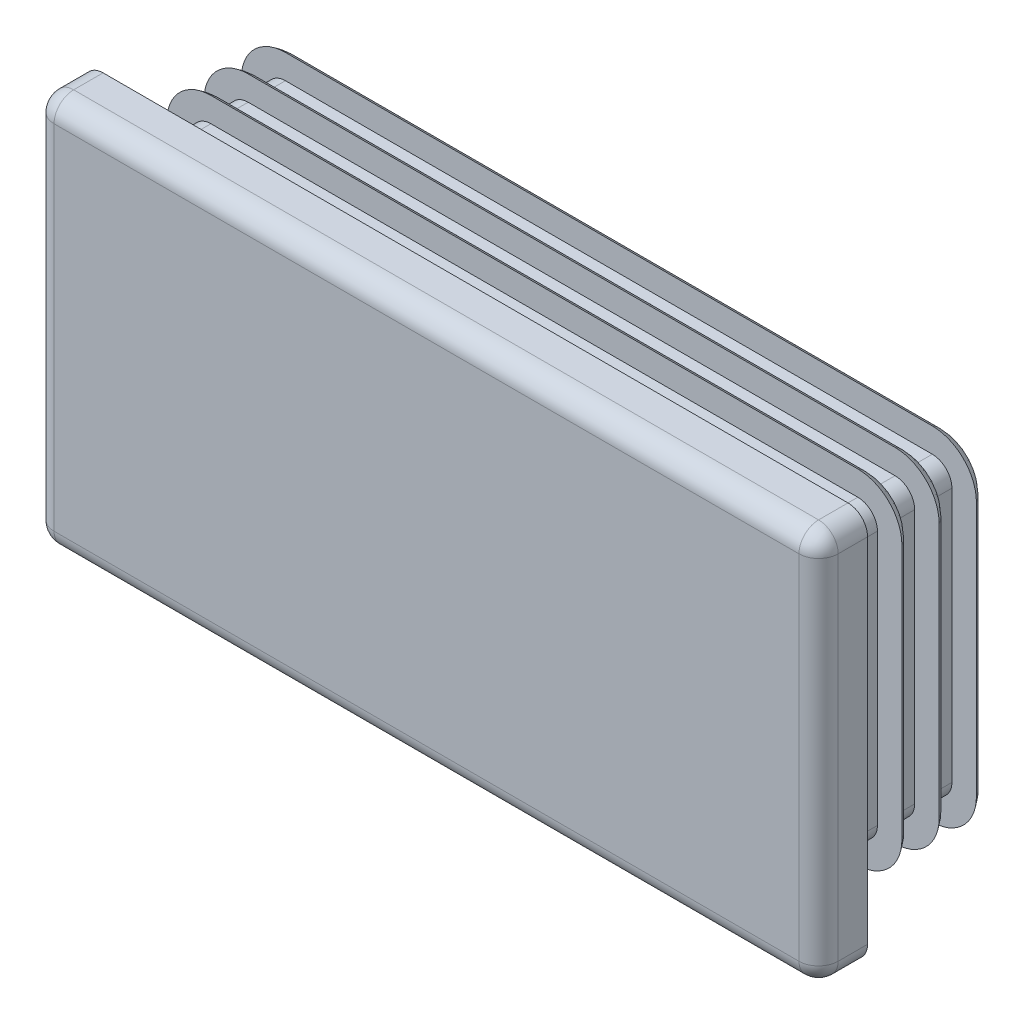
ISO-10303-21;
HEADER;
FILE_DESCRIPTION(('STEP AP214'),'2;1');
FILE_NAME('part.step','',(''),(''),'','','');
FILE_SCHEMA(('AUTOMOTIVE_DESIGN { 1 0 10303 214 1 1 1 1 }'));
ENDSEC;
DATA;
#1=APPLICATION_CONTEXT('core data for automotive mechanical design processes');
#2=APPLICATION_PROTOCOL_DEFINITION('international standard','automotive_design',2000,#1);
#3=PRODUCT_CONTEXT('',#1,'mechanical');
#4=PRODUCT('Part','Part','',(#3));
#5=PRODUCT_RELATED_PRODUCT_CATEGORY('part','',(#4));
#6=PRODUCT_DEFINITION_FORMATION('','',#4);
#7=PRODUCT_DEFINITION_CONTEXT('part definition',#1,'design');
#8=PRODUCT_DEFINITION('design','',#6,#7);
#9=PRODUCT_DEFINITION_SHAPE('','',#8);
#10=(LENGTH_UNIT() NAMED_UNIT(*) SI_UNIT(.MILLI.,.METRE.));
#11=(NAMED_UNIT(*) PLANE_ANGLE_UNIT() SI_UNIT($,.RADIAN.));
#12=(NAMED_UNIT(*) SI_UNIT($,.STERADIAN.) SOLID_ANGLE_UNIT());
#13=UNCERTAINTY_MEASURE_WITH_UNIT(LENGTH_MEASURE(1.E-05),#10,'distance_accuracy_value','');
#14=(GEOMETRIC_REPRESENTATION_CONTEXT(3) GLOBAL_UNCERTAINTY_ASSIGNED_CONTEXT((#13)) GLOBAL_UNIT_ASSIGNED_CONTEXT((#10,
#11,#12)) REPRESENTATION_CONTEXT('',''));
#15=CARTESIAN_POINT('',(0.,0.,0.));
#16=DIRECTION('',(0.,0.,1.));
#17=DIRECTION('',(1.,0.,0.));
#18=AXIS2_PLACEMENT_3D('',#15,#16,#17);
#19=CARTESIAN_POINT('',(-207.431578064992,2.00000000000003,3.));
#20=DIRECTION('',(0.,0.,1.));
#21=DIRECTION('',(1.,0.,0.));
#22=AXIS2_PLACEMENT_3D('',#19,#20,#21);
#23=PLANE('',#22);
#24=DIRECTION('',(0.,1.,0.));
#25=VECTOR('',#24,1.);
#26=CARTESIAN_POINT('',(-131.431578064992,2.00000000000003,3.));
#27=LINE('',#26,#25);
#28=CARTESIAN_POINT('',(-131.431578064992,2.00000000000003,3.));
#29=VERTEX_POINT('',#28);
#30=CARTESIAN_POINT('',(-131.431578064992,38.,3.));
#31=VERTEX_POINT('',#30);
#32=EDGE_CURVE('E581',#29,#31,#27,.T.);
#33=ORIENTED_EDGE('',*,*,#32,.F.);
#34=DIRECTION('',(1.,0.,0.));
#35=VECTOR('',#34,1.);
#36=CARTESIAN_POINT('',(-207.431578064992,2.00000000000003,3.));
#37=LINE('',#36,#35);
#38=CARTESIAN_POINT('',(-207.431578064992,2.00000000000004,3.));
#39=VERTEX_POINT('',#38);
#40=EDGE_CURVE('E586',#39,#29,#37,.T.);
#41=ORIENTED_EDGE('',*,*,#40,.F.);
#42=DIRECTION('',(0.,1.,0.));
#43=VECTOR('',#42,1.);
#44=CARTESIAN_POINT('',(-207.431578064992,38.,3.));
#45=LINE('',#44,#43);
#46=CARTESIAN_POINT('',(-207.431578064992,38.,3.));
#47=VERTEX_POINT('',#46);
#48=EDGE_CURVE('E567',#47,#39,#45,.F.);
#49=ORIENTED_EDGE('',*,*,#48,.F.);
#50=DIRECTION('',(1.,0.,0.));
#51=VECTOR('',#50,1.);
#52=CARTESIAN_POINT('',(-131.431578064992,38.,3.));
#53=LINE('',#52,#51);
#54=EDGE_CURVE('E576',#31,#47,#53,.F.);
#55=ORIENTED_EDGE('',*,*,#54,.F.);
#56=EDGE_LOOP('',(#33,#41,#49,#55));
#57=FACE_BOUND('',#56,.T.);
#58=ADVANCED_FACE('F17',(#57),#23,.F.);
#59=CARTESIAN_POINT('',(-207.431578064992,2.00000000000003,5.));
#60=DIRECTION('',(0.,1.,0.));
#61=DIRECTION('',(0.,0.,1.));
#62=AXIS2_PLACEMENT_3D('',#59,#60,#61);
#63=PLANE('',#62);
#64=DIRECTION('',(0.,0.,-1.));
#65=VECTOR('',#64,1.);
#66=CARTESIAN_POINT('',(-207.431578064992,2.00000000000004,5.));
#67=LINE('',#66,#65);
#68=CARTESIAN_POINT('',(-207.431578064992,2.00000000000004,2.));
#69=VERTEX_POINT('',#68);
#70=EDGE_CURVE('E573',#39,#69,#67,.T.);
#71=ORIENTED_EDGE('',*,*,#70,.F.);
#72=ORIENTED_EDGE('',*,*,#40,.T.);
#73=DIRECTION('',(0.,0.,1.));
#74=VECTOR('',#73,1.);
#75=CARTESIAN_POINT('',(-131.431578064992,2.00000000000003,5.));
#76=LINE('',#75,#74);
#77=CARTESIAN_POINT('',(-131.431578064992,2.00000000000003,2.));
#78=VERTEX_POINT('',#77);
#79=EDGE_CURVE('E583',#78,#29,#76,.T.);
#80=ORIENTED_EDGE('',*,*,#79,.F.);
#81=DIRECTION('',(1.,0.,0.));
#82=VECTOR('',#81,1.);
#83=CARTESIAN_POINT('',(-207.431578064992,2.00000000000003,2.));
#84=LINE('',#83,#82);
#85=EDGE_CURVE('E564',#69,#78,#84,.T.);
#86=ORIENTED_EDGE('',*,*,#85,.F.);
#87=EDGE_LOOP('',(#71,#72,#80,#86));
#88=FACE_BOUND('',#87,.T.);
#89=ADVANCED_FACE('F941',(#88),#63,.T.);
#90=CARTESIAN_POINT('',(-131.431578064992,2.00000000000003,5.));
#91=DIRECTION('',(-1.,0.,0.));
#92=DIRECTION('',(0.,0.,1.));
#93=AXIS2_PLACEMENT_3D('',#90,#91,#92);
#94=PLANE('',#93);
#95=ORIENTED_EDGE('',*,*,#79,.T.);
#96=ORIENTED_EDGE('',*,*,#32,.T.);
#97=DIRECTION('',(0.,0.,-1.));
#98=VECTOR('',#97,1.);
#99=CARTESIAN_POINT('',(-131.431578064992,38.,5.));
#100=LINE('',#99,#98);
#101=CARTESIAN_POINT('',(-131.431578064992,38.,2.));
#102=VERTEX_POINT('',#101);
#103=EDGE_CURVE('E578',#102,#31,#100,.F.);
#104=ORIENTED_EDGE('',*,*,#103,.F.);
#105=DIRECTION('',(0.,1.,0.));
#106=VECTOR('',#105,1.);
#107=CARTESIAN_POINT('',(-131.431578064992,2.00000000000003,2.));
#108=LINE('',#107,#106);
#109=EDGE_CURVE('E561',#78,#102,#108,.T.);
#110=ORIENTED_EDGE('',*,*,#109,.F.);
#111=EDGE_LOOP('',(#95,#96,#104,#110));
#112=FACE_BOUND('',#111,.T.);
#113=ADVANCED_FACE('F938',(#112),#94,.T.);
#114=CARTESIAN_POINT('',(-131.431578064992,38.,5.));
#115=DIRECTION('',(0.,-1.,0.));
#116=DIRECTION('',(0.,0.,-1.));
#117=AXIS2_PLACEMENT_3D('',#114,#115,#116);
#118=PLANE('',#117);
#119=ORIENTED_EDGE('',*,*,#103,.T.);
#120=ORIENTED_EDGE('',*,*,#54,.T.);
#121=DIRECTION('',(0.,0.,-1.));
#122=VECTOR('',#121,1.);
#123=CARTESIAN_POINT('',(-207.431578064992,38.,5.));
#124=LINE('',#123,#122);
#125=CARTESIAN_POINT('',(-207.431578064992,38.,2.));
#126=VERTEX_POINT('',#125);
#127=EDGE_CURVE('E570',#126,#47,#124,.F.);
#128=ORIENTED_EDGE('',*,*,#127,.F.);
#129=DIRECTION('',(1.,0.,0.));
#130=VECTOR('',#129,1.);
#131=CARTESIAN_POINT('',(-207.431578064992,38.,2.));
#132=LINE('',#131,#130);
#133=EDGE_CURVE('E558',#102,#126,#132,.F.);
#134=ORIENTED_EDGE('',*,*,#133,.F.);
#135=EDGE_LOOP('',(#119,#120,#128,#134));
#136=FACE_BOUND('',#135,.T.);
#137=ADVANCED_FACE('F934',(#136),#118,.T.);
#138=CARTESIAN_POINT('',(-207.431578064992,38.,5.));
#139=DIRECTION('',(1.,0.,0.));
#140=DIRECTION('',(0.,0.,-1.));
#141=AXIS2_PLACEMENT_3D('',#138,#139,#140);
#142=PLANE('',#141);
#143=ORIENTED_EDGE('',*,*,#127,.T.);
#144=ORIENTED_EDGE('',*,*,#48,.T.);
#145=ORIENTED_EDGE('',*,*,#70,.T.);
#146=DIRECTION('',(0.,1.,0.));
#147=VECTOR('',#146,1.);
#148=CARTESIAN_POINT('',(-207.431578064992,2.00000000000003,2.));
#149=LINE('',#148,#147);
#150=EDGE_CURVE('E555',#126,#69,#149,.F.);
#151=ORIENTED_EDGE('',*,*,#150,.F.);
#152=EDGE_LOOP('',(#143,#144,#145,#151));
#153=FACE_BOUND('',#152,.T.);
#154=ADVANCED_FACE('F930',(#153),#142,.T.);
#155=CARTESIAN_POINT('',(-207.431578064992,2.00000000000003,2.));
#156=DIRECTION('',(0.,0.,1.));
#157=DIRECTION('',(1.,0.,0.));
#158=AXIS2_PLACEMENT_3D('',#155,#156,#157);
#159=PLANE('',#158);
#160=DIRECTION('',(1.,0.,0.));
#161=VECTOR('',#160,1.);
#162=CARTESIAN_POINT('',(-204.431578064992,33.,2.));
#163=LINE('',#162,#161);
#164=CARTESIAN_POINT('',(-136.431578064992,33.,2.));
#165=VERTEX_POINT('',#164);
#166=CARTESIAN_POINT('',(-202.431578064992,33.,2.));
#167=VERTEX_POINT('',#166);
#168=EDGE_CURVE('E535',#165,#167,#163,.F.);
#169=ORIENTED_EDGE('',*,*,#168,.F.);
#170=DIRECTION('',(0.,1.,0.));
#171=VECTOR('',#170,1.);
#172=CARTESIAN_POINT('',(-136.431578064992,35.,2.));
#173=LINE('',#172,#171);
#174=CARTESIAN_POINT('',(-136.431578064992,7.00000000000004,2.));
#175=VERTEX_POINT('',#174);
#176=EDGE_CURVE('E544',#175,#165,#173,.T.);
#177=ORIENTED_EDGE('',*,*,#176,.F.);
#178=DIRECTION('',(-1.,0.,0.));
#179=VECTOR('',#178,1.);
#180=CARTESIAN_POINT('',(-134.431578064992,7.00000000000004,2.));
#181=LINE('',#180,#179);
#182=CARTESIAN_POINT('',(-202.431578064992,7.00000000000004,2.));
#183=VERTEX_POINT('',#182);
#184=EDGE_CURVE('E549',#183,#175,#181,.F.);
#185=ORIENTED_EDGE('',*,*,#184,.F.);
#186=DIRECTION('',(0.,1.,0.));
#187=VECTOR('',#186,1.);
#188=CARTESIAN_POINT('',(-202.431578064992,5.00000000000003,2.));
#189=LINE('',#188,#187);
#190=EDGE_CURVE('E552',#167,#183,#189,.F.);
#191=ORIENTED_EDGE('',*,*,#190,.F.);
#192=EDGE_LOOP('',(#169,#177,#185,#191));
#193=FACE_BOUND('',#192,.T.);
#194=ORIENTED_EDGE('',*,*,#133,.T.);
#195=ORIENTED_EDGE('',*,*,#150,.T.);
#196=ORIENTED_EDGE('',*,*,#85,.T.);
#197=ORIENTED_EDGE('',*,*,#109,.T.);
#198=EDGE_LOOP('',(#194,#195,#196,#197));
#199=FACE_BOUND('',#198,.T.);
#200=ADVANCED_FACE('F926',(#193,#199),#159,.T.);
#201=CARTESIAN_POINT('',(-202.431578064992,5.00000000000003,-15.));
#202=DIRECTION('',(1.,0.,0.));
#203=DIRECTION('',(0.,0.,-1.));
#204=AXIS2_PLACEMENT_3D('',#201,#202,#203);
#205=PLANE('',#204);
#206=DIRECTION('',(0.,1.,0.));
#207=VECTOR('',#206,1.);
#208=CARTESIAN_POINT('',(-202.431578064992,5.00000000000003,-15.));
#209=LINE('',#208,#207);
#210=CARTESIAN_POINT('',(-202.431578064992,33.,-15.));
#211=VERTEX_POINT('',#210);
#212=CARTESIAN_POINT('',(-202.431578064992,7.00000000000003,-15.));
#213=VERTEX_POINT('',#212);
#214=EDGE_CURVE('E518',#211,#213,#209,.F.);
#215=ORIENTED_EDGE('',*,*,#214,.F.);
#216=DIRECTION('',(0.,0.,-1.));
#217=VECTOR('',#216,1.);
#218=CARTESIAN_POINT('',(-202.431578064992,33.,-15.));
#219=LINE('',#218,#217);
#220=EDGE_CURVE('E520',#167,#211,#219,.T.);
#221=ORIENTED_EDGE('',*,*,#220,.F.);
#222=ORIENTED_EDGE('',*,*,#190,.T.);
#223=DIRECTION('',(0.,0.,1.));
#224=VECTOR('',#223,1.);
#225=CARTESIAN_POINT('',(-202.431578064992,7.00000000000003,-15.));
#226=LINE('',#225,#224);
#227=EDGE_CURVE('E546',#213,#183,#226,.T.);
#228=ORIENTED_EDGE('',*,*,#227,.F.);
#229=EDGE_LOOP('',(#215,#221,#222,#228));
#230=FACE_BOUND('',#229,.T.);
#231=ADVANCED_FACE('F922',(#230),#205,.T.);
#232=CARTESIAN_POINT('',(-134.431578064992,7.00000000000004,-15.));
#233=DIRECTION('',(0.,1.,0.));
#234=DIRECTION('',(-1.,0.,0.));
#235=AXIS2_PLACEMENT_3D('',#232,#233,#234);
#236=PLANE('',#235);
#237=DIRECTION('',(-1.,0.,0.));
#238=VECTOR('',#237,1.);
#239=CARTESIAN_POINT('',(-204.431578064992,7.00000000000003,-15.));
#240=LINE('',#239,#238);
#241=CARTESIAN_POINT('',(-136.431578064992,7.00000000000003,-15.));
#242=VERTEX_POINT('',#241);
#243=EDGE_CURVE('E515',#213,#242,#240,.F.);
#244=ORIENTED_EDGE('',*,*,#243,.F.);
#245=ORIENTED_EDGE('',*,*,#227,.T.);
#246=ORIENTED_EDGE('',*,*,#184,.T.);
#247=DIRECTION('',(0.,0.,1.));
#248=VECTOR('',#247,1.);
#249=CARTESIAN_POINT('',(-136.431578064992,7.00000000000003,-15.));
#250=LINE('',#249,#248);
#251=EDGE_CURVE('E541',#242,#175,#250,.T.);
#252=ORIENTED_EDGE('',*,*,#251,.F.);
#253=EDGE_LOOP('',(#244,#245,#246,#252));
#254=FACE_BOUND('',#253,.T.);
#255=ADVANCED_FACE('F918',(#254),#236,.T.);
#256=CARTESIAN_POINT('',(-136.431578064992,35.,-15.));
#257=DIRECTION('',(-1.,0.,0.));
#258=DIRECTION('',(0.,0.,1.));
#259=AXIS2_PLACEMENT_3D('',#256,#257,#258);
#260=PLANE('',#259);
#261=DIRECTION('',(0.,1.,0.));
#262=VECTOR('',#261,1.);
#263=CARTESIAN_POINT('',(-136.431578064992,5.00000000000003,-15.));
#264=LINE('',#263,#262);
#265=CARTESIAN_POINT('',(-136.431578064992,33.,-15.));
#266=VERTEX_POINT('',#265);
#267=EDGE_CURVE('E512',#242,#266,#264,.T.);
#268=ORIENTED_EDGE('',*,*,#267,.F.);
#269=ORIENTED_EDGE('',*,*,#251,.T.);
#270=ORIENTED_EDGE('',*,*,#176,.T.);
#271=DIRECTION('',(0.,0.,-1.));
#272=VECTOR('',#271,1.);
#273=CARTESIAN_POINT('',(-136.431578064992,33.,-15.));
#274=LINE('',#273,#272);
#275=EDGE_CURVE('E538',#266,#165,#274,.F.);
#276=ORIENTED_EDGE('',*,*,#275,.F.);
#277=EDGE_LOOP('',(#268,#269,#270,#276));
#278=FACE_BOUND('',#277,.T.);
#279=ADVANCED_FACE('F914',(#278),#260,.T.);
#280=CARTESIAN_POINT('',(-204.431578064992,33.,-15.));
#281=DIRECTION('',(0.,-1.,0.));
#282=DIRECTION('',(0.,0.,-1.));
#283=AXIS2_PLACEMENT_3D('',#280,#281,#282);
#284=PLANE('',#283);
#285=ORIENTED_EDGE('',*,*,#168,.T.);
#286=ORIENTED_EDGE('',*,*,#220,.T.);
#287=DIRECTION('',(-1.,0.,0.));
#288=VECTOR('',#287,1.);
#289=CARTESIAN_POINT('',(-204.431578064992,33.,-15.));
#290=LINE('',#289,#288);
#291=EDGE_CURVE('E489',#266,#211,#290,.T.);
#292=ORIENTED_EDGE('',*,*,#291,.F.);
#293=ORIENTED_EDGE('',*,*,#275,.T.);
#294=EDGE_LOOP('',(#285,#286,#292,#293));
#295=FACE_BOUND('',#294,.T.);
#296=ADVANCED_FACE('F911',(#295),#284,.T.);
#297=CARTESIAN_POINT('',(-204.431578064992,5.00000000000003,-15.));
#298=DIRECTION('',(0.,0.,-1.));
#299=DIRECTION('',(-1.,0.,0.));
#300=AXIS2_PLACEMENT_3D('',#297,#298,#299);
#301=PLANE('',#300);
#302=DIRECTION('',(1.,0.,0.));
#303=VECTOR('',#302,1.);
#304=CARTESIAN_POINT('',(-202.431578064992,5.00000000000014,-15.));
#305=LINE('',#304,#303);
#306=CARTESIAN_POINT('',(-136.431578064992,5.00000000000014,-15.));
#307=VERTEX_POINT('',#306);
#308=CARTESIAN_POINT('',(-202.431578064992,5.00000000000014,-15.));
#309=VERTEX_POINT('',#308);
#310=EDGE_CURVE('E527',#307,#309,#305,.F.);
#311=ORIENTED_EDGE('',*,*,#310,.T.);
#312=CARTESIAN_POINT('',(-202.431578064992,7.00000000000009,-15.));
#313=DIRECTION('',(0.,0.,1.));
#314=DIRECTION('',(1.,0.,0.));
#315=AXIS2_PLACEMENT_3D('',#312,#313,#314);
#316=CIRCLE('',#315,1.99999999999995);
#317=CARTESIAN_POINT('',(-204.431578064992,7.00000000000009,-15.));
#318=VERTEX_POINT('',#317);
#319=EDGE_CURVE('E773',#309,#318,#316,.F.);
#320=ORIENTED_EDGE('',*,*,#319,.T.);
#321=DIRECTION('',(0.,1.,0.));
#322=VECTOR('',#321,1.);
#323=CARTESIAN_POINT('',(-204.431578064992,33.0000000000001,-15.));
#324=LINE('',#323,#322);
#325=CARTESIAN_POINT('',(-204.431578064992,33.0000000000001,-15.));
#326=VERTEX_POINT('',#325);
#327=EDGE_CURVE('E495',#318,#326,#324,.T.);
#328=ORIENTED_EDGE('',*,*,#327,.T.);
#329=CARTESIAN_POINT('',(-202.431578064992,33.0000000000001,-15.));
#330=DIRECTION('',(0.,0.,1.));
#331=DIRECTION('',(1.,0.,0.));
#332=AXIS2_PLACEMENT_3D('',#329,#330,#331);
#333=CIRCLE('',#332,1.99999999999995);
#334=CARTESIAN_POINT('',(-202.431578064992,35.,-15.));
#335=VERTEX_POINT('',#334);
#336=EDGE_CURVE('E20',#326,#335,#333,.F.);
#337=ORIENTED_EDGE('',*,*,#336,.T.);
#338=DIRECTION('',(1.,0.,0.));
#339=VECTOR('',#338,1.);
#340=CARTESIAN_POINT('',(-202.431578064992,35.,-15.));
#341=LINE('',#340,#339);
#342=CARTESIAN_POINT('',(-136.431578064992,35.,-15.));
#343=VERTEX_POINT('',#342);
#344=EDGE_CURVE('E480',#343,#335,#341,.F.);
#345=ORIENTED_EDGE('',*,*,#344,.F.);
#346=CARTESIAN_POINT('',(-136.431578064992,33.0000000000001,-15.));
#347=DIRECTION('',(0.,0.,1.));
#348=DIRECTION('',(1.,0.,0.));
#349=AXIS2_PLACEMENT_3D('',#346,#347,#348);
#350=CIRCLE('',#349,1.99999999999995);
#351=CARTESIAN_POINT('',(-134.431578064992,33.0000000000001,-15.));
#352=VERTEX_POINT('',#351);
#353=EDGE_CURVE('E768',#343,#352,#350,.F.);
#354=ORIENTED_EDGE('',*,*,#353,.T.);
#355=DIRECTION('',(0.,1.,0.));
#356=VECTOR('',#355,1.);
#357=CARTESIAN_POINT('',(-134.431578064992,7.00000000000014,-15.));
#358=LINE('',#357,#356);
#359=CARTESIAN_POINT('',(-134.431578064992,7.00000000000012,-15.));
#360=VERTEX_POINT('',#359);
#361=EDGE_CURVE('E522',#352,#360,#358,.F.);
#362=ORIENTED_EDGE('',*,*,#361,.T.);
#363=CARTESIAN_POINT('',(-136.431578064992,7.00000000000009,-15.));
#364=DIRECTION('',(0.,0.,1.));
#365=DIRECTION('',(1.,0.,0.));
#366=AXIS2_PLACEMENT_3D('',#363,#364,#365);
#367=CIRCLE('',#366,1.99999999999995);
#368=EDGE_CURVE('E771',#360,#307,#367,.F.);
#369=ORIENTED_EDGE('',*,*,#368,.T.);
#370=EDGE_LOOP('',(#311,#320,#328,#337,#345,#354,#362,#369));
#371=FACE_BOUND('',#370,.T.);
#372=ORIENTED_EDGE('',*,*,#267,.T.);
#373=ORIENTED_EDGE('',*,*,#291,.T.);
#374=ORIENTED_EDGE('',*,*,#214,.T.);
#375=ORIENTED_EDGE('',*,*,#243,.T.);
#376=EDGE_LOOP('',(#372,#373,#374,#375));
#377=FACE_BOUND('',#376,.T.);
#378=ADVANCED_FACE('F492',(#371,#377),#301,.T.);
#379=CARTESIAN_POINT('',(-202.431578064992,35.,-15.1835471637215));
#380=DIRECTION('',(0.,-1.,0.));
#381=DIRECTION('',(0.,0.,-1.));
#382=AXIS2_PLACEMENT_3D('',#379,#380,#381);
#383=PLANE('',#382);
#384=DIRECTION('',(0.,0.,1.));
#385=VECTOR('',#384,1.);
#386=CARTESIAN_POINT('',(-202.431578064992,35.,-13.6));
#387=LINE('',#386,#385);
#388=CARTESIAN_POINT('',(-202.431578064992,35.,-15.1835471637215));
#389=VERTEX_POINT('',#388);
#390=EDGE_CURVE('E482',#335,#389,#387,.F.);
#391=ORIENTED_EDGE('',*,*,#390,.T.);
#392=DIRECTION('',(1.,0.,0.));
#393=VECTOR('',#392,1.);
#394=CARTESIAN_POINT('',(-202.431578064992,35.,-15.1835471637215));
#395=LINE('',#394,#393);
#396=CARTESIAN_POINT('',(-136.431578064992,35.,-15.1835471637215));
#397=VERTEX_POINT('',#396);
#398=EDGE_CURVE('E770',#397,#389,#395,.F.);
#399=ORIENTED_EDGE('',*,*,#398,.F.);
#400=DIRECTION('',(0.,0.,1.));
#401=VECTOR('',#400,1.);
#402=CARTESIAN_POINT('',(-136.431578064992,35.,-13.6));
#403=LINE('',#402,#401);
#404=EDGE_CURVE('E485',#397,#343,#403,.T.);
#405=ORIENTED_EDGE('',*,*,#404,.T.);
#406=ORIENTED_EDGE('',*,*,#344,.T.);
#407=EDGE_LOOP('',(#391,#399,#405,#406));
#408=FACE_BOUND('',#407,.T.);
#409=ADVANCED_FACE('F481',(#408),#383,.T.);
#410=CARTESIAN_POINT('',(-202.431578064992,33.0000000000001,-13.6));
#411=DIRECTION('',(0.,0.,1.));
#412=DIRECTION('',(1.,0.,0.));
#413=AXIS2_PLACEMENT_3D('',#410,#411,#412);
#414=CYLINDRICAL_SURFACE('',#413,1.99999999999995);
#415=DIRECTION('',(0.,0.,1.));
#416=VECTOR('',#415,1.);
#417=CARTESIAN_POINT('',(-204.431578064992,33.0000000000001,-15.1835471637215));
#418=LINE('',#417,#416);
#419=CARTESIAN_POINT('',(-204.431578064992,33.0000000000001,-15.1835471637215));
#420=VERTEX_POINT('',#419);
#421=EDGE_CURVE('E497',#326,#420,#418,.F.);
#422=ORIENTED_EDGE('',*,*,#421,.T.);
#423=CARTESIAN_POINT('',(-202.431578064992,33.0000000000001,-15.1835471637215));
#424=DIRECTION('',(0.,0.,1.));
#425=DIRECTION('',(1.,0.,0.));
#426=AXIS2_PLACEMENT_3D('',#423,#424,#425);
#427=CIRCLE('',#426,1.99999999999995);
#428=EDGE_CURVE('E501',#389,#420,#427,.T.);
#429=ORIENTED_EDGE('',*,*,#428,.F.);
#430=ORIENTED_EDGE('',*,*,#390,.F.);
#431=ORIENTED_EDGE('',*,*,#336,.F.);
#432=EDGE_LOOP('',(#422,#429,#430,#431));
#433=FACE_BOUND('',#432,.T.);
#434=ADVANCED_FACE('F499',(#433),#414,.F.);
#435=CARTESIAN_POINT('',(-204.431578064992,33.0000000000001,-15.1835471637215));
#436=DIRECTION('',(-1.,0.,0.));
#437=DIRECTION('',(0.,0.,1.));
#438=AXIS2_PLACEMENT_3D('',#435,#436,#437);
#439=PLANE('',#438);
#440=DIRECTION('',(0.,0.,1.));
#441=VECTOR('',#440,1.);
#442=CARTESIAN_POINT('',(-204.431578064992,7.00000000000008,-13.6));
#443=LINE('',#442,#441);
#444=CARTESIAN_POINT('',(-204.431578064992,7.00000000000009,-15.1835471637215));
#445=VERTEX_POINT('',#444);
#446=EDGE_CURVE('E532',#318,#445,#443,.F.);
#447=ORIENTED_EDGE('',*,*,#446,.T.);
#448=DIRECTION('',(0.,-1.,0.));
#449=VECTOR('',#448,1.);
#450=CARTESIAN_POINT('',(-204.431578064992,33.0000000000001,-15.1835471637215));
#451=LINE('',#450,#449);
#452=EDGE_CURVE('E786',#420,#445,#451,.T.);
#453=ORIENTED_EDGE('',*,*,#452,.F.);
#454=ORIENTED_EDGE('',*,*,#421,.F.);
#455=ORIENTED_EDGE('',*,*,#327,.F.);
#456=EDGE_LOOP('',(#447,#453,#454,#455));
#457=FACE_BOUND('',#456,.T.);
#458=ADVANCED_FACE('F901',(#457),#439,.F.);
#459=CARTESIAN_POINT('',(-202.431578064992,7.00000000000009,-13.6));
#460=DIRECTION('',(0.,0.,1.));
#461=DIRECTION('',(1.,0.,0.));
#462=AXIS2_PLACEMENT_3D('',#459,#460,#461);
#463=CYLINDRICAL_SURFACE('',#462,1.99999999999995);
#464=DIRECTION('',(0.,0.,1.));
#465=VECTOR('',#464,1.);
#466=CARTESIAN_POINT('',(-202.431578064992,5.00000000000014,-15.1835471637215));
#467=LINE('',#466,#465);
#468=CARTESIAN_POINT('',(-202.431578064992,5.00000000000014,-15.1835471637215));
#469=VERTEX_POINT('',#468);
#470=EDGE_CURVE('E530',#309,#469,#467,.F.);
#471=ORIENTED_EDGE('',*,*,#470,.T.);
#472=CARTESIAN_POINT('',(-202.431578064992,7.00000000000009,-15.1835471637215));
#473=DIRECTION('',(0.,0.,1.));
#474=DIRECTION('',(1.,0.,0.));
#475=AXIS2_PLACEMENT_3D('',#472,#473,#474);
#476=CIRCLE('',#475,1.99999999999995);
#477=EDGE_CURVE('E847',#445,#469,#476,.T.);
#478=ORIENTED_EDGE('',*,*,#477,.F.);
#479=ORIENTED_EDGE('',*,*,#446,.F.);
#480=ORIENTED_EDGE('',*,*,#319,.F.);
#481=EDGE_LOOP('',(#471,#478,#479,#480));
#482=FACE_BOUND('',#481,.T.);
#483=ADVANCED_FACE('F897',(#482),#463,.F.);
#484=CARTESIAN_POINT('',(-202.431578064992,5.00000000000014,-15.1835471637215));
#485=DIRECTION('',(0.,-1.,0.));
#486=DIRECTION('',(1.,0.,0.));
#487=AXIS2_PLACEMENT_3D('',#484,#485,#486);
#488=PLANE('',#487);
#489=DIRECTION('',(0.,0.,1.));
#490=VECTOR('',#489,1.);
#491=CARTESIAN_POINT('',(-136.431578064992,5.00000000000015,-13.6));
#492=LINE('',#491,#490);
#493=CARTESIAN_POINT('',(-136.431578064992,5.00000000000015,-15.1835471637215));
#494=VERTEX_POINT('',#493);
#495=EDGE_CURVE('E529',#307,#494,#492,.F.);
#496=ORIENTED_EDGE('',*,*,#495,.T.);
#497=DIRECTION('',(1.,0.,0.));
#498=VECTOR('',#497,1.);
#499=CARTESIAN_POINT('',(-202.431578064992,5.00000000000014,-15.1835471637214));
#500=LINE('',#499,#498);
#501=EDGE_CURVE('E840',#469,#494,#500,.T.);
#502=ORIENTED_EDGE('',*,*,#501,.F.);
#503=ORIENTED_EDGE('',*,*,#470,.F.);
#504=ORIENTED_EDGE('',*,*,#310,.F.);
#505=EDGE_LOOP('',(#496,#502,#503,#504));
#506=FACE_BOUND('',#505,.T.);
#507=ADVANCED_FACE('F893',(#506),#488,.F.);
#508=CARTESIAN_POINT('',(-136.431578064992,7.00000000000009,-13.6));
#509=DIRECTION('',(0.,0.,1.));
#510=DIRECTION('',(1.,0.,0.));
#511=AXIS2_PLACEMENT_3D('',#508,#509,#510);
#512=CYLINDRICAL_SURFACE('',#511,1.99999999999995);
#513=DIRECTION('',(0.,0.,-1.));
#514=VECTOR('',#513,1.);
#515=CARTESIAN_POINT('',(-134.431578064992,7.00000000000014,-15.1835471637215));
#516=LINE('',#515,#514);
#517=CARTESIAN_POINT('',(-134.431578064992,7.00000000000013,-15.1835471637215));
#518=VERTEX_POINT('',#517);
#519=EDGE_CURVE('E526',#360,#518,#516,.T.);
#520=ORIENTED_EDGE('',*,*,#519,.T.);
#521=CARTESIAN_POINT('',(-136.431578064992,7.00000000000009,-15.1835471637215));
#522=DIRECTION('',(0.,0.,1.));
#523=DIRECTION('',(1.,0.,0.));
#524=AXIS2_PLACEMENT_3D('',#521,#522,#523);
#525=CIRCLE('',#524,1.99999999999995);
#526=EDGE_CURVE('E831',#494,#518,#525,.T.);
#527=ORIENTED_EDGE('',*,*,#526,.F.);
#528=ORIENTED_EDGE('',*,*,#495,.F.);
#529=ORIENTED_EDGE('',*,*,#368,.F.);
#530=EDGE_LOOP('',(#520,#527,#528,#529));
#531=FACE_BOUND('',#530,.T.);
#532=ADVANCED_FACE('F889',(#531),#512,.F.);
#533=CARTESIAN_POINT('',(-134.431578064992,7.00000000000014,-15.1835471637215));
#534=DIRECTION('',(1.,0.,0.));
#535=DIRECTION('',(0.,0.,-1.));
#536=AXIS2_PLACEMENT_3D('',#533,#534,#535);
#537=PLANE('',#536);
#538=DIRECTION('',(0.,0.,1.));
#539=VECTOR('',#538,1.);
#540=CARTESIAN_POINT('',(-134.431578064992,33.0000000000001,-13.6));
#541=LINE('',#540,#539);
#542=CARTESIAN_POINT('',(-134.431578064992,33.0000000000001,-15.1835471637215));
#543=VERTEX_POINT('',#542);
#544=EDGE_CURVE('E525',#352,#543,#541,.F.);
#545=ORIENTED_EDGE('',*,*,#544,.T.);
#546=DIRECTION('',(0.,1.,0.));
#547=VECTOR('',#546,1.);
#548=CARTESIAN_POINT('',(-134.431578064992,7.00000000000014,-15.1835471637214));
#549=LINE('',#548,#547);
#550=EDGE_CURVE('E822',#518,#543,#549,.T.);
#551=ORIENTED_EDGE('',*,*,#550,.F.);
#552=ORIENTED_EDGE('',*,*,#519,.F.);
#553=ORIENTED_EDGE('',*,*,#361,.F.);
#554=EDGE_LOOP('',(#545,#551,#552,#553));
#555=FACE_BOUND('',#554,.T.);
#556=ADVANCED_FACE('F885',(#555),#537,.F.);
#557=CARTESIAN_POINT('',(-136.431578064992,33.0000000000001,-13.6));
#558=DIRECTION('',(0.,0.,1.));
#559=DIRECTION('',(1.,0.,0.));
#560=AXIS2_PLACEMENT_3D('',#557,#558,#559);
#561=CYLINDRICAL_SURFACE('',#560,1.99999999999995);
#562=ORIENTED_EDGE('',*,*,#404,.F.);
#563=CARTESIAN_POINT('',(-136.431578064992,33.0000000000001,-15.1835471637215));
#564=DIRECTION('',(0.,0.,1.));
#565=DIRECTION('',(1.,0.,0.));
#566=AXIS2_PLACEMENT_3D('',#563,#564,#565);
#567=CIRCLE('',#566,1.99999999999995);
#568=EDGE_CURVE('E809',#543,#397,#567,.T.);
#569=ORIENTED_EDGE('',*,*,#568,.F.);
#570=ORIENTED_EDGE('',*,*,#544,.F.);
#571=ORIENTED_EDGE('',*,*,#353,.F.);
#572=EDGE_LOOP('',(#562,#569,#570,#571));
#573=FACE_BOUND('',#572,.T.);
#574=ADVANCED_FACE('F881',(#573),#561,.F.);
#575=CARTESIAN_POINT('',(-202.431578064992,34.8094134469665,-12.1136479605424));
#576=DIRECTION('',(1.,0.,0.));
#577=DIRECTION('',(0.,0.,-1.));
#578=AXIS2_PLACEMENT_3D('',#575,#576,#577);
#579=CYLINDRICAL_SURFACE('',#578,3.07580954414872);
#580=ORIENTED_EDGE('',*,*,#398,.T.);
#581=CARTESIAN_POINT('',(-202.431578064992,34.8094134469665,-12.1136479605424));
#582=DIRECTION('',(-1.,0.,0.));
#583=DIRECTION('',(0.,1.,0.));
#584=AXIS2_PLACEMENT_3D('',#581,#582,#583);
#585=CIRCLE('',#584,3.07580954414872);
#586=CARTESIAN_POINT('',(-202.431578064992,37.5,-13.6040668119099));
#587=VERTEX_POINT('',#586);
#588=EDGE_CURVE('E794',#587,#389,#585,.T.);
#589=ORIENTED_EDGE('',*,*,#588,.F.);
#590=DIRECTION('',(1.,0.,0.));
#591=VECTOR('',#590,1.);
#592=CARTESIAN_POINT('',(-202.431578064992,37.5,-13.6040668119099));
#593=LINE('',#592,#591);
#594=CARTESIAN_POINT('',(-136.431578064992,37.5,-13.6040668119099));
#595=VERTEX_POINT('',#594);
#596=EDGE_CURVE('E767',#595,#587,#593,.F.);
#597=ORIENTED_EDGE('',*,*,#596,.F.);
#598=CARTESIAN_POINT('',(-136.431578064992,34.8094134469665,-12.1136479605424));
#599=DIRECTION('',(-1.,0.,0.));
#600=DIRECTION('',(0.,1.,0.));
#601=AXIS2_PLACEMENT_3D('',#598,#599,#600);
#602=CIRCLE('',#601,3.07580954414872);
#603=EDGE_CURVE('E812',#397,#595,#602,.F.);
#604=ORIENTED_EDGE('',*,*,#603,.F.);
#605=EDGE_LOOP('',(#580,#589,#597,#604));
#606=FACE_BOUND('',#605,.T.);
#607=ADVANCED_FACE('F878',(#606),#579,.T.);
#608=CARTESIAN_POINT('',(-200.622164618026,33.0000000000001,-12.1136479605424));
#609=DIRECTION('',(0.,1.,0.));
#610=DIRECTION('',(1.,0.,0.));
#611=AXIS2_PLACEMENT_3D('',#608,#609,#610);
#612=CIRCLE('',#611,3.07580954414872);
#613=TRIMMED_CURVE('',#612,(PARAMETER_VALUE(-2.19971696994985)),
(PARAMETER_VALUE(2.19971696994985)),.T.,.PARAMETER.);
#614=CARTESIAN_POINT('',(-202.431578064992,33.0000000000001,-12.1136479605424));
#615=DIRECTION('',(0.,0.,1.));
#616=AXIS1_PLACEMENT('',#614,#615);
#617=SURFACE_OF_REVOLUTION('',#613,#616);
#618=CARTESIAN_POINT('',(-204.240991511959,33.0000000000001,-12.1136479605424));
#619=DIRECTION('',(0.,-1.,0.));
#620=DIRECTION('',(0.,0.,-1.));
#621=AXIS2_PLACEMENT_3D('',#618,#619,#620);
#622=CIRCLE('',#621,3.07580954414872);
#623=CARTESIAN_POINT('',(-206.931578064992,33.0000000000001,-13.6040668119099));
#624=VERTEX_POINT('',#623);
#625=EDGE_CURVE('E789',#624,#420,#622,.T.);
#626=ORIENTED_EDGE('',*,*,#625,.F.);
#627=CARTESIAN_POINT('',(-202.431578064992,33.0000000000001,-13.6040668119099));
#628=DIRECTION('',(0.,0.,1.));
#629=DIRECTION('',(1.,0.,0.));
#630=AXIS2_PLACEMENT_3D('',#627,#628,#629);
#631=CIRCLE('',#630,4.49999999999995);
#632=EDGE_CURVE('E764',#587,#624,#631,.T.);
#633=ORIENTED_EDGE('',*,*,#632,.F.);
#634=ORIENTED_EDGE('',*,*,#588,.T.);
#635=ORIENTED_EDGE('',*,*,#428,.T.);
#636=EDGE_LOOP('',(#626,#633,#634,#635));
#637=FACE_BOUND('',#636,.T.);
#638=ADVANCED_FACE('F874',(#637),#617,.F.);
#639=CARTESIAN_POINT('',(-204.240991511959,33.0000000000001,-12.1136479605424));
#640=DIRECTION('',(0.,-1.,0.));
#641=DIRECTION('',(0.,0.,-1.));
#642=AXIS2_PLACEMENT_3D('',#639,#640,#641);
#643=CYLINDRICAL_SURFACE('',#642,3.07580954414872);
#644=CARTESIAN_POINT('',(-204.240991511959,7.00000000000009,-12.1136479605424));
#645=DIRECTION('',(0.,-1.,0.));
#646=DIRECTION('',(-1.,0.,0.));
#647=AXIS2_PLACEMENT_3D('',#644,#645,#646);
#648=CIRCLE('',#647,3.07580954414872);
#649=CARTESIAN_POINT('',(-206.931578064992,7.00000000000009,-13.6040668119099));
#650=VERTEX_POINT('',#649);
#651=EDGE_CURVE('E788',#650,#445,#648,.T.);
#652=ORIENTED_EDGE('',*,*,#651,.F.);
#653=DIRECTION('',(0.,1.,0.));
#654=VECTOR('',#653,1.);
#655=CARTESIAN_POINT('',(-206.931578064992,35.,-13.6040668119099));
#656=LINE('',#655,#654);
#657=EDGE_CURVE('E763',#624,#650,#656,.F.);
#658=ORIENTED_EDGE('',*,*,#657,.F.);
#659=ORIENTED_EDGE('',*,*,#625,.T.);
#660=ORIENTED_EDGE('',*,*,#452,.T.);
#661=EDGE_LOOP('',(#652,#658,#659,#660));
#662=FACE_BOUND('',#661,.T.);
#663=ADVANCED_FACE('F870',(#662),#643,.T.);
#664=CARTESIAN_POINT('',(-200.622164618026,7.00000000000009,-12.1136479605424));
#665=DIRECTION('',(0.,1.,0.));
#666=DIRECTION('',(1.,0.,0.));
#667=AXIS2_PLACEMENT_3D('',#664,#665,#666);
#668=CIRCLE('',#667,3.07580954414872);
#669=TRIMMED_CURVE('',#668,(PARAMETER_VALUE(-2.19971696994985)),
(PARAMETER_VALUE(2.19971696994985)),.T.,.PARAMETER.);
#670=CARTESIAN_POINT('',(-202.431578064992,7.00000000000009,-12.1136479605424));
#671=DIRECTION('',(0.,0.,1.));
#672=AXIS1_PLACEMENT('',#670,#671);
#673=SURFACE_OF_REVOLUTION('',#669,#672);
#674=CARTESIAN_POINT('',(-202.431578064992,5.19058655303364,-12.1136479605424));
#675=DIRECTION('',(1.,0.,0.));
#676=DIRECTION('',(0.,1.,0.));
#677=AXIS2_PLACEMENT_3D('',#674,#675,#676);
#678=CIRCLE('',#677,3.07580954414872);
#679=CARTESIAN_POINT('',(-202.431578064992,2.50000000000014,-13.6040668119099));
#680=VERTEX_POINT('',#679);
#681=EDGE_CURVE('E843',#680,#469,#678,.T.);
#682=ORIENTED_EDGE('',*,*,#681,.F.);
#683=CARTESIAN_POINT('',(-202.431578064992,7.00000000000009,-13.6040668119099));
#684=DIRECTION('',(0.,0.,1.));
#685=DIRECTION('',(1.,0.,0.));
#686=AXIS2_PLACEMENT_3D('',#683,#684,#685);
#687=CIRCLE('',#686,4.49999999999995);
#688=EDGE_CURVE('E760',#650,#680,#687,.T.);
#689=ORIENTED_EDGE('',*,*,#688,.F.);
#690=ORIENTED_EDGE('',*,*,#651,.T.);
#691=ORIENTED_EDGE('',*,*,#477,.T.);
#692=EDGE_LOOP('',(#682,#689,#690,#691));
#693=FACE_BOUND('',#692,.T.);
#694=ADVANCED_FACE('F865',(#693),#673,.F.);
#695=CARTESIAN_POINT('',(-202.431578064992,5.19058655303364,-12.1136479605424));
#696=DIRECTION('',(1.,0.,0.));
#697=DIRECTION('',(0.,1.,0.));
#698=AXIS2_PLACEMENT_3D('',#695,#696,#697);
#699=CYLINDRICAL_SURFACE('',#698,3.07580954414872);
#700=CARTESIAN_POINT('',(-136.431578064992,5.19058655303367,-12.1136479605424));
#701=DIRECTION('',(1.,0.,0.));
#702=DIRECTION('',(0.,-1.,0.));
#703=AXIS2_PLACEMENT_3D('',#700,#701,#702);
#704=CIRCLE('',#703,3.07580954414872);
#705=CARTESIAN_POINT('',(-136.431578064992,2.50000000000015,-13.6040668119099));
#706=VERTEX_POINT('',#705);
#707=EDGE_CURVE('E834',#706,#494,#704,.T.);
#708=ORIENTED_EDGE('',*,*,#707,.F.);
#709=DIRECTION('',(1.,0.,0.));
#710=VECTOR('',#709,1.);
#711=CARTESIAN_POINT('',(-202.431578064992,2.50000000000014,-13.6040668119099));
#712=LINE('',#711,#710);
#713=EDGE_CURVE('E759',#680,#706,#712,.T.);
#714=ORIENTED_EDGE('',*,*,#713,.F.);
#715=ORIENTED_EDGE('',*,*,#681,.T.);
#716=ORIENTED_EDGE('',*,*,#501,.T.);
#717=EDGE_LOOP('',(#708,#714,#715,#716));
#718=FACE_BOUND('',#717,.T.);
#719=ADVANCED_FACE('F869',(#718),#699,.T.);
#720=CARTESIAN_POINT('',(-134.622164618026,7.00000000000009,-12.1136479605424));
#721=DIRECTION('',(0.,1.,0.));
#722=DIRECTION('',(1.,0.,0.));
#723=AXIS2_PLACEMENT_3D('',#720,#721,#722);
#724=CIRCLE('',#723,3.07580954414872);
#725=TRIMMED_CURVE('',#724,(PARAMETER_VALUE(-2.19971696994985)),
(PARAMETER_VALUE(2.19971696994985)),.T.,.PARAMETER.);
#726=CARTESIAN_POINT('',(-136.431578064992,7.00000000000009,-12.1136479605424));
#727=DIRECTION('',(0.,0.,1.));
#728=AXIS1_PLACEMENT('',#726,#727);
#729=SURFACE_OF_REVOLUTION('',#725,#728);
#730=CARTESIAN_POINT('',(-134.622164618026,7.00000000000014,-12.1136479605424));
#731=DIRECTION('',(0.,1.,0.));
#732=DIRECTION('',(0.,0.,1.));
#733=AXIS2_PLACEMENT_3D('',#730,#731,#732);
#734=CIRCLE('',#733,3.07580954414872);
#735=CARTESIAN_POINT('',(-131.931578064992,7.00000000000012,-13.6040668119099));
#736=VERTEX_POINT('',#735);
#737=EDGE_CURVE('E825',#736,#518,#734,.T.);
#738=ORIENTED_EDGE('',*,*,#737,.F.);
#739=CARTESIAN_POINT('',(-136.431578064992,7.00000000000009,-13.6040668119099));
#740=DIRECTION('',(0.,0.,1.));
#741=DIRECTION('',(1.,0.,0.));
#742=AXIS2_PLACEMENT_3D('',#739,#740,#741);
#743=CIRCLE('',#742,4.49999999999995);
#744=EDGE_CURVE('E756',#706,#736,#743,.T.);
#745=ORIENTED_EDGE('',*,*,#744,.F.);
#746=ORIENTED_EDGE('',*,*,#707,.T.);
#747=ORIENTED_EDGE('',*,*,#526,.T.);
#748=EDGE_LOOP('',(#738,#745,#746,#747));
#749=FACE_BOUND('',#748,.T.);
#750=ADVANCED_FACE('F1447',(#749),#729,.F.);
#751=CARTESIAN_POINT('',(-134.622164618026,7.00000000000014,-12.1136479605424));
#752=DIRECTION('',(0.,1.,0.));
#753=DIRECTION('',(0.,0.,1.));
#754=AXIS2_PLACEMENT_3D('',#751,#752,#753);
#755=CYLINDRICAL_SURFACE('',#754,3.07580954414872);
#756=CARTESIAN_POINT('',(-134.622164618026,33.0000000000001,-12.1136479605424));
#757=DIRECTION('',(0.,1.,0.));
#758=DIRECTION('',(1.,0.,0.));
#759=AXIS2_PLACEMENT_3D('',#756,#757,#758);
#760=CIRCLE('',#759,3.07580954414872);
#761=CARTESIAN_POINT('',(-131.931578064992,33.0000000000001,-13.6040668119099));
#762=VERTEX_POINT('',#761);
#763=EDGE_CURVE('E813',#762,#543,#760,.T.);
#764=ORIENTED_EDGE('',*,*,#763,.F.);
#765=DIRECTION('',(0.,1.,0.));
#766=VECTOR('',#765,1.);
#767=CARTESIAN_POINT('',(-131.931578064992,35.,-13.6040668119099));
#768=LINE('',#767,#766);
#769=EDGE_CURVE('E755',#736,#762,#768,.T.);
#770=ORIENTED_EDGE('',*,*,#769,.F.);
#771=ORIENTED_EDGE('',*,*,#737,.T.);
#772=ORIENTED_EDGE('',*,*,#550,.T.);
#773=EDGE_LOOP('',(#764,#770,#771,#772));
#774=FACE_BOUND('',#773,.T.);
#775=ADVANCED_FACE('F1425',(#774),#755,.T.);
#776=CARTESIAN_POINT('',(-134.622164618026,33.0000000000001,-12.1136479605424));
#777=DIRECTION('',(0.,1.,0.));
#778=DIRECTION('',(1.,0.,0.));
#779=AXIS2_PLACEMENT_3D('',#776,#777,#778);
#780=CIRCLE('',#779,3.07580954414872);
#781=TRIMMED_CURVE('',#780,(PARAMETER_VALUE(-2.19971696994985)),
(PARAMETER_VALUE(2.19971696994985)),.T.,.PARAMETER.);
#782=CARTESIAN_POINT('',(-136.431578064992,33.0000000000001,-12.1136479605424));
#783=DIRECTION('',(0.,0.,1.));
#784=AXIS1_PLACEMENT('',#782,#783);
#785=SURFACE_OF_REVOLUTION('',#781,#784);
#786=ORIENTED_EDGE('',*,*,#603,.T.);
#787=CARTESIAN_POINT('',(-136.431578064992,33.0000000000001,-13.6040668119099));
#788=DIRECTION('',(0.,0.,1.));
#789=DIRECTION('',(1.,0.,0.));
#790=AXIS2_PLACEMENT_3D('',#787,#788,#789);
#791=CIRCLE('',#790,4.49999999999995);
#792=EDGE_CURVE('E752',#762,#595,#791,.T.);
#793=ORIENTED_EDGE('',*,*,#792,.F.);
#794=ORIENTED_EDGE('',*,*,#763,.T.);
#795=ORIENTED_EDGE('',*,*,#568,.T.);
#796=EDGE_LOOP('',(#786,#793,#794,#795));
#797=FACE_BOUND('',#796,.T.);
#798=ADVANCED_FACE('F1420',(#797),#785,.F.);
#799=CARTESIAN_POINT('',(-202.431578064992,35.,-13.6040668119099));
#800=DIRECTION('',(0.,0.,1.));
#801=DIRECTION('',(1.,0.,0.));
#802=AXIS2_PLACEMENT_3D('',#799,#800,#801);
#803=PLANE('',#802);
#804=ORIENTED_EDGE('',*,*,#769,.T.);
#805=ORIENTED_EDGE('',*,*,#792,.T.);
#806=ORIENTED_EDGE('',*,*,#596,.T.);
#807=ORIENTED_EDGE('',*,*,#632,.T.);
#808=ORIENTED_EDGE('',*,*,#657,.T.);
#809=ORIENTED_EDGE('',*,*,#688,.T.);
#810=ORIENTED_EDGE('',*,*,#713,.T.);
#811=ORIENTED_EDGE('',*,*,#744,.T.);
#812=EDGE_LOOP('',(#804,#805,#806,#807,#808,#809,#810,#811));
#813=FACE_BOUND('',#812,.T.);
#814=CARTESIAN_POINT('',(-202.431578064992,7.00000000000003,-13.6040668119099));
#815=DIRECTION('',(0.,0.,1.));
#816=DIRECTION('',(1.,0.,0.));
#817=AXIS2_PLACEMENT_3D('',#814,#815,#816);
#818=CIRCLE('',#817,2.);
#819=CARTESIAN_POINT('',(-204.431578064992,7.00000000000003,-13.6040668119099));
#820=VERTEX_POINT('',#819);
#821=CARTESIAN_POINT('',(-202.431578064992,5.00000000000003,-13.6040668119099));
#822=VERTEX_POINT('',#821);
#823=EDGE_CURVE('E742',#820,#822,#818,.T.);
#824=ORIENTED_EDGE('',*,*,#823,.F.);
#825=DIRECTION('',(0.,1.,0.));
#826=VECTOR('',#825,1.);
#827=CARTESIAN_POINT('',(-204.431578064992,5.00000000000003,-13.6040668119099));
#828=LINE('',#827,#826);
#829=CARTESIAN_POINT('',(-204.431578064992,33.,-13.6040668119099));
#830=VERTEX_POINT('',#829);
#831=EDGE_CURVE('E1430',#820,#830,#828,.T.);
#832=ORIENTED_EDGE('',*,*,#831,.T.);
#833=CARTESIAN_POINT('',(-202.431578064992,33.,-13.6040668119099));
#834=DIRECTION('',(0.,0.,1.));
#835=DIRECTION('',(1.,0.,0.));
#836=AXIS2_PLACEMENT_3D('',#833,#834,#835);
#837=CIRCLE('',#836,2.);
#838=CARTESIAN_POINT('',(-202.431578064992,35.,-13.6040668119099));
#839=VERTEX_POINT('',#838);
#840=EDGE_CURVE('E747',#839,#830,#837,.T.);
#841=ORIENTED_EDGE('',*,*,#840,.F.);
#842=DIRECTION('',(1.,0.,0.));
#843=VECTOR('',#842,1.);
#844=CARTESIAN_POINT('',(-204.431578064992,35.,-13.6040668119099));
#845=LINE('',#844,#843);
#846=CARTESIAN_POINT('',(-136.431578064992,35.,-13.6040668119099));
#847=VERTEX_POINT('',#846);
#848=EDGE_CURVE('E751',#839,#847,#845,.T.);
#849=ORIENTED_EDGE('',*,*,#848,.T.);
#850=CARTESIAN_POINT('',(-136.431578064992,33.,-13.6040668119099));
#851=DIRECTION('',(0.,0.,1.));
#852=DIRECTION('',(1.,0.,0.));
#853=AXIS2_PLACEMENT_3D('',#850,#851,#852);
#854=CIRCLE('',#853,2.);
#855=CARTESIAN_POINT('',(-134.431578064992,33.,-13.6040668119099));
#856=VERTEX_POINT('',#855);
#857=EDGE_CURVE('E732',#856,#847,#854,.T.);
#858=ORIENTED_EDGE('',*,*,#857,.F.);
#859=DIRECTION('',(0.,1.,0.));
#860=VECTOR('',#859,1.);
#861=CARTESIAN_POINT('',(-134.431578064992,35.,-13.6040668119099));
#862=LINE('',#861,#860);
#863=CARTESIAN_POINT('',(-134.431578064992,7.00000000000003,-13.6040668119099));
#864=VERTEX_POINT('',#863);
#865=EDGE_CURVE('E1500',#856,#864,#862,.F.);
#866=ORIENTED_EDGE('',*,*,#865,.T.);
#867=CARTESIAN_POINT('',(-136.431578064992,7.00000000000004,-13.6040668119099));
#868=DIRECTION('',(0.,0.,1.));
#869=DIRECTION('',(1.,0.,0.));
#870=AXIS2_PLACEMENT_3D('',#867,#868,#869);
#871=CIRCLE('',#870,2.);
#872=CARTESIAN_POINT('',(-136.431578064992,5.00000000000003,-13.6040668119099));
#873=VERTEX_POINT('',#872);
#874=EDGE_CURVE('E737',#873,#864,#871,.T.);
#875=ORIENTED_EDGE('',*,*,#874,.F.);
#876=DIRECTION('',(-1.,0.,0.));
#877=VECTOR('',#876,1.);
#878=CARTESIAN_POINT('',(-134.431578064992,5.00000000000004,-13.6040668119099));
#879=LINE('',#878,#877);
#880=EDGE_CURVE('E1473',#873,#822,#879,.T.);
#881=ORIENTED_EDGE('',*,*,#880,.T.);
#882=EDGE_LOOP('',(#824,#832,#841,#849,#858,#866,#875,#881));
#883=FACE_BOUND('',#882,.T.);
#884=ADVANCED_FACE('F1416',(#813,#883),#803,.T.);
#885=CARTESIAN_POINT('',(-204.431578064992,35.,-15.));
#886=DIRECTION('',(0.,-1.,0.));
#887=DIRECTION('',(0.,0.,-1.));
#888=AXIS2_PLACEMENT_3D('',#885,#886,#887);
#889=PLANE('',#888);
#890=ORIENTED_EDGE('',*,*,#848,.F.);
#891=DIRECTION('',(0.,0.,1.));
#892=VECTOR('',#891,1.);
#893=CARTESIAN_POINT('',(-202.431578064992,35.,-15.));
#894=LINE('',#893,#892);
#895=CARTESIAN_POINT('',(-202.431578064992,35.,-11.3835471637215));
#896=VERTEX_POINT('',#895);
#897=EDGE_CURVE('E750',#896,#839,#894,.F.);
#898=ORIENTED_EDGE('',*,*,#897,.F.);
#899=DIRECTION('',(1.,0.,0.));
#900=VECTOR('',#899,1.);
#901=CARTESIAN_POINT('',(-202.431578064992,35.,-11.3835471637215));
#902=LINE('',#901,#900);
#903=CARTESIAN_POINT('',(-136.431578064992,35.0000000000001,-11.3835471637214));
#904=VERTEX_POINT('',#903);
#905=EDGE_CURVE('E1506',#904,#896,#902,.F.);
#906=ORIENTED_EDGE('',*,*,#905,.F.);
#907=DIRECTION('',(0.,0.,1.));
#908=VECTOR('',#907,1.);
#909=CARTESIAN_POINT('',(-136.431578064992,35.,-15.));
#910=LINE('',#909,#908);
#911=EDGE_CURVE('E735',#847,#904,#910,.T.);
#912=ORIENTED_EDGE('',*,*,#911,.F.);
#913=EDGE_LOOP('',(#890,#898,#906,#912));
#914=FACE_BOUND('',#913,.T.);
#915=ADVANCED_FACE('F1412',(#914),#889,.F.);
#916=CARTESIAN_POINT('',(-202.431578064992,33.,-15.));
#917=DIRECTION('',(0.,0.,1.));
#918=DIRECTION('',(1.,0.,0.));
#919=AXIS2_PLACEMENT_3D('',#916,#917,#918);
#920=CYLINDRICAL_SURFACE('',#919,2.);
#921=CARTESIAN_POINT('',(-202.431578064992,33.0000000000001,-11.3835471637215));
#922=DIRECTION('',(0.,0.,1.));
#923=DIRECTION('',(1.,0.,0.));
#924=AXIS2_PLACEMENT_3D('',#921,#922,#923);
#925=CIRCLE('',#924,1.99999999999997);
#926=CARTESIAN_POINT('',(-204.431578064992,33.,-11.3835471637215));
#927=VERTEX_POINT('',#926);
#928=EDGE_CURVE('E1370',#896,#927,#925,.T.);
#929=ORIENTED_EDGE('',*,*,#928,.F.);
#930=ORIENTED_EDGE('',*,*,#897,.T.);
#931=ORIENTED_EDGE('',*,*,#840,.T.);
#932=DIRECTION('',(0.,0.,-1.));
#933=VECTOR('',#932,1.);
#934=CARTESIAN_POINT('',(-204.431578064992,33.,-15.));
#935=LINE('',#934,#933);
#936=EDGE_CURVE('E746',#830,#927,#935,.F.);
#937=ORIENTED_EDGE('',*,*,#936,.T.);
#938=EDGE_LOOP('',(#929,#930,#931,#937));
#939=FACE_BOUND('',#938,.T.);
#940=ADVANCED_FACE('F1408',(#939),#920,.T.);
#941=CARTESIAN_POINT('',(-204.431578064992,5.00000000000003,-15.));
#942=DIRECTION('',(1.,0.,0.));
#943=DIRECTION('',(0.,0.,-1.));
#944=AXIS2_PLACEMENT_3D('',#941,#942,#943);
#945=PLANE('',#944);
#946=ORIENTED_EDGE('',*,*,#831,.F.);
#947=DIRECTION('',(0.,0.,1.));
#948=VECTOR('',#947,1.);
#949=CARTESIAN_POINT('',(-204.431578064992,7.00000000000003,-15.));
#950=LINE('',#949,#948);
#951=CARTESIAN_POINT('',(-204.431578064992,7.00000000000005,-11.3835471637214));
#952=VERTEX_POINT('',#951);
#953=EDGE_CURVE('E745',#952,#820,#950,.F.);
#954=ORIENTED_EDGE('',*,*,#953,.F.);
#955=DIRECTION('',(0.,-1.,0.));
#956=VECTOR('',#955,1.);
#957=CARTESIAN_POINT('',(-204.431578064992,33.0000000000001,-11.3835471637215));
#958=LINE('',#957,#956);
#959=EDGE_CURVE('E1364',#927,#952,#958,.T.);
#960=ORIENTED_EDGE('',*,*,#959,.F.);
#961=ORIENTED_EDGE('',*,*,#936,.F.);
#962=EDGE_LOOP('',(#946,#954,#960,#961));
#963=FACE_BOUND('',#962,.T.);
#964=ADVANCED_FACE('F1404',(#963),#945,.F.);
#965=CARTESIAN_POINT('',(-202.431578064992,7.00000000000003,-15.));
#966=DIRECTION('',(0.,0.,1.));
#967=DIRECTION('',(1.,0.,0.));
#968=AXIS2_PLACEMENT_3D('',#965,#966,#967);
#969=CYLINDRICAL_SURFACE('',#968,2.);
#970=CARTESIAN_POINT('',(-202.431578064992,7.00000000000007,-11.3835471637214));
#971=DIRECTION('',(0.,0.,1.));
#972=DIRECTION('',(1.,0.,0.));
#973=AXIS2_PLACEMENT_3D('',#970,#971,#972);
#974=CIRCLE('',#973,2.);
#975=CARTESIAN_POINT('',(-202.431578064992,5.00000000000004,-11.3835471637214));
#976=VERTEX_POINT('',#975);
#977=EDGE_CURVE('E1363',#952,#976,#974,.T.);
#978=ORIENTED_EDGE('',*,*,#977,.F.);
#979=ORIENTED_EDGE('',*,*,#953,.T.);
#980=ORIENTED_EDGE('',*,*,#823,.T.);
#981=DIRECTION('',(0.,0.,1.));
#982=VECTOR('',#981,1.);
#983=CARTESIAN_POINT('',(-202.431578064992,5.00000000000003,-15.));
#984=LINE('',#983,#982);
#985=EDGE_CURVE('E741',#822,#976,#984,.T.);
#986=ORIENTED_EDGE('',*,*,#985,.T.);
#987=EDGE_LOOP('',(#978,#979,#980,#986));
#988=FACE_BOUND('',#987,.T.);
#989=ADVANCED_FACE('F1400',(#988),#969,.T.);
#990=CARTESIAN_POINT('',(-134.431578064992,5.00000000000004,-15.));
#991=DIRECTION('',(0.,1.,0.));
#992=DIRECTION('',(-1.,0.,0.));
#993=AXIS2_PLACEMENT_3D('',#990,#991,#992);
#994=PLANE('',#993);
#995=ORIENTED_EDGE('',*,*,#880,.F.);
#996=DIRECTION('',(0.,0.,1.));
#997=VECTOR('',#996,1.);
#998=CARTESIAN_POINT('',(-136.431578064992,5.00000000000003,-15.));
#999=LINE('',#998,#997);
#1000=CARTESIAN_POINT('',(-136.431578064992,5.00000000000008,-11.3835471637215));
#1001=VERTEX_POINT('',#1000);
#1002=EDGE_CURVE('E740',#1001,#873,#999,.F.);
#1003=ORIENTED_EDGE('',*,*,#1002,.F.);
#1004=DIRECTION('',(1.,0.,0.));
#1005=VECTOR('',#1004,1.);
#1006=CARTESIAN_POINT('',(-202.431578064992,5.00000000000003,-11.3835471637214));
#1007=LINE('',#1006,#1005);
#1008=EDGE_CURVE('E1536',#976,#1001,#1007,.T.);
#1009=ORIENTED_EDGE('',*,*,#1008,.F.);
#1010=ORIENTED_EDGE('',*,*,#985,.F.);
#1011=EDGE_LOOP('',(#995,#1003,#1009,#1010));
#1012=FACE_BOUND('',#1011,.T.);
#1013=ADVANCED_FACE('F1396',(#1012),#994,.F.);
#1014=CARTESIAN_POINT('',(-136.431578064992,7.00000000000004,-15.));
#1015=DIRECTION('',(0.,0.,1.));
#1016=DIRECTION('',(1.,0.,0.));
#1017=AXIS2_PLACEMENT_3D('',#1014,#1015,#1016);
#1018=CYLINDRICAL_SURFACE('',#1017,2.);
#1019=CARTESIAN_POINT('',(-136.431578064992,7.00000000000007,-11.3835471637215));
#1020=DIRECTION('',(0.,0.,1.));
#1021=DIRECTION('',(1.,0.,0.));
#1022=AXIS2_PLACEMENT_3D('',#1019,#1020,#1021);
#1023=CIRCLE('',#1022,1.99999999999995);
#1024=CARTESIAN_POINT('',(-134.431578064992,7.00000000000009,-11.3835471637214));
#1025=VERTEX_POINT('',#1024);
#1026=EDGE_CURVE('E1333',#1001,#1025,#1023,.T.);
#1027=ORIENTED_EDGE('',*,*,#1026,.F.);
#1028=ORIENTED_EDGE('',*,*,#1002,.T.);
#1029=ORIENTED_EDGE('',*,*,#874,.T.);
#1030=DIRECTION('',(0.,0.,1.));
#1031=VECTOR('',#1030,1.);
#1032=CARTESIAN_POINT('',(-134.431578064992,7.00000000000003,-15.));
#1033=LINE('',#1032,#1031);
#1034=EDGE_CURVE('E736',#864,#1025,#1033,.T.);
#1035=ORIENTED_EDGE('',*,*,#1034,.T.);
#1036=EDGE_LOOP('',(#1027,#1028,#1029,#1035));
#1037=FACE_BOUND('',#1036,.T.);
#1038=ADVANCED_FACE('F1392',(#1037),#1018,.T.);
#1039=CARTESIAN_POINT('',(-134.431578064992,35.,-15.));
#1040=DIRECTION('',(-1.,0.,0.));
#1041=DIRECTION('',(0.,0.,1.));
#1042=AXIS2_PLACEMENT_3D('',#1039,#1040,#1041);
#1043=PLANE('',#1042);
#1044=ORIENTED_EDGE('',*,*,#865,.F.);
#1045=DIRECTION('',(0.,0.,1.));
#1046=VECTOR('',#1045,1.);
#1047=CARTESIAN_POINT('',(-134.431578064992,33.,-15.));
#1048=LINE('',#1047,#1046);
#1049=CARTESIAN_POINT('',(-134.431578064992,33.0000000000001,-11.3835471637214));
#1050=VERTEX_POINT('',#1049);
#1051=EDGE_CURVE('E1509',#1050,#856,#1048,.F.);
#1052=ORIENTED_EDGE('',*,*,#1051,.F.);
#1053=DIRECTION('',(0.,1.,0.));
#1054=VECTOR('',#1053,1.);
#1055=CARTESIAN_POINT('',(-134.431578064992,7.00000000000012,-11.3835471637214));
#1056=LINE('',#1055,#1054);
#1057=EDGE_CURVE('E1327',#1025,#1050,#1056,.T.);
#1058=ORIENTED_EDGE('',*,*,#1057,.F.);
#1059=ORIENTED_EDGE('',*,*,#1034,.F.);
#1060=EDGE_LOOP('',(#1044,#1052,#1058,#1059));
#1061=FACE_BOUND('',#1060,.T.);
#1062=ADVANCED_FACE('F1388',(#1061),#1043,.F.);
#1063=CARTESIAN_POINT('',(-136.431578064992,33.,-15.));
#1064=DIRECTION('',(0.,0.,1.));
#1065=DIRECTION('',(1.,0.,0.));
#1066=AXIS2_PLACEMENT_3D('',#1063,#1064,#1065);
#1067=CYLINDRICAL_SURFACE('',#1066,2.);
#1068=CARTESIAN_POINT('',(-136.431578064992,33.0000000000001,-11.3835471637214));
#1069=DIRECTION('',(0.,0.,1.));
#1070=DIRECTION('',(1.,0.,0.));
#1071=AXIS2_PLACEMENT_3D('',#1068,#1069,#1070);
#1072=CIRCLE('',#1071,2.);
#1073=EDGE_CURVE('E1321',#1050,#904,#1072,.T.);
#1074=ORIENTED_EDGE('',*,*,#1073,.F.);
#1075=ORIENTED_EDGE('',*,*,#1051,.T.);
#1076=ORIENTED_EDGE('',*,*,#857,.T.);
#1077=ORIENTED_EDGE('',*,*,#911,.T.);
#1078=EDGE_LOOP('',(#1074,#1075,#1076,#1077));
#1079=FACE_BOUND('',#1078,.T.);
#1080=ADVANCED_FACE('F1384',(#1079),#1067,.T.);
#1081=CARTESIAN_POINT('',(-202.431578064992,34.8094134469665,-8.31364796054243));
#1082=DIRECTION('',(1.,0.,0.));
#1083=DIRECTION('',(0.,0.,-1.));
#1084=AXIS2_PLACEMENT_3D('',#1081,#1082,#1083);
#1085=CYLINDRICAL_SURFACE('',#1084,3.07580954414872);
#1086=ORIENTED_EDGE('',*,*,#905,.T.);
#1087=CARTESIAN_POINT('',(-202.431578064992,34.8094134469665,-8.31364796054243));
#1088=DIRECTION('',(-1.,0.,0.));
#1089=DIRECTION('',(0.,1.,0.));
#1090=AXIS2_PLACEMENT_3D('',#1087,#1088,#1089);
#1091=CIRCLE('',#1090,3.07580954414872);
#1092=CARTESIAN_POINT('',(-202.431578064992,37.5,-9.80406681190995));
#1093=VERTEX_POINT('',#1092);
#1094=EDGE_CURVE('E1375',#1093,#896,#1091,.T.);
#1095=ORIENTED_EDGE('',*,*,#1094,.F.);
#1096=DIRECTION('',(1.,0.,0.));
#1097=VECTOR('',#1096,1.);
#1098=CARTESIAN_POINT('',(-202.431578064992,37.5,-9.80406681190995));
#1099=LINE('',#1098,#1097);
#1100=CARTESIAN_POINT('',(-136.431578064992,37.5,-9.80406681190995));
#1101=VERTEX_POINT('',#1100);
#1102=EDGE_CURVE('E731',#1101,#1093,#1099,.F.);
#1103=ORIENTED_EDGE('',*,*,#1102,.F.);
#1104=CARTESIAN_POINT('',(-136.431578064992,34.8094134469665,-8.31364796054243));
#1105=DIRECTION('',(-1.,0.,0.));
#1106=DIRECTION('',(0.,1.,0.));
#1107=AXIS2_PLACEMENT_3D('',#1104,#1105,#1106);
#1108=CIRCLE('',#1107,3.07580954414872);
#1109=EDGE_CURVE('E1318',#904,#1101,#1108,.F.);
#1110=ORIENTED_EDGE('',*,*,#1109,.F.);
#1111=EDGE_LOOP('',(#1086,#1095,#1103,#1110));
#1112=FACE_BOUND('',#1111,.T.);
#1113=ADVANCED_FACE('F1380',(#1112),#1085,.T.);
#1114=CARTESIAN_POINT('',(-200.622164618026,33.0000000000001,-8.31364796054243));
#1115=DIRECTION('',(0.,1.,0.));
#1116=DIRECTION('',(1.,0.,0.));
#1117=AXIS2_PLACEMENT_3D('',#1114,#1115,#1116);
#1118=CIRCLE('',#1117,3.07580954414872);
#1119=TRIMMED_CURVE('',#1118,(PARAMETER_VALUE(-2.19971696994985)),
(PARAMETER_VALUE(2.19971696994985)),.T.,.PARAMETER.);
#1120=CARTESIAN_POINT('',(-202.431578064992,33.0000000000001,-8.31364796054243));
#1121=DIRECTION('',(0.,0.,1.));
#1122=AXIS1_PLACEMENT('',#1120,#1121);
#1123=SURFACE_OF_REVOLUTION('',#1119,#1122);
#1124=CARTESIAN_POINT('',(-204.240991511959,33.0000000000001,-8.31364796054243));
#1125=DIRECTION('',(0.,-1.,0.));
#1126=DIRECTION('',(0.,0.,-1.));
#1127=AXIS2_PLACEMENT_3D('',#1124,#1125,#1126);
#1128=CIRCLE('',#1127,3.07580954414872);
#1129=CARTESIAN_POINT('',(-206.931578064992,33.0000000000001,-9.80406681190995));
#1130=VERTEX_POINT('',#1129);
#1131=EDGE_CURVE('E1367',#1130,#927,#1128,.T.);
#1132=ORIENTED_EDGE('',*,*,#1131,.F.);
#1133=CARTESIAN_POINT('',(-202.431578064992,33.0000000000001,-9.80406681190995));
#1134=DIRECTION('',(0.,0.,1.));
#1135=DIRECTION('',(1.,0.,0.));
#1136=AXIS2_PLACEMENT_3D('',#1133,#1134,#1135);
#1137=CIRCLE('',#1136,4.49999999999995);
#1138=EDGE_CURVE('E728',#1093,#1130,#1137,.T.);
#1139=ORIENTED_EDGE('',*,*,#1138,.F.);
#1140=ORIENTED_EDGE('',*,*,#1094,.T.);
#1141=ORIENTED_EDGE('',*,*,#928,.T.);
#1142=EDGE_LOOP('',(#1132,#1139,#1140,#1141));
#1143=FACE_BOUND('',#1142,.T.);
#1144=ADVANCED_FACE('F1377',(#1143),#1123,.F.);
#1145=CARTESIAN_POINT('',(-204.240991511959,33.0000000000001,-8.31364796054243));
#1146=DIRECTION('',(0.,-1.,0.));
#1147=DIRECTION('',(0.,0.,-1.));
#1148=AXIS2_PLACEMENT_3D('',#1145,#1146,#1147);
#1149=CYLINDRICAL_SURFACE('',#1148,3.07580954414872);
#1150=CARTESIAN_POINT('',(-204.240991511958,7.00000000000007,-8.31364796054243));
#1151=DIRECTION('',(0.,-1.,0.));
#1152=DIRECTION('',(-1.,0.,0.));
#1153=AXIS2_PLACEMENT_3D('',#1150,#1151,#1152);
#1154=CIRCLE('',#1153,3.07580954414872);
#1155=CARTESIAN_POINT('',(-206.931578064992,7.00000000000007,-9.80406681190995));
#1156=VERTEX_POINT('',#1155);
#1157=EDGE_CURVE('E1360',#1156,#952,#1154,.T.);
#1158=ORIENTED_EDGE('',*,*,#1157,.F.);
#1159=DIRECTION('',(0.,1.,0.));
#1160=VECTOR('',#1159,1.);
#1161=CARTESIAN_POINT('',(-206.931578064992,35.,-9.80406681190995));
#1162=LINE('',#1161,#1160);
#1163=EDGE_CURVE('E727',#1130,#1156,#1162,.F.);
#1164=ORIENTED_EDGE('',*,*,#1163,.F.);
#1165=ORIENTED_EDGE('',*,*,#1131,.T.);
#1166=ORIENTED_EDGE('',*,*,#959,.T.);
#1167=EDGE_LOOP('',(#1158,#1164,#1165,#1166));
#1168=FACE_BOUND('',#1167,.T.);
#1169=ADVANCED_FACE('F1352',(#1168),#1149,.T.);
#1170=CARTESIAN_POINT('',(-200.622164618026,7.00000000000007,-8.31364796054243));
#1171=DIRECTION('',(0.,1.,0.));
#1172=DIRECTION('',(1.,0.,0.));
#1173=AXIS2_PLACEMENT_3D('',#1170,#1171,#1172);
#1174=CIRCLE('',#1173,3.07580954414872);
#1175=TRIMMED_CURVE('',#1174,(PARAMETER_VALUE(-2.19971696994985)),
(PARAMETER_VALUE(2.19971696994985)),.T.,.PARAMETER.);
#1176=CARTESIAN_POINT('',(-202.431578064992,7.00000000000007,-8.31364796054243));
#1177=DIRECTION('',(0.,0.,1.));
#1178=AXIS1_PLACEMENT('',#1176,#1177);
#1179=SURFACE_OF_REVOLUTION('',#1175,#1178);
#1180=CARTESIAN_POINT('',(-202.431578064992,5.19058655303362,-8.31364796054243));
#1181=DIRECTION('',(1.,0.,0.));
#1182=DIRECTION('',(0.,1.,0.));
#1183=AXIS2_PLACEMENT_3D('',#1180,#1181,#1182);
#1184=CIRCLE('',#1183,3.07580954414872);
#1185=CARTESIAN_POINT('',(-202.431578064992,2.50000000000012,-9.80406681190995));
#1186=VERTEX_POINT('',#1185);
#1187=EDGE_CURVE('E1539',#1186,#976,#1184,.T.);
#1188=ORIENTED_EDGE('',*,*,#1187,.F.);
#1189=CARTESIAN_POINT('',(-202.431578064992,7.00000000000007,-9.80406681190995));
#1190=DIRECTION('',(0.,0.,1.));
#1191=DIRECTION('',(1.,0.,0.));
#1192=AXIS2_PLACEMENT_3D('',#1189,#1190,#1191);
#1193=CIRCLE('',#1192,4.49999999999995);
#1194=EDGE_CURVE('E724',#1156,#1186,#1193,.T.);
#1195=ORIENTED_EDGE('',*,*,#1194,.F.);
#1196=ORIENTED_EDGE('',*,*,#1157,.T.);
#1197=ORIENTED_EDGE('',*,*,#977,.T.);
#1198=EDGE_LOOP('',(#1188,#1195,#1196,#1197));
#1199=FACE_BOUND('',#1198,.T.);
#1200=ADVANCED_FACE('F1347',(#1199),#1179,.F.);
#1201=CARTESIAN_POINT('',(-202.431578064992,5.19058655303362,-8.31364796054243));
#1202=DIRECTION('',(1.,0.,0.));
#1203=DIRECTION('',(0.,1.,0.));
#1204=AXIS2_PLACEMENT_3D('',#1201,#1202,#1203);
#1205=CYLINDRICAL_SURFACE('',#1204,3.07580954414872);
#1206=CARTESIAN_POINT('',(-136.431578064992,5.19058655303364,-8.31364796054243));
#1207=DIRECTION('',(1.,0.,0.));
#1208=DIRECTION('',(0.,-1.,0.));
#1209=AXIS2_PLACEMENT_3D('',#1206,#1207,#1208);
#1210=CIRCLE('',#1209,3.07580954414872);
#1211=CARTESIAN_POINT('',(-136.431578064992,2.50000000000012,-9.80406681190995));
#1212=VERTEX_POINT('',#1211);
#1213=EDGE_CURVE('E1338',#1212,#1001,#1210,.T.);
#1214=ORIENTED_EDGE('',*,*,#1213,.F.);
#1215=DIRECTION('',(1.,0.,0.));
#1216=VECTOR('',#1215,1.);
#1217=CARTESIAN_POINT('',(-202.431578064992,2.50000000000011,-9.80406681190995));
#1218=LINE('',#1217,#1216);
#1219=EDGE_CURVE('E723',#1186,#1212,#1218,.T.);
#1220=ORIENTED_EDGE('',*,*,#1219,.F.);
#1221=ORIENTED_EDGE('',*,*,#1187,.T.);
#1222=ORIENTED_EDGE('',*,*,#1008,.T.);
#1223=EDGE_LOOP('',(#1214,#1220,#1221,#1222));
#1224=FACE_BOUND('',#1223,.T.);
#1225=ADVANCED_FACE('F1343',(#1224),#1205,.T.);
#1226=CARTESIAN_POINT('',(-134.622164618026,7.00000000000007,-8.31364796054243));
#1227=DIRECTION('',(0.,1.,0.));
#1228=DIRECTION('',(1.,0.,0.));
#1229=AXIS2_PLACEMENT_3D('',#1226,#1227,#1228);
#1230=CIRCLE('',#1229,3.07580954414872);
#1231=TRIMMED_CURVE('',#1230,(PARAMETER_VALUE(-2.19971696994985)),
(PARAMETER_VALUE(2.19971696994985)),.T.,.PARAMETER.);
#1232=CARTESIAN_POINT('',(-136.431578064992,7.00000000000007,-8.31364796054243));
#1233=DIRECTION('',(0.,0.,1.));
#1234=AXIS1_PLACEMENT('',#1232,#1233);
#1235=SURFACE_OF_REVOLUTION('',#1231,#1234);
#1236=CARTESIAN_POINT('',(-134.622164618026,7.00000000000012,-8.31364796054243));
#1237=DIRECTION('',(0.,1.,0.));
#1238=DIRECTION('',(0.,0.,1.));
#1239=AXIS2_PLACEMENT_3D('',#1236,#1237,#1238);
#1240=CIRCLE('',#1239,3.07580954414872);
#1241=CARTESIAN_POINT('',(-131.931578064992,7.0000000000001,-9.80406681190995));
#1242=VERTEX_POINT('',#1241);
#1243=EDGE_CURVE('E1330',#1242,#1025,#1240,.T.);
#1244=ORIENTED_EDGE('',*,*,#1243,.F.);
#1245=CARTESIAN_POINT('',(-136.431578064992,7.00000000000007,-9.80406681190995));
#1246=DIRECTION('',(0.,0.,1.));
#1247=DIRECTION('',(1.,0.,0.));
#1248=AXIS2_PLACEMENT_3D('',#1245,#1246,#1247);
#1249=CIRCLE('',#1248,4.49999999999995);
#1250=EDGE_CURVE('E720',#1212,#1242,#1249,.T.);
#1251=ORIENTED_EDGE('',*,*,#1250,.F.);
#1252=ORIENTED_EDGE('',*,*,#1213,.T.);
#1253=ORIENTED_EDGE('',*,*,#1026,.T.);
#1254=EDGE_LOOP('',(#1244,#1251,#1252,#1253));
#1255=FACE_BOUND('',#1254,.T.);
#1256=ADVANCED_FACE('F1340',(#1255),#1235,.F.);
#1257=CARTESIAN_POINT('',(-134.622164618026,7.00000000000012,-8.31364796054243));
#1258=DIRECTION('',(0.,1.,0.));
#1259=DIRECTION('',(0.,0.,1.));
#1260=AXIS2_PLACEMENT_3D('',#1257,#1258,#1259);
#1261=CYLINDRICAL_SURFACE('',#1260,3.07580954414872);
#1262=CARTESIAN_POINT('',(-134.622164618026,33.0000000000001,-8.31364796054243));
#1263=DIRECTION('',(0.,1.,0.));
#1264=DIRECTION('',(1.,0.,0.));
#1265=AXIS2_PLACEMENT_3D('',#1262,#1263,#1264);
#1266=CIRCLE('',#1265,3.07580954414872);
#1267=CARTESIAN_POINT('',(-131.931578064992,33.0000000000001,-9.80406681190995));
#1268=VERTEX_POINT('',#1267);
#1269=EDGE_CURVE('E1324',#1268,#1050,#1266,.T.);
#1270=ORIENTED_EDGE('',*,*,#1269,.F.);
#1271=DIRECTION('',(0.,1.,0.));
#1272=VECTOR('',#1271,1.);
#1273=CARTESIAN_POINT('',(-131.931578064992,35.,-9.80406681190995));
#1274=LINE('',#1273,#1272);
#1275=EDGE_CURVE('E719',#1242,#1268,#1274,.T.);
#1276=ORIENTED_EDGE('',*,*,#1275,.F.);
#1277=ORIENTED_EDGE('',*,*,#1243,.T.);
#1278=ORIENTED_EDGE('',*,*,#1057,.T.);
#1279=EDGE_LOOP('',(#1270,#1276,#1277,#1278));
#1280=FACE_BOUND('',#1279,.T.);
#1281=ADVANCED_FACE('F1310',(#1280),#1261,.T.);
#1282=CARTESIAN_POINT('',(-134.622164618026,33.0000000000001,-8.31364796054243));
#1283=DIRECTION('',(0.,1.,0.));
#1284=DIRECTION('',(1.,0.,0.));
#1285=AXIS2_PLACEMENT_3D('',#1282,#1283,#1284);
#1286=CIRCLE('',#1285,3.07580954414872);
#1287=TRIMMED_CURVE('',#1286,(PARAMETER_VALUE(-2.19971696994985)),
(PARAMETER_VALUE(2.19971696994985)),.T.,.PARAMETER.);
#1288=CARTESIAN_POINT('',(-136.431578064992,33.0000000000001,-8.31364796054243));
#1289=DIRECTION('',(0.,0.,1.));
#1290=AXIS1_PLACEMENT('',#1288,#1289);
#1291=SURFACE_OF_REVOLUTION('',#1287,#1290);
#1292=ORIENTED_EDGE('',*,*,#1109,.T.);
#1293=CARTESIAN_POINT('',(-136.431578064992,33.0000000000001,-9.80406681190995));
#1294=DIRECTION('',(0.,0.,1.));
#1295=DIRECTION('',(1.,0.,0.));
#1296=AXIS2_PLACEMENT_3D('',#1293,#1294,#1295);
#1297=CIRCLE('',#1296,4.49999999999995);
#1298=EDGE_CURVE('E716',#1268,#1101,#1297,.T.);
#1299=ORIENTED_EDGE('',*,*,#1298,.F.);
#1300=ORIENTED_EDGE('',*,*,#1269,.T.);
#1301=ORIENTED_EDGE('',*,*,#1073,.T.);
#1302=EDGE_LOOP('',(#1292,#1299,#1300,#1301));
#1303=FACE_BOUND('',#1302,.T.);
#1304=ADVANCED_FACE('F1305',(#1303),#1291,.F.);
#1305=CARTESIAN_POINT('',(-202.431578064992,35.,-9.80406681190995));
#1306=DIRECTION('',(0.,0.,1.));
#1307=DIRECTION('',(1.,0.,0.));
#1308=AXIS2_PLACEMENT_3D('',#1305,#1306,#1307);
#1309=PLANE('',#1308);
#1310=ORIENTED_EDGE('',*,*,#1275,.T.);
#1311=ORIENTED_EDGE('',*,*,#1298,.T.);
#1312=ORIENTED_EDGE('',*,*,#1102,.T.);
#1313=ORIENTED_EDGE('',*,*,#1138,.T.);
#1314=ORIENTED_EDGE('',*,*,#1163,.T.);
#1315=ORIENTED_EDGE('',*,*,#1194,.T.);
#1316=ORIENTED_EDGE('',*,*,#1219,.T.);
#1317=ORIENTED_EDGE('',*,*,#1250,.T.);
#1318=EDGE_LOOP('',(#1310,#1311,#1312,#1313,#1314,#1315,#1316,#1317));
#1319=FACE_BOUND('',#1318,.T.);
#1320=CARTESIAN_POINT('',(-202.431578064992,7.00000000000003,-9.80406681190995));
#1321=DIRECTION('',(0.,0.,1.));
#1322=DIRECTION('',(1.,0.,0.));
#1323=AXIS2_PLACEMENT_3D('',#1320,#1321,#1322);
#1324=CIRCLE('',#1323,2.);
#1325=CARTESIAN_POINT('',(-204.431578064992,7.00000000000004,-9.80406681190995));
#1326=VERTEX_POINT('',#1325);
#1327=CARTESIAN_POINT('',(-202.431578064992,5.00000000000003,-9.80406681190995));
#1328=VERTEX_POINT('',#1327);
#1329=EDGE_CURVE('E706',#1326,#1328,#1324,.T.);
#1330=ORIENTED_EDGE('',*,*,#1329,.F.);
#1331=DIRECTION('',(0.,1.,0.));
#1332=VECTOR('',#1331,1.);
#1333=CARTESIAN_POINT('',(-204.431578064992,5.00000000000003,-9.80406681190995));
#1334=LINE('',#1333,#1332);
#1335=CARTESIAN_POINT('',(-204.431578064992,33.,-9.80406681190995));
#1336=VERTEX_POINT('',#1335);
#1337=EDGE_CURVE('E1316',#1326,#1336,#1334,.T.);
#1338=ORIENTED_EDGE('',*,*,#1337,.T.);
#1339=CARTESIAN_POINT('',(-202.431578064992,33.,-9.80406681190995));
#1340=DIRECTION('',(0.,0.,1.));
#1341=DIRECTION('',(1.,0.,0.));
#1342=AXIS2_PLACEMENT_3D('',#1339,#1340,#1341);
#1343=CIRCLE('',#1342,2.);
#1344=CARTESIAN_POINT('',(-202.431578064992,35.,-9.80406681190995));
#1345=VERTEX_POINT('',#1344);
#1346=EDGE_CURVE('E711',#1345,#1336,#1343,.T.);
#1347=ORIENTED_EDGE('',*,*,#1346,.F.);
#1348=DIRECTION('',(1.,0.,0.));
#1349=VECTOR('',#1348,1.);
#1350=CARTESIAN_POINT('',(-204.431578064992,35.,-9.80406681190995));
#1351=LINE('',#1350,#1349);
#1352=CARTESIAN_POINT('',(-136.431578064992,35.,-9.80406681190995));
#1353=VERTEX_POINT('',#1352);
#1354=EDGE_CURVE('E715',#1345,#1353,#1351,.T.);
#1355=ORIENTED_EDGE('',*,*,#1354,.T.);
#1356=CARTESIAN_POINT('',(-136.431578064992,33.,-9.80406681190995));
#1357=DIRECTION('',(0.,0.,1.));
#1358=DIRECTION('',(1.,0.,0.));
#1359=AXIS2_PLACEMENT_3D('',#1356,#1357,#1358);
#1360=CIRCLE('',#1359,2.);
#1361=CARTESIAN_POINT('',(-134.431578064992,33.,-9.80406681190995));
#1362=VERTEX_POINT('',#1361);
#1363=EDGE_CURVE('E697',#1362,#1353,#1360,.T.);
#1364=ORIENTED_EDGE('',*,*,#1363,.F.);
#1365=DIRECTION('',(0.,1.,0.));
#1366=VECTOR('',#1365,1.);
#1367=CARTESIAN_POINT('',(-134.431578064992,35.,-9.80406681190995));
#1368=LINE('',#1367,#1366);
#1369=CARTESIAN_POINT('',(-134.431578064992,7.00000000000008,-9.80406681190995));
#1370=VERTEX_POINT('',#1369);
#1371=EDGE_CURVE('E1589',#1362,#1370,#1368,.F.);
#1372=ORIENTED_EDGE('',*,*,#1371,.T.);
#1373=CARTESIAN_POINT('',(-136.431578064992,7.00000000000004,-9.80406681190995));
#1374=DIRECTION('',(0.,0.,1.));
#1375=DIRECTION('',(1.,0.,0.));
#1376=AXIS2_PLACEMENT_3D('',#1373,#1374,#1375);
#1377=CIRCLE('',#1376,2.);
#1378=CARTESIAN_POINT('',(-136.431578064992,5.00000000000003,-9.80406681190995));
#1379=VERTEX_POINT('',#1378);
#1380=EDGE_CURVE('E701',#1379,#1370,#1377,.T.);
#1381=ORIENTED_EDGE('',*,*,#1380,.F.);
#1382=DIRECTION('',(-1.,0.,0.));
#1383=VECTOR('',#1382,1.);
#1384=CARTESIAN_POINT('',(-134.431578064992,5.00000000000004,-9.80406681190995));
#1385=LINE('',#1384,#1383);
#1386=EDGE_CURVE('E1562',#1379,#1328,#1385,.T.);
#1387=ORIENTED_EDGE('',*,*,#1386,.T.);
#1388=EDGE_LOOP('',(#1330,#1338,#1347,#1355,#1364,#1372,#1381,#1387));
#1389=FACE_BOUND('',#1388,.T.);
#1390=ADVANCED_FACE('F1301',(#1319,#1389),#1309,.T.);
#1391=CARTESIAN_POINT('',(-204.431578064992,35.,-15.));
#1392=DIRECTION('',(0.,-1.,0.));
#1393=DIRECTION('',(0.,0.,-1.));
#1394=AXIS2_PLACEMENT_3D('',#1391,#1392,#1393);
#1395=PLANE('',#1394);
#1396=ORIENTED_EDGE('',*,*,#1354,.F.);
#1397=DIRECTION('',(0.,0.,1.));
#1398=VECTOR('',#1397,1.);
#1399=CARTESIAN_POINT('',(-202.431578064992,35.,-15.));
#1400=LINE('',#1399,#1398);
#1401=CARTESIAN_POINT('',(-202.431578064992,35.,-7.58354716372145));
#1402=VERTEX_POINT('',#1401);
#1403=EDGE_CURVE('E714',#1402,#1345,#1400,.F.);
#1404=ORIENTED_EDGE('',*,*,#1403,.F.);
#1405=DIRECTION('',(1.,0.,0.));
#1406=VECTOR('',#1405,1.);
#1407=CARTESIAN_POINT('',(-202.431578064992,35.,-7.58354716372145));
#1408=LINE('',#1407,#1406);
#1409=CARTESIAN_POINT('',(-136.431578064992,35.,-7.58354716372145));
#1410=VERTEX_POINT('',#1409);
#1411=EDGE_CURVE('E695',#1410,#1402,#1408,.F.);
#1412=ORIENTED_EDGE('',*,*,#1411,.F.);
#1413=DIRECTION('',(0.,0.,1.));
#1414=VECTOR('',#1413,1.);
#1415=CARTESIAN_POINT('',(-136.431578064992,35.,-15.));
#1416=LINE('',#1415,#1414);
#1417=EDGE_CURVE('E696',#1353,#1410,#1416,.T.);
#1418=ORIENTED_EDGE('',*,*,#1417,.F.);
#1419=EDGE_LOOP('',(#1396,#1404,#1412,#1418));
#1420=FACE_BOUND('',#1419,.T.);
#1421=ADVANCED_FACE('F1297',(#1420),#1395,.F.);
#1422=CARTESIAN_POINT('',(-202.431578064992,33.,-15.));
#1423=DIRECTION('',(0.,0.,1.));
#1424=DIRECTION('',(1.,0.,0.));
#1425=AXIS2_PLACEMENT_3D('',#1422,#1423,#1424);
#1426=CYLINDRICAL_SURFACE('',#1425,2.);
#1427=CARTESIAN_POINT('',(-202.431578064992,33.0000000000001,-7.58354716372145));
#1428=DIRECTION('',(0.,0.,1.));
#1429=DIRECTION('',(1.,0.,0.));
#1430=AXIS2_PLACEMENT_3D('',#1427,#1428,#1429);
#1431=CIRCLE('',#1430,1.99999999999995);
#1432=CARTESIAN_POINT('',(-204.431578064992,33.0000000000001,-7.58354716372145));
#1433=VERTEX_POINT('',#1432);
#1434=EDGE_CURVE('E1255',#1402,#1433,#1431,.T.);
#1435=ORIENTED_EDGE('',*,*,#1434,.F.);
#1436=ORIENTED_EDGE('',*,*,#1403,.T.);
#1437=ORIENTED_EDGE('',*,*,#1346,.T.);
#1438=DIRECTION('',(0.,0.,-1.));
#1439=VECTOR('',#1438,1.);
#1440=CARTESIAN_POINT('',(-204.431578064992,33.0000000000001,-15.));
#1441=LINE('',#1440,#1439);
#1442=EDGE_CURVE('E710',#1336,#1433,#1441,.F.);
#1443=ORIENTED_EDGE('',*,*,#1442,.T.);
#1444=EDGE_LOOP('',(#1435,#1436,#1437,#1443));
#1445=FACE_BOUND('',#1444,.T.);
#1446=ADVANCED_FACE('F1293',(#1445),#1426,.T.);
#1447=CARTESIAN_POINT('',(-204.431578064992,5.00000000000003,-15.));
#1448=DIRECTION('',(1.,0.,0.));
#1449=DIRECTION('',(0.,0.,-1.));
#1450=AXIS2_PLACEMENT_3D('',#1447,#1448,#1449);
#1451=PLANE('',#1450);
#1452=ORIENTED_EDGE('',*,*,#1337,.F.);
#1453=DIRECTION('',(0.,0.,1.));
#1454=VECTOR('',#1453,1.);
#1455=CARTESIAN_POINT('',(-204.431578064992,7.00000000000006,-15.));
#1456=LINE('',#1455,#1454);
#1457=CARTESIAN_POINT('',(-204.431578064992,7.00000000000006,-7.58354716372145));
#1458=VERTEX_POINT('',#1457);
#1459=EDGE_CURVE('E709',#1458,#1326,#1456,.F.);
#1460=ORIENTED_EDGE('',*,*,#1459,.F.);
#1461=DIRECTION('',(0.,-1.,0.));
#1462=VECTOR('',#1461,1.);
#1463=CARTESIAN_POINT('',(-204.431578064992,33.0000000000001,-7.58354716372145));
#1464=LINE('',#1463,#1462);
#1465=EDGE_CURVE('E1249',#1433,#1458,#1464,.T.);
#1466=ORIENTED_EDGE('',*,*,#1465,.F.);
#1467=ORIENTED_EDGE('',*,*,#1442,.F.);
#1468=EDGE_LOOP('',(#1452,#1460,#1466,#1467));
#1469=FACE_BOUND('',#1468,.T.);
#1470=ADVANCED_FACE('F1289',(#1469),#1451,.F.);
#1471=CARTESIAN_POINT('',(-202.431578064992,7.00000000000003,-15.));
#1472=DIRECTION('',(0.,0.,1.));
#1473=DIRECTION('',(1.,0.,0.));
#1474=AXIS2_PLACEMENT_3D('',#1471,#1472,#1473);
#1475=CYLINDRICAL_SURFACE('',#1474,2.);
#1476=CARTESIAN_POINT('',(-202.431578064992,7.00000000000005,-7.58354716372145));
#1477=DIRECTION('',(0.,0.,1.));
#1478=DIRECTION('',(1.,0.,0.));
#1479=AXIS2_PLACEMENT_3D('',#1476,#1477,#1478);
#1480=CIRCLE('',#1479,1.99999999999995);
#1481=CARTESIAN_POINT('',(-202.431578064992,5.00000000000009,-7.58354716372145));
#1482=VERTEX_POINT('',#1481);
#1483=EDGE_CURVE('E1248',#1458,#1482,#1480,.T.);
#1484=ORIENTED_EDGE('',*,*,#1483,.F.);
#1485=ORIENTED_EDGE('',*,*,#1459,.T.);
#1486=ORIENTED_EDGE('',*,*,#1329,.T.);
#1487=DIRECTION('',(0.,0.,1.));
#1488=VECTOR('',#1487,1.);
#1489=CARTESIAN_POINT('',(-202.431578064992,5.00000000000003,-15.));
#1490=LINE('',#1489,#1488);
#1491=EDGE_CURVE('E705',#1328,#1482,#1490,.T.);
#1492=ORIENTED_EDGE('',*,*,#1491,.T.);
#1493=EDGE_LOOP('',(#1484,#1485,#1486,#1492));
#1494=FACE_BOUND('',#1493,.T.);
#1495=ADVANCED_FACE('F1285',(#1494),#1475,.T.);
#1496=CARTESIAN_POINT('',(-134.431578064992,5.00000000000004,-15.));
#1497=DIRECTION('',(0.,1.,0.));
#1498=DIRECTION('',(-1.,0.,0.));
#1499=AXIS2_PLACEMENT_3D('',#1496,#1497,#1498);
#1500=PLANE('',#1499);
#1501=ORIENTED_EDGE('',*,*,#1386,.F.);
#1502=DIRECTION('',(0.,0.,1.));
#1503=VECTOR('',#1502,1.);
#1504=CARTESIAN_POINT('',(-136.431578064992,5.00000000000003,-15.));
#1505=LINE('',#1504,#1503);
#1506=CARTESIAN_POINT('',(-136.431578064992,5.0000000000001,-7.58354716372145));
#1507=VERTEX_POINT('',#1506);
#1508=EDGE_CURVE('E704',#1507,#1379,#1505,.F.);
#1509=ORIENTED_EDGE('',*,*,#1508,.F.);
#1510=DIRECTION('',(1.,0.,0.));
#1511=VECTOR('',#1510,1.);
#1512=CARTESIAN_POINT('',(-202.431578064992,5.00000000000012,-7.58354716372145));
#1513=LINE('',#1512,#1511);
#1514=EDGE_CURVE('E2156',#1482,#1507,#1513,.T.);
#1515=ORIENTED_EDGE('',*,*,#1514,.F.);
#1516=ORIENTED_EDGE('',*,*,#1491,.F.);
#1517=EDGE_LOOP('',(#1501,#1509,#1515,#1516));
#1518=FACE_BOUND('',#1517,.T.);
#1519=ADVANCED_FACE('F1281',(#1518),#1500,.F.);
#1520=CARTESIAN_POINT('',(-136.431578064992,7.00000000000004,-15.));
#1521=DIRECTION('',(0.,0.,1.));
#1522=DIRECTION('',(1.,0.,0.));
#1523=AXIS2_PLACEMENT_3D('',#1520,#1521,#1522);
#1524=CYLINDRICAL_SURFACE('',#1523,2.);
#1525=CARTESIAN_POINT('',(-136.431578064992,7.00000000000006,-7.58354716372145));
#1526=DIRECTION('',(0.,0.,1.));
#1527=DIRECTION('',(1.,0.,0.));
#1528=AXIS2_PLACEMENT_3D('',#1525,#1526,#1527);
#1529=CIRCLE('',#1528,1.99999999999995);
#1530=CARTESIAN_POINT('',(-134.431578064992,7.00000000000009,-7.58354716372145));
#1531=VERTEX_POINT('',#1530);
#1532=EDGE_CURVE('E1218',#1507,#1531,#1529,.T.);
#1533=ORIENTED_EDGE('',*,*,#1532,.F.);
#1534=ORIENTED_EDGE('',*,*,#1508,.T.);
#1535=ORIENTED_EDGE('',*,*,#1380,.T.);
#1536=DIRECTION('',(0.,0.,1.));
#1537=VECTOR('',#1536,1.);
#1538=CARTESIAN_POINT('',(-134.431578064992,7.00000000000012,-15.));
#1539=LINE('',#1538,#1537);
#1540=EDGE_CURVE('E700',#1370,#1531,#1539,.T.);
#1541=ORIENTED_EDGE('',*,*,#1540,.T.);
#1542=EDGE_LOOP('',(#1533,#1534,#1535,#1541));
#1543=FACE_BOUND('',#1542,.T.);
#1544=ADVANCED_FACE('F1277',(#1543),#1524,.T.);
#1545=CARTESIAN_POINT('',(-134.431578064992,35.,-15.));
#1546=DIRECTION('',(-1.,0.,0.));
#1547=DIRECTION('',(0.,0.,1.));
#1548=AXIS2_PLACEMENT_3D('',#1545,#1546,#1547);
#1549=PLANE('',#1548);
#1550=ORIENTED_EDGE('',*,*,#1371,.F.);
#1551=DIRECTION('',(0.,0.,1.));
#1552=VECTOR('',#1551,1.);
#1553=CARTESIAN_POINT('',(-134.431578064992,33.,-15.));
#1554=LINE('',#1553,#1552);
#1555=CARTESIAN_POINT('',(-134.431578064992,33.,-7.58354716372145));
#1556=VERTEX_POINT('',#1555);
#1557=EDGE_CURVE('E692',#1556,#1362,#1554,.F.);
#1558=ORIENTED_EDGE('',*,*,#1557,.F.);
#1559=DIRECTION('',(0.,1.,0.));
#1560=VECTOR('',#1559,1.);
#1561=CARTESIAN_POINT('',(-134.431578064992,7.00000000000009,-7.58354716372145));
#1562=LINE('',#1561,#1560);
#1563=EDGE_CURVE('E1214',#1531,#1556,#1562,.T.);
#1564=ORIENTED_EDGE('',*,*,#1563,.F.);
#1565=ORIENTED_EDGE('',*,*,#1540,.F.);
#1566=EDGE_LOOP('',(#1550,#1558,#1564,#1565));
#1567=FACE_BOUND('',#1566,.T.);
#1568=ADVANCED_FACE('F1273',(#1567),#1549,.F.);
#1569=CARTESIAN_POINT('',(-136.431578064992,33.,-15.));
#1570=DIRECTION('',(0.,0.,1.));
#1571=DIRECTION('',(1.,0.,0.));
#1572=AXIS2_PLACEMENT_3D('',#1569,#1570,#1571);
#1573=CYLINDRICAL_SURFACE('',#1572,2.);
#1574=CARTESIAN_POINT('',(-136.431578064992,33.0000000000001,-7.58354716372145));
#1575=DIRECTION('',(0.,0.,1.));
#1576=DIRECTION('',(1.,0.,0.));
#1577=AXIS2_PLACEMENT_3D('',#1574,#1575,#1576);
#1578=CIRCLE('',#1577,2.);
#1579=EDGE_CURVE('E1208',#1556,#1410,#1578,.T.);
#1580=ORIENTED_EDGE('',*,*,#1579,.F.);
#1581=ORIENTED_EDGE('',*,*,#1557,.T.);
#1582=ORIENTED_EDGE('',*,*,#1363,.T.);
#1583=ORIENTED_EDGE('',*,*,#1417,.T.);
#1584=EDGE_LOOP('',(#1580,#1581,#1582,#1583));
#1585=FACE_BOUND('',#1584,.T.);
#1586=ADVANCED_FACE('F1269',(#1585),#1573,.T.);
#1587=CARTESIAN_POINT('',(-202.431578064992,34.8094134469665,-4.51364796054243));
#1588=DIRECTION('',(1.,0.,0.));
#1589=DIRECTION('',(0.,0.,-1.));
#1590=AXIS2_PLACEMENT_3D('',#1587,#1588,#1589);
#1591=CYLINDRICAL_SURFACE('',#1590,3.07580954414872);
#1592=ORIENTED_EDGE('',*,*,#1411,.T.);
#1593=CARTESIAN_POINT('',(-202.431578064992,34.8094134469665,-4.51364796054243));
#1594=DIRECTION('',(-1.,0.,0.));
#1595=DIRECTION('',(0.,1.,0.));
#1596=AXIS2_PLACEMENT_3D('',#1593,#1594,#1595);
#1597=CIRCLE('',#1596,3.07580954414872);
#1598=CARTESIAN_POINT('',(-202.431578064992,37.5,-6.00406681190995));
#1599=VERTEX_POINT('',#1598);
#1600=EDGE_CURVE('E1260',#1599,#1402,#1597,.T.);
#1601=ORIENTED_EDGE('',*,*,#1600,.F.);
#1602=DIRECTION('',(1.,0.,0.));
#1603=VECTOR('',#1602,1.);
#1604=CARTESIAN_POINT('',(-202.431578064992,37.5,-6.00406681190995));
#1605=LINE('',#1604,#1603);
#1606=CARTESIAN_POINT('',(-136.431578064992,37.5,-6.00406681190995));
#1607=VERTEX_POINT('',#1606);
#1608=EDGE_CURVE('E691',#1607,#1599,#1605,.F.);
#1609=ORIENTED_EDGE('',*,*,#1608,.F.);
#1610=CARTESIAN_POINT('',(-136.431578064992,34.8094134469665,-4.51364796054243));
#1611=DIRECTION('',(-1.,0.,0.));
#1612=DIRECTION('',(0.,1.,0.));
#1613=AXIS2_PLACEMENT_3D('',#1610,#1611,#1612);
#1614=CIRCLE('',#1613,3.07580954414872);
#1615=EDGE_CURVE('E1205',#1410,#1607,#1614,.F.);
#1616=ORIENTED_EDGE('',*,*,#1615,.F.);
#1617=EDGE_LOOP('',(#1592,#1601,#1609,#1616));
#1618=FACE_BOUND('',#1617,.T.);
#1619=ADVANCED_FACE('F1265',(#1618),#1591,.T.);
#1620=CARTESIAN_POINT('',(-200.622164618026,33.0000000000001,-4.51364796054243));
#1621=DIRECTION('',(0.,1.,0.));
#1622=DIRECTION('',(1.,0.,0.));
#1623=AXIS2_PLACEMENT_3D('',#1620,#1621,#1622);
#1624=CIRCLE('',#1623,3.07580954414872);
#1625=TRIMMED_CURVE('',#1624,(PARAMETER_VALUE(-2.19971696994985)),
(PARAMETER_VALUE(2.19971696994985)),.T.,.PARAMETER.);
#1626=CARTESIAN_POINT('',(-202.431578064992,33.0000000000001,-4.51364796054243));
#1627=DIRECTION('',(0.,0.,1.));
#1628=AXIS1_PLACEMENT('',#1626,#1627);
#1629=SURFACE_OF_REVOLUTION('',#1625,#1628);
#1630=CARTESIAN_POINT('',(-204.240991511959,33.0000000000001,-4.51364796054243));
#1631=DIRECTION('',(0.,-1.,0.));
#1632=DIRECTION('',(0.,0.,-1.));
#1633=AXIS2_PLACEMENT_3D('',#1630,#1631,#1632);
#1634=CIRCLE('',#1633,3.07580954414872);
#1635=CARTESIAN_POINT('',(-206.931578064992,33.0000000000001,-6.00406681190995));
#1636=VERTEX_POINT('',#1635);
#1637=EDGE_CURVE('E1252',#1636,#1433,#1634,.T.);
#1638=ORIENTED_EDGE('',*,*,#1637,.F.);
#1639=CARTESIAN_POINT('',(-202.431578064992,33.0000000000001,-6.00406681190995));
#1640=DIRECTION('',(0.,0.,1.));
#1641=DIRECTION('',(1.,0.,0.));
#1642=AXIS2_PLACEMENT_3D('',#1639,#1640,#1641);
#1643=CIRCLE('',#1642,4.49999999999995);
#1644=EDGE_CURVE('E688',#1599,#1636,#1643,.T.);
#1645=ORIENTED_EDGE('',*,*,#1644,.F.);
#1646=ORIENTED_EDGE('',*,*,#1600,.T.);
#1647=ORIENTED_EDGE('',*,*,#1434,.T.);
#1648=EDGE_LOOP('',(#1638,#1645,#1646,#1647));
#1649=FACE_BOUND('',#1648,.T.);
#1650=ADVANCED_FACE('F1262',(#1649),#1629,.F.);
#1651=CARTESIAN_POINT('',(-204.240991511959,33.0000000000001,-4.51364796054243));
#1652=DIRECTION('',(0.,-1.,0.));
#1653=DIRECTION('',(0.,0.,-1.));
#1654=AXIS2_PLACEMENT_3D('',#1651,#1652,#1653);
#1655=CYLINDRICAL_SURFACE('',#1654,3.07580954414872);
#1656=CARTESIAN_POINT('',(-204.240991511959,7.00000000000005,-4.51364796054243));
#1657=DIRECTION('',(0.,-1.,0.));
#1658=DIRECTION('',(-1.,0.,0.));
#1659=AXIS2_PLACEMENT_3D('',#1656,#1657,#1658);
#1660=CIRCLE('',#1659,3.07580954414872);
#1661=CARTESIAN_POINT('',(-206.931578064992,7.00000000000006,-6.00406681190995));
#1662=VERTEX_POINT('',#1661);
#1663=EDGE_CURVE('E1245',#1662,#1458,#1660,.T.);
#1664=ORIENTED_EDGE('',*,*,#1663,.F.);
#1665=DIRECTION('',(0.,1.,0.));
#1666=VECTOR('',#1665,1.);
#1667=CARTESIAN_POINT('',(-206.931578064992,35.,-6.00406681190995));
#1668=LINE('',#1667,#1666);
#1669=EDGE_CURVE('E687',#1636,#1662,#1668,.F.);
#1670=ORIENTED_EDGE('',*,*,#1669,.F.);
#1671=ORIENTED_EDGE('',*,*,#1637,.T.);
#1672=ORIENTED_EDGE('',*,*,#1465,.T.);
#1673=EDGE_LOOP('',(#1664,#1670,#1671,#1672));
#1674=FACE_BOUND('',#1673,.T.);
#1675=ADVANCED_FACE('F1237',(#1674),#1655,.T.);
#1676=CARTESIAN_POINT('',(-200.622164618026,7.00000000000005,-4.51364796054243));
#1677=DIRECTION('',(0.,1.,0.));
#1678=DIRECTION('',(1.,0.,0.));
#1679=AXIS2_PLACEMENT_3D('',#1676,#1677,#1678);
#1680=CIRCLE('',#1679,3.07580954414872);
#1681=TRIMMED_CURVE('',#1680,(PARAMETER_VALUE(-2.19971696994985)),
(PARAMETER_VALUE(2.19971696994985)),.T.,.PARAMETER.);
#1682=CARTESIAN_POINT('',(-202.431578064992,7.00000000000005,-4.51364796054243));
#1683=DIRECTION('',(0.,0.,1.));
#1684=AXIS1_PLACEMENT('',#1682,#1683);
#1685=SURFACE_OF_REVOLUTION('',#1681,#1684);
#1686=CARTESIAN_POINT('',(-202.431578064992,5.19058655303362,-4.51364796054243));
#1687=DIRECTION('',(1.,0.,0.));
#1688=DIRECTION('',(0.,1.,0.));
#1689=AXIS2_PLACEMENT_3D('',#1686,#1687,#1688);
#1690=CIRCLE('',#1689,3.07580954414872);
#1691=CARTESIAN_POINT('',(-202.431578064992,2.50000000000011,-6.00406681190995));
#1692=VERTEX_POINT('',#1691);
#1693=EDGE_CURVE('E2159',#1692,#1482,#1690,.T.);
#1694=ORIENTED_EDGE('',*,*,#1693,.F.);
#1695=CARTESIAN_POINT('',(-202.431578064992,7.00000000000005,-6.00406681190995));
#1696=DIRECTION('',(0.,0.,1.));
#1697=DIRECTION('',(1.,0.,0.));
#1698=AXIS2_PLACEMENT_3D('',#1695,#1696,#1697);
#1699=CIRCLE('',#1698,4.49999999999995);
#1700=EDGE_CURVE('E684',#1662,#1692,#1699,.T.);
#1701=ORIENTED_EDGE('',*,*,#1700,.F.);
#1702=ORIENTED_EDGE('',*,*,#1663,.T.);
#1703=ORIENTED_EDGE('',*,*,#1483,.T.);
#1704=EDGE_LOOP('',(#1694,#1701,#1702,#1703));
#1705=FACE_BOUND('',#1704,.T.);
#1706=ADVANCED_FACE('F1232',(#1705),#1685,.F.);
#1707=CARTESIAN_POINT('',(-202.431578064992,5.19058655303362,-4.51364796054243));
#1708=DIRECTION('',(1.,0.,0.));
#1709=DIRECTION('',(0.,1.,0.));
#1710=AXIS2_PLACEMENT_3D('',#1707,#1708,#1709);
#1711=CYLINDRICAL_SURFACE('',#1710,3.07580954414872);
#1712=CARTESIAN_POINT('',(-136.431578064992,5.19058655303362,-4.51364796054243));
#1713=DIRECTION('',(1.,0.,0.));
#1714=DIRECTION('',(0.,-1.,0.));
#1715=AXIS2_PLACEMENT_3D('',#1712,#1713,#1714);
#1716=CIRCLE('',#1715,3.07580954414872);
#1717=CARTESIAN_POINT('',(-136.431578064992,2.50000000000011,-6.00406681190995));
#1718=VERTEX_POINT('',#1717);
#1719=EDGE_CURVE('E1223',#1718,#1507,#1716,.T.);
#1720=ORIENTED_EDGE('',*,*,#1719,.F.);
#1721=DIRECTION('',(1.,0.,0.));
#1722=VECTOR('',#1721,1.);
#1723=CARTESIAN_POINT('',(-202.431578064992,2.50000000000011,-6.00406681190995));
#1724=LINE('',#1723,#1722);
#1725=EDGE_CURVE('E683',#1692,#1718,#1724,.T.);
#1726=ORIENTED_EDGE('',*,*,#1725,.F.);
#1727=ORIENTED_EDGE('',*,*,#1693,.T.);
#1728=ORIENTED_EDGE('',*,*,#1514,.T.);
#1729=EDGE_LOOP('',(#1720,#1726,#1727,#1728));
#1730=FACE_BOUND('',#1729,.T.);
#1731=ADVANCED_FACE('F1228',(#1730),#1711,.T.);
#1732=CARTESIAN_POINT('',(-134.622164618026,7.00000000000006,-4.51364796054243));
#1733=DIRECTION('',(0.,1.,0.));
#1734=DIRECTION('',(1.,0.,0.));
#1735=AXIS2_PLACEMENT_3D('',#1732,#1733,#1734);
#1736=CIRCLE('',#1735,3.07580954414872);
#1737=TRIMMED_CURVE('',#1736,(PARAMETER_VALUE(-2.19971696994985)),
(PARAMETER_VALUE(2.19971696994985)),.T.,.PARAMETER.);
#1738=CARTESIAN_POINT('',(-136.431578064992,7.00000000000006,-4.51364796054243));
#1739=DIRECTION('',(0.,0.,1.));
#1740=AXIS1_PLACEMENT('',#1738,#1739);
#1741=SURFACE_OF_REVOLUTION('',#1737,#1740);
#1742=CARTESIAN_POINT('',(-134.622164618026,7.00000000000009,-4.51364796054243));
#1743=DIRECTION('',(0.,1.,0.));
#1744=DIRECTION('',(0.,0.,1.));
#1745=AXIS2_PLACEMENT_3D('',#1742,#1743,#1744);
#1746=CIRCLE('',#1745,3.07580954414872);
#1747=CARTESIAN_POINT('',(-131.931578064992,7.00000000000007,-6.00406681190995));
#1748=VERTEX_POINT('',#1747);
#1749=EDGE_CURVE('E1215',#1748,#1531,#1746,.T.);
#1750=ORIENTED_EDGE('',*,*,#1749,.F.);
#1751=CARTESIAN_POINT('',(-136.431578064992,7.00000000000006,-6.00406681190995));
#1752=DIRECTION('',(0.,0.,1.));
#1753=DIRECTION('',(1.,0.,0.));
#1754=AXIS2_PLACEMENT_3D('',#1751,#1752,#1753);
#1755=CIRCLE('',#1754,4.49999999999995);
#1756=EDGE_CURVE('E680',#1718,#1748,#1755,.T.);
#1757=ORIENTED_EDGE('',*,*,#1756,.F.);
#1758=ORIENTED_EDGE('',*,*,#1719,.T.);
#1759=ORIENTED_EDGE('',*,*,#1532,.T.);
#1760=EDGE_LOOP('',(#1750,#1757,#1758,#1759));
#1761=FACE_BOUND('',#1760,.T.);
#1762=ADVANCED_FACE('F1225',(#1761),#1741,.F.);
#1763=CARTESIAN_POINT('',(-134.622164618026,7.00000000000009,-4.51364796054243));
#1764=DIRECTION('',(0.,1.,0.));
#1765=DIRECTION('',(0.,0.,1.));
#1766=AXIS2_PLACEMENT_3D('',#1763,#1764,#1765);
#1767=CYLINDRICAL_SURFACE('',#1766,3.07580954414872);
#1768=CARTESIAN_POINT('',(-134.622164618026,33.0000000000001,-4.51364796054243));
#1769=DIRECTION('',(0.,1.,0.));
#1770=DIRECTION('',(1.,0.,0.));
#1771=AXIS2_PLACEMENT_3D('',#1768,#1769,#1770);
#1772=CIRCLE('',#1771,3.07580954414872);
#1773=CARTESIAN_POINT('',(-131.931578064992,33.0000000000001,-6.00406681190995));
#1774=VERTEX_POINT('',#1773);
#1775=EDGE_CURVE('E1211',#1774,#1556,#1772,.T.);
#1776=ORIENTED_EDGE('',*,*,#1775,.F.);
#1777=DIRECTION('',(0.,1.,0.));
#1778=VECTOR('',#1777,1.);
#1779=CARTESIAN_POINT('',(-131.931578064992,35.,-6.00406681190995));
#1780=LINE('',#1779,#1778);
#1781=EDGE_CURVE('E679',#1748,#1774,#1780,.T.);
#1782=ORIENTED_EDGE('',*,*,#1781,.F.);
#1783=ORIENTED_EDGE('',*,*,#1749,.T.);
#1784=ORIENTED_EDGE('',*,*,#1563,.T.);
#1785=EDGE_LOOP('',(#1776,#1782,#1783,#1784));
#1786=FACE_BOUND('',#1785,.T.);
#1787=ADVANCED_FACE('F1197',(#1786),#1767,.T.);
#1788=CARTESIAN_POINT('',(-134.622164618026,33.0000000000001,-4.51364796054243));
#1789=DIRECTION('',(0.,1.,0.));
#1790=DIRECTION('',(1.,0.,0.));
#1791=AXIS2_PLACEMENT_3D('',#1788,#1789,#1790);
#1792=CIRCLE('',#1791,3.07580954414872);
#1793=TRIMMED_CURVE('',#1792,(PARAMETER_VALUE(-2.19971696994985)),
(PARAMETER_VALUE(2.19971696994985)),.T.,.PARAMETER.);
#1794=CARTESIAN_POINT('',(-136.431578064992,33.0000000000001,-4.51364796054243));
#1795=DIRECTION('',(0.,0.,1.));
#1796=AXIS1_PLACEMENT('',#1794,#1795);
#1797=SURFACE_OF_REVOLUTION('',#1793,#1796);
#1798=ORIENTED_EDGE('',*,*,#1615,.T.);
#1799=CARTESIAN_POINT('',(-136.431578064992,33.0000000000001,-6.00406681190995));
#1800=DIRECTION('',(0.,0.,1.));
#1801=DIRECTION('',(1.,0.,0.));
#1802=AXIS2_PLACEMENT_3D('',#1799,#1800,#1801);
#1803=CIRCLE('',#1802,4.49999999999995);
#1804=EDGE_CURVE('E676',#1774,#1607,#1803,.T.);
#1805=ORIENTED_EDGE('',*,*,#1804,.F.);
#1806=ORIENTED_EDGE('',*,*,#1775,.T.);
#1807=ORIENTED_EDGE('',*,*,#1579,.T.);
#1808=EDGE_LOOP('',(#1798,#1805,#1806,#1807));
#1809=FACE_BOUND('',#1808,.T.);
#1810=ADVANCED_FACE('F1192',(#1809),#1797,.F.);
#1811=CARTESIAN_POINT('',(-202.431578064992,35.,-6.00406681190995));
#1812=DIRECTION('',(0.,0.,1.));
#1813=DIRECTION('',(1.,0.,0.));
#1814=AXIS2_PLACEMENT_3D('',#1811,#1812,#1813);
#1815=PLANE('',#1814);
#1816=ORIENTED_EDGE('',*,*,#1781,.T.);
#1817=ORIENTED_EDGE('',*,*,#1804,.T.);
#1818=ORIENTED_EDGE('',*,*,#1608,.T.);
#1819=ORIENTED_EDGE('',*,*,#1644,.T.);
#1820=ORIENTED_EDGE('',*,*,#1669,.T.);
#1821=ORIENTED_EDGE('',*,*,#1700,.T.);
#1822=ORIENTED_EDGE('',*,*,#1725,.T.);
#1823=ORIENTED_EDGE('',*,*,#1756,.T.);
#1824=EDGE_LOOP('',(#1816,#1817,#1818,#1819,#1820,#1821,#1822,#1823));
#1825=FACE_BOUND('',#1824,.T.);
#1826=CARTESIAN_POINT('',(-202.431578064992,7.00000000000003,-6.00406681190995));
#1827=DIRECTION('',(0.,0.,1.));
#1828=DIRECTION('',(1.,0.,0.));
#1829=AXIS2_PLACEMENT_3D('',#1826,#1827,#1828);
#1830=CIRCLE('',#1829,2.);
#1831=CARTESIAN_POINT('',(-204.431578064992,7.00000000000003,-6.00406681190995));
#1832=VERTEX_POINT('',#1831);
#1833=CARTESIAN_POINT('',(-202.431578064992,5.00000000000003,-6.00406681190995));
#1834=VERTEX_POINT('',#1833);
#1835=EDGE_CURVE('E666',#1832,#1834,#1830,.T.);
#1836=ORIENTED_EDGE('',*,*,#1835,.F.);
#1837=DIRECTION('',(0.,1.,0.));
#1838=VECTOR('',#1837,1.);
#1839=CARTESIAN_POINT('',(-204.431578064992,5.00000000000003,-6.00406681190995));
#1840=LINE('',#1839,#1838);
#1841=CARTESIAN_POINT('',(-204.431578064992,33.,-6.00406681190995));
#1842=VERTEX_POINT('',#1841);
#1843=EDGE_CURVE('E1203',#1832,#1842,#1840,.T.);
#1844=ORIENTED_EDGE('',*,*,#1843,.T.);
#1845=CARTESIAN_POINT('',(-202.431578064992,33.,-6.00406681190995));
#1846=DIRECTION('',(0.,0.,1.));
#1847=DIRECTION('',(1.,0.,0.));
#1848=AXIS2_PLACEMENT_3D('',#1845,#1846,#1847);
#1849=CIRCLE('',#1848,2.);
#1850=CARTESIAN_POINT('',(-202.431578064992,35.,-6.00406681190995));
#1851=VERTEX_POINT('',#1850);
#1852=EDGE_CURVE('E671',#1851,#1842,#1849,.T.);
#1853=ORIENTED_EDGE('',*,*,#1852,.F.);
#1854=DIRECTION('',(1.,0.,0.));
#1855=VECTOR('',#1854,1.);
#1856=CARTESIAN_POINT('',(-204.431578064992,35.,-6.00406681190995));
#1857=LINE('',#1856,#1855);
#1858=CARTESIAN_POINT('',(-136.431578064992,35.,-6.00406681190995));
#1859=VERTEX_POINT('',#1858);
#1860=EDGE_CURVE('E675',#1851,#1859,#1857,.T.);
#1861=ORIENTED_EDGE('',*,*,#1860,.T.);
#1862=CARTESIAN_POINT('',(-136.431578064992,33.,-6.00406681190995));
#1863=DIRECTION('',(0.,0.,1.));
#1864=DIRECTION('',(1.,0.,0.));
#1865=AXIS2_PLACEMENT_3D('',#1862,#1863,#1864);
#1866=CIRCLE('',#1865,2.);
#1867=CARTESIAN_POINT('',(-134.431578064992,33.,-6.00406681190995));
#1868=VERTEX_POINT('',#1867);
#1869=EDGE_CURVE('E655',#1868,#1859,#1866,.T.);
#1870=ORIENTED_EDGE('',*,*,#1869,.F.);
#1871=DIRECTION('',(0.,1.,0.));
#1872=VECTOR('',#1871,1.);
#1873=CARTESIAN_POINT('',(-134.431578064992,35.,-6.00406681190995));
#1874=LINE('',#1873,#1872);
#1875=CARTESIAN_POINT('',(-134.431578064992,7.00000000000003,-6.00406681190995));
#1876=VERTEX_POINT('',#1875);
#1877=EDGE_CURVE('E660',#1868,#1876,#1874,.F.);
#1878=ORIENTED_EDGE('',*,*,#1877,.T.);
#1879=CARTESIAN_POINT('',(-136.431578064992,7.00000000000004,-6.00406681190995));
#1880=DIRECTION('',(0.,0.,1.));
#1881=DIRECTION('',(1.,0.,0.));
#1882=AXIS2_PLACEMENT_3D('',#1879,#1880,#1881);
#1883=CIRCLE('',#1882,2.);
#1884=CARTESIAN_POINT('',(-136.431578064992,5.00000000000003,-6.00406681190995));
#1885=VERTEX_POINT('',#1884);
#1886=EDGE_CURVE('E661',#1885,#1876,#1883,.T.);
#1887=ORIENTED_EDGE('',*,*,#1886,.F.);
#1888=DIRECTION('',(-1.,0.,0.));
#1889=VECTOR('',#1888,1.);
#1890=CARTESIAN_POINT('',(-134.431578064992,5.00000000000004,-6.00406681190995));
#1891=LINE('',#1890,#1889);
#1892=EDGE_CURVE('E2064',#1885,#1834,#1891,.T.);
#1893=ORIENTED_EDGE('',*,*,#1892,.T.);
#1894=EDGE_LOOP('',(#1836,#1844,#1853,#1861,#1870,#1878,#1887,#1893));
#1895=FACE_BOUND('',#1894,.T.);
#1896=ADVANCED_FACE('F1188',(#1825,#1895),#1815,.T.);
#1897=CARTESIAN_POINT('',(-204.431578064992,35.,-15.));
#1898=DIRECTION('',(0.,-1.,0.));
#1899=DIRECTION('',(0.,0.,-1.));
#1900=AXIS2_PLACEMENT_3D('',#1897,#1898,#1899);
#1901=PLANE('',#1900);
#1902=ORIENTED_EDGE('',*,*,#1860,.F.);
#1903=DIRECTION('',(0.,0.,1.));
#1904=VECTOR('',#1903,1.);
#1905=CARTESIAN_POINT('',(-202.431578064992,35.,-15.));
#1906=LINE('',#1905,#1904);
#1907=CARTESIAN_POINT('',(-202.431578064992,35.,-3.78354716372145));
#1908=VERTEX_POINT('',#1907);
#1909=EDGE_CURVE('E674',#1908,#1851,#1906,.F.);
#1910=ORIENTED_EDGE('',*,*,#1909,.F.);
#1911=DIRECTION('',(1.,0.,0.));
#1912=VECTOR('',#1911,1.);
#1913=CARTESIAN_POINT('',(-202.431578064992,35.,-3.78354716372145));
#1914=LINE('',#1913,#1912);
#1915=CARTESIAN_POINT('',(-136.431578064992,35.,-3.78354716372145));
#1916=VERTEX_POINT('',#1915);
#1917=EDGE_CURVE('E653',#1916,#1908,#1914,.F.);
#1918=ORIENTED_EDGE('',*,*,#1917,.F.);
#1919=DIRECTION('',(0.,0.,1.));
#1920=VECTOR('',#1919,1.);
#1921=CARTESIAN_POINT('',(-136.431578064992,35.,-15.));
#1922=LINE('',#1921,#1920);
#1923=EDGE_CURVE('E654',#1859,#1916,#1922,.T.);
#1924=ORIENTED_EDGE('',*,*,#1923,.F.);
#1925=EDGE_LOOP('',(#1902,#1910,#1918,#1924));
#1926=FACE_BOUND('',#1925,.T.);
#1927=ADVANCED_FACE('F1184',(#1926),#1901,.F.);
#1928=CARTESIAN_POINT('',(-202.431578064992,33.,-15.));
#1929=DIRECTION('',(0.,0.,1.));
#1930=DIRECTION('',(1.,0.,0.));
#1931=AXIS2_PLACEMENT_3D('',#1928,#1929,#1930);
#1932=CYLINDRICAL_SURFACE('',#1931,2.);
#1933=CARTESIAN_POINT('',(-202.431578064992,33.,-3.78354716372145));
#1934=DIRECTION('',(0.,0.,1.));
#1935=DIRECTION('',(1.,0.,0.));
#1936=AXIS2_PLACEMENT_3D('',#1933,#1934,#1935);
#1937=CIRCLE('',#1936,1.99999999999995);
#1938=CARTESIAN_POINT('',(-204.431578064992,33.,-3.78354716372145));
#1939=VERTEX_POINT('',#1938);
#1940=EDGE_CURVE('E1142',#1908,#1939,#1937,.T.);
#1941=ORIENTED_EDGE('',*,*,#1940,.F.);
#1942=ORIENTED_EDGE('',*,*,#1909,.T.);
#1943=ORIENTED_EDGE('',*,*,#1852,.T.);
#1944=DIRECTION('',(0.,0.,-1.));
#1945=VECTOR('',#1944,1.);
#1946=CARTESIAN_POINT('',(-204.431578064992,33.,-15.));
#1947=LINE('',#1946,#1945);
#1948=EDGE_CURVE('E670',#1842,#1939,#1947,.F.);
#1949=ORIENTED_EDGE('',*,*,#1948,.T.);
#1950=EDGE_LOOP('',(#1941,#1942,#1943,#1949));
#1951=FACE_BOUND('',#1950,.T.);
#1952=ADVANCED_FACE('F1180',(#1951),#1932,.T.);
#1953=CARTESIAN_POINT('',(-204.431578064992,5.00000000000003,-15.));
#1954=DIRECTION('',(1.,0.,0.));
#1955=DIRECTION('',(0.,0.,-1.));
#1956=AXIS2_PLACEMENT_3D('',#1953,#1954,#1955);
#1957=PLANE('',#1956);
#1958=ORIENTED_EDGE('',*,*,#1843,.F.);
#1959=DIRECTION('',(0.,0.,1.));
#1960=VECTOR('',#1959,1.);
#1961=CARTESIAN_POINT('',(-204.431578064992,7.00000000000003,-15.));
#1962=LINE('',#1961,#1960);
#1963=CARTESIAN_POINT('',(-204.431578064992,7.00000000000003,-3.78354716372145));
#1964=VERTEX_POINT('',#1963);
#1965=EDGE_CURVE('E669',#1964,#1832,#1962,.F.);
#1966=ORIENTED_EDGE('',*,*,#1965,.F.);
#1967=DIRECTION('',(0.,-1.,0.));
#1968=VECTOR('',#1967,1.);
#1969=CARTESIAN_POINT('',(-204.431578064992,33.,-3.78354716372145));
#1970=LINE('',#1969,#1968);
#1971=EDGE_CURVE('E1136',#1939,#1964,#1970,.T.);
#1972=ORIENTED_EDGE('',*,*,#1971,.F.);
#1973=ORIENTED_EDGE('',*,*,#1948,.F.);
#1974=EDGE_LOOP('',(#1958,#1966,#1972,#1973));
#1975=FACE_BOUND('',#1974,.T.);
#1976=ADVANCED_FACE('F1176',(#1975),#1957,.F.);
#1977=CARTESIAN_POINT('',(-202.431578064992,7.00000000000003,-15.));
#1978=DIRECTION('',(0.,0.,1.));
#1979=DIRECTION('',(1.,0.,0.));
#1980=AXIS2_PLACEMENT_3D('',#1977,#1978,#1979);
#1981=CYLINDRICAL_SURFACE('',#1980,2.);
#1982=CARTESIAN_POINT('',(-202.431578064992,7.00000000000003,-3.78354716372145));
#1983=DIRECTION('',(0.,0.,1.));
#1984=DIRECTION('',(1.,0.,0.));
#1985=AXIS2_PLACEMENT_3D('',#1982,#1983,#1984);
#1986=CIRCLE('',#1985,1.99999999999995);
#1987=CARTESIAN_POINT('',(-202.431578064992,5.00000000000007,-3.78354716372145));
#1988=VERTEX_POINT('',#1987);
#1989=EDGE_CURVE('E1135',#1964,#1988,#1986,.T.);
#1990=ORIENTED_EDGE('',*,*,#1989,.F.);
#1991=ORIENTED_EDGE('',*,*,#1965,.T.);
#1992=ORIENTED_EDGE('',*,*,#1835,.T.);
#1993=DIRECTION('',(0.,0.,1.));
#1994=VECTOR('',#1993,1.);
#1995=CARTESIAN_POINT('',(-202.431578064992,5.00000000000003,-15.));
#1996=LINE('',#1995,#1994);
#1997=EDGE_CURVE('E665',#1834,#1988,#1996,.T.);
#1998=ORIENTED_EDGE('',*,*,#1997,.T.);
#1999=EDGE_LOOP('',(#1990,#1991,#1992,#1998));
#2000=FACE_BOUND('',#1999,.T.);
#2001=ADVANCED_FACE('F1172',(#2000),#1981,.T.);
#2002=CARTESIAN_POINT('',(-134.431578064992,5.00000000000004,-15.));
#2003=DIRECTION('',(0.,1.,0.));
#2004=DIRECTION('',(-1.,0.,0.));
#2005=AXIS2_PLACEMENT_3D('',#2002,#2003,#2004);
#2006=PLANE('',#2005);
#2007=ORIENTED_EDGE('',*,*,#1892,.F.);
#2008=DIRECTION('',(0.,0.,1.));
#2009=VECTOR('',#2008,1.);
#2010=CARTESIAN_POINT('',(-136.431578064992,5.00000000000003,-15.));
#2011=LINE('',#2010,#2009);
#2012=CARTESIAN_POINT('',(-136.431578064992,5.00000000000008,-3.78354716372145));
#2013=VERTEX_POINT('',#2012);
#2014=EDGE_CURVE('E664',#2013,#1885,#2011,.F.);
#2015=ORIENTED_EDGE('',*,*,#2014,.F.);
#2016=DIRECTION('',(1.,0.,0.));
#2017=VECTOR('',#2016,1.);
#2018=CARTESIAN_POINT('',(-202.431578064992,5.00000000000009,-3.78354716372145));
#2019=LINE('',#2018,#2017);
#2020=EDGE_CURVE('E2057',#1988,#2013,#2019,.T.);
#2021=ORIENTED_EDGE('',*,*,#2020,.F.);
#2022=ORIENTED_EDGE('',*,*,#1997,.F.);
#2023=EDGE_LOOP('',(#2007,#2015,#2021,#2022));
#2024=FACE_BOUND('',#2023,.T.);
#2025=ADVANCED_FACE('F1168',(#2024),#2006,.F.);
#2026=CARTESIAN_POINT('',(-136.431578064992,7.00000000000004,-15.));
#2027=DIRECTION('',(0.,0.,1.));
#2028=DIRECTION('',(1.,0.,0.));
#2029=AXIS2_PLACEMENT_3D('',#2026,#2027,#2028);
#2030=CYLINDRICAL_SURFACE('',#2029,2.);
#2031=CARTESIAN_POINT('',(-136.431578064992,7.00000000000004,-3.78354716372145));
#2032=DIRECTION('',(0.,0.,1.));
#2033=DIRECTION('',(1.,0.,0.));
#2034=AXIS2_PLACEMENT_3D('',#2031,#2032,#2033);
#2035=CIRCLE('',#2034,1.99999999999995);
#2036=CARTESIAN_POINT('',(-134.431578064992,7.00000000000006,-3.78354716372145));
#2037=VERTEX_POINT('',#2036);
#2038=EDGE_CURVE('E1107',#2013,#2037,#2035,.T.);
#2039=ORIENTED_EDGE('',*,*,#2038,.F.);
#2040=ORIENTED_EDGE('',*,*,#2014,.T.);
#2041=ORIENTED_EDGE('',*,*,#1886,.T.);
#2042=DIRECTION('',(0.,0.,1.));
#2043=VECTOR('',#2042,1.);
#2044=CARTESIAN_POINT('',(-134.431578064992,7.00000000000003,-15.));
#2045=LINE('',#2044,#2043);
#2046=EDGE_CURVE('E658',#1876,#2037,#2045,.T.);
#2047=ORIENTED_EDGE('',*,*,#2046,.T.);
#2048=EDGE_LOOP('',(#2039,#2040,#2041,#2047));
#2049=FACE_BOUND('',#2048,.T.);
#2050=ADVANCED_FACE('F1164',(#2049),#2030,.T.);
#2051=CARTESIAN_POINT('',(-134.431578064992,35.,-15.));
#2052=DIRECTION('',(-1.,0.,0.));
#2053=DIRECTION('',(0.,0.,1.));
#2054=AXIS2_PLACEMENT_3D('',#2051,#2052,#2053);
#2055=PLANE('',#2054);
#2056=ORIENTED_EDGE('',*,*,#1877,.F.);
#2057=DIRECTION('',(0.,0.,1.));
#2058=VECTOR('',#2057,1.);
#2059=CARTESIAN_POINT('',(-134.431578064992,33.,-15.));
#2060=LINE('',#2059,#2058);
#2061=CARTESIAN_POINT('',(-134.431578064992,33.,-3.78354716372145));
#2062=VERTEX_POINT('',#2061);
#2063=EDGE_CURVE('E650',#2062,#1868,#2060,.F.);
#2064=ORIENTED_EDGE('',*,*,#2063,.F.);
#2065=DIRECTION('',(0.,1.,0.));
#2066=VECTOR('',#2065,1.);
#2067=CARTESIAN_POINT('',(-134.431578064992,7.00000000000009,-3.78354716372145));
#2068=LINE('',#2067,#2066);
#2069=EDGE_CURVE('E1103',#2037,#2062,#2068,.T.);
#2070=ORIENTED_EDGE('',*,*,#2069,.F.);
#2071=ORIENTED_EDGE('',*,*,#2046,.F.);
#2072=EDGE_LOOP('',(#2056,#2064,#2070,#2071));
#2073=FACE_BOUND('',#2072,.T.);
#2074=ADVANCED_FACE('F1160',(#2073),#2055,.F.);
#2075=CARTESIAN_POINT('',(-136.431578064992,33.,-15.));
#2076=DIRECTION('',(0.,0.,1.));
#2077=DIRECTION('',(1.,0.,0.));
#2078=AXIS2_PLACEMENT_3D('',#2075,#2076,#2077);
#2079=CYLINDRICAL_SURFACE('',#2078,2.);
#2080=CARTESIAN_POINT('',(-136.431578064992,33.,-3.78354716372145));
#2081=DIRECTION('',(0.,0.,1.));
#2082=DIRECTION('',(1.,0.,0.));
#2083=AXIS2_PLACEMENT_3D('',#2080,#2081,#2082);
#2084=CIRCLE('',#2083,2.);
#2085=EDGE_CURVE('E1097',#2062,#1916,#2084,.T.);
#2086=ORIENTED_EDGE('',*,*,#2085,.F.);
#2087=ORIENTED_EDGE('',*,*,#2063,.T.);
#2088=ORIENTED_EDGE('',*,*,#1869,.T.);
#2089=ORIENTED_EDGE('',*,*,#1923,.T.);
#2090=EDGE_LOOP('',(#2086,#2087,#2088,#2089));
#2091=FACE_BOUND('',#2090,.T.);
#2092=ADVANCED_FACE('F1156',(#2091),#2079,.T.);
#2093=CARTESIAN_POINT('',(-202.431578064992,34.8094134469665,-0.713647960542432));
#2094=DIRECTION('',(1.,0.,0.));
#2095=DIRECTION('',(0.,0.,-1.));
#2096=AXIS2_PLACEMENT_3D('',#2093,#2094,#2095);
#2097=CYLINDRICAL_SURFACE('',#2096,3.07580954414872);
#2098=ORIENTED_EDGE('',*,*,#1917,.T.);
#2099=CARTESIAN_POINT('',(-202.431578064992,34.8094134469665,-0.713647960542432));
#2100=DIRECTION('',(-1.,0.,0.));
#2101=DIRECTION('',(0.,1.,0.));
#2102=AXIS2_PLACEMENT_3D('',#2099,#2100,#2101);
#2103=CIRCLE('',#2102,3.07580954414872);
#2104=CARTESIAN_POINT('',(-202.431578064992,37.5,-2.20406681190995));
#2105=VERTEX_POINT('',#2104);
#2106=EDGE_CURVE('E1147',#2105,#1908,#2103,.T.);
#2107=ORIENTED_EDGE('',*,*,#2106,.F.);
#2108=DIRECTION('',(1.,0.,0.));
#2109=VECTOR('',#2108,1.);
#2110=CARTESIAN_POINT('',(-202.431578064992,37.5,-2.20406681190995));
#2111=LINE('',#2110,#2109);
#2112=CARTESIAN_POINT('',(-136.431578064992,37.5,-2.20406681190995));
#2113=VERTEX_POINT('',#2112);
#2114=EDGE_CURVE('E649',#2113,#2105,#2111,.F.);
#2115=ORIENTED_EDGE('',*,*,#2114,.F.);
#2116=CARTESIAN_POINT('',(-136.431578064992,34.8094134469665,-0.713647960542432));
#2117=DIRECTION('',(-1.,0.,0.));
#2118=DIRECTION('',(0.,1.,0.));
#2119=AXIS2_PLACEMENT_3D('',#2116,#2117,#2118);
#2120=CIRCLE('',#2119,3.07580954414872);
#2121=EDGE_CURVE('E1094',#1916,#2113,#2120,.F.);
#2122=ORIENTED_EDGE('',*,*,#2121,.F.);
#2123=EDGE_LOOP('',(#2098,#2107,#2115,#2122));
#2124=FACE_BOUND('',#2123,.T.);
#2125=ADVANCED_FACE('F1152',(#2124),#2097,.T.);
#2126=CARTESIAN_POINT('',(-200.622164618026,33.,-0.713647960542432));
#2127=DIRECTION('',(0.,1.,0.));
#2128=DIRECTION('',(1.,0.,0.));
#2129=AXIS2_PLACEMENT_3D('',#2126,#2127,#2128);
#2130=CIRCLE('',#2129,3.07580954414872);
#2131=TRIMMED_CURVE('',#2130,(PARAMETER_VALUE(-2.19971696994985)),
(PARAMETER_VALUE(2.19971696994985)),.T.,.PARAMETER.);
#2132=CARTESIAN_POINT('',(-202.431578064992,33.,-0.713647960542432));
#2133=DIRECTION('',(0.,0.,1.));
#2134=AXIS1_PLACEMENT('',#2132,#2133);
#2135=SURFACE_OF_REVOLUTION('',#2131,#2134);
#2136=CARTESIAN_POINT('',(-204.240991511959,33.,-0.713647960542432));
#2137=DIRECTION('',(0.,-1.,0.));
#2138=DIRECTION('',(0.,0.,-1.));
#2139=AXIS2_PLACEMENT_3D('',#2136,#2137,#2138);
#2140=CIRCLE('',#2139,3.07580954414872);
#2141=CARTESIAN_POINT('',(-206.931578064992,33.,-2.20406681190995));
#2142=VERTEX_POINT('',#2141);
#2143=EDGE_CURVE('E1139',#2142,#1939,#2140,.T.);
#2144=ORIENTED_EDGE('',*,*,#2143,.F.);
#2145=CARTESIAN_POINT('',(-202.431578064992,33.,-2.20406681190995));
#2146=DIRECTION('',(0.,0.,1.));
#2147=DIRECTION('',(1.,0.,0.));
#2148=AXIS2_PLACEMENT_3D('',#2145,#2146,#2147);
#2149=CIRCLE('',#2148,4.49999999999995);
#2150=EDGE_CURVE('E646',#2105,#2142,#2149,.T.);
#2151=ORIENTED_EDGE('',*,*,#2150,.F.);
#2152=ORIENTED_EDGE('',*,*,#2106,.T.);
#2153=ORIENTED_EDGE('',*,*,#1940,.T.);
#2154=EDGE_LOOP('',(#2144,#2151,#2152,#2153));
#2155=FACE_BOUND('',#2154,.T.);
#2156=ADVANCED_FACE('F1149',(#2155),#2135,.F.);
#2157=CARTESIAN_POINT('',(-204.240991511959,33.,-0.713647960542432));
#2158=DIRECTION('',(0.,-1.,0.));
#2159=DIRECTION('',(0.,0.,-1.));
#2160=AXIS2_PLACEMENT_3D('',#2157,#2158,#2159);
#2161=CYLINDRICAL_SURFACE('',#2160,3.07580954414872);
#2162=CARTESIAN_POINT('',(-204.240991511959,7.00000000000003,-0.713647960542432));
#2163=DIRECTION('',(0.,-1.,0.));
#2164=DIRECTION('',(-1.,0.,0.));
#2165=AXIS2_PLACEMENT_3D('',#2162,#2163,#2164);
#2166=CIRCLE('',#2165,3.07580954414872);
#2167=CARTESIAN_POINT('',(-206.931578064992,7.00000000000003,-2.20406681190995));
#2168=VERTEX_POINT('',#2167);
#2169=EDGE_CURVE('E1132',#2168,#1964,#2166,.T.);
#2170=ORIENTED_EDGE('',*,*,#2169,.F.);
#2171=DIRECTION('',(0.,1.,0.));
#2172=VECTOR('',#2171,1.);
#2173=CARTESIAN_POINT('',(-206.931578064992,35.,-2.20406681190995));
#2174=LINE('',#2173,#2172);
#2175=EDGE_CURVE('E645',#2142,#2168,#2174,.F.);
#2176=ORIENTED_EDGE('',*,*,#2175,.F.);
#2177=ORIENTED_EDGE('',*,*,#2143,.T.);
#2178=ORIENTED_EDGE('',*,*,#1971,.T.);
#2179=EDGE_LOOP('',(#2170,#2176,#2177,#2178));
#2180=FACE_BOUND('',#2179,.T.);
#2181=ADVANCED_FACE('F1124',(#2180),#2161,.T.);
#2182=CARTESIAN_POINT('',(-200.622164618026,7.00000000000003,-0.713647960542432));
#2183=DIRECTION('',(0.,1.,0.));
#2184=DIRECTION('',(1.,0.,0.));
#2185=AXIS2_PLACEMENT_3D('',#2182,#2183,#2184);
#2186=CIRCLE('',#2185,3.07580954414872);
#2187=TRIMMED_CURVE('',#2186,(PARAMETER_VALUE(-2.19971696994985)),
(PARAMETER_VALUE(2.19971696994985)),.T.,.PARAMETER.);
#2188=CARTESIAN_POINT('',(-202.431578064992,7.00000000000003,-0.713647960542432));
#2189=DIRECTION('',(0.,0.,1.));
#2190=AXIS1_PLACEMENT('',#2188,#2189);
#2191=SURFACE_OF_REVOLUTION('',#2187,#2190);
#2192=CARTESIAN_POINT('',(-202.431578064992,5.19058655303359,-0.713647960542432));
#2193=DIRECTION('',(1.,0.,0.));
#2194=DIRECTION('',(0.,1.,0.));
#2195=AXIS2_PLACEMENT_3D('',#2192,#2193,#2194);
#2196=CIRCLE('',#2195,3.07580954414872);
#2197=CARTESIAN_POINT('',(-202.431578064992,2.50000000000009,-2.20406681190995));
#2198=VERTEX_POINT('',#2197);
#2199=EDGE_CURVE('E2060',#2198,#1988,#2196,.T.);
#2200=ORIENTED_EDGE('',*,*,#2199,.F.);
#2201=CARTESIAN_POINT('',(-202.431578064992,7.00000000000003,-2.20406681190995));
#2202=DIRECTION('',(0.,0.,1.));
#2203=DIRECTION('',(1.,0.,0.));
#2204=AXIS2_PLACEMENT_3D('',#2201,#2202,#2203);
#2205=CIRCLE('',#2204,4.49999999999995);
#2206=EDGE_CURVE('E642',#2168,#2198,#2205,.T.);
#2207=ORIENTED_EDGE('',*,*,#2206,.F.);
#2208=ORIENTED_EDGE('',*,*,#2169,.T.);
#2209=ORIENTED_EDGE('',*,*,#1989,.T.);
#2210=EDGE_LOOP('',(#2200,#2207,#2208,#2209));
#2211=FACE_BOUND('',#2210,.T.);
#2212=ADVANCED_FACE('F1119',(#2211),#2191,.F.);
#2213=CARTESIAN_POINT('',(-202.431578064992,5.19058655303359,-0.713647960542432));
#2214=DIRECTION('',(1.,0.,0.));
#2215=DIRECTION('',(0.,1.,0.));
#2216=AXIS2_PLACEMENT_3D('',#2213,#2214,#2215);
#2217=CYLINDRICAL_SURFACE('',#2216,3.07580954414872);
#2218=CARTESIAN_POINT('',(-136.431578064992,5.19058655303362,-0.713647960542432));
#2219=DIRECTION('',(1.,0.,0.));
#2220=DIRECTION('',(0.,-1.,0.));
#2221=AXIS2_PLACEMENT_3D('',#2218,#2219,#2220);
#2222=CIRCLE('',#2221,3.07580954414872);
#2223=CARTESIAN_POINT('',(-136.431578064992,2.50000000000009,-2.20406681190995));
#2224=VERTEX_POINT('',#2223);
#2225=EDGE_CURVE('E1110',#2224,#2013,#2222,.T.);
#2226=ORIENTED_EDGE('',*,*,#2225,.F.);
#2227=DIRECTION('',(1.,0.,0.));
#2228=VECTOR('',#2227,1.);
#2229=CARTESIAN_POINT('',(-202.431578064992,2.50000000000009,-2.20406681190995));
#2230=LINE('',#2229,#2228);
#2231=EDGE_CURVE('E641',#2198,#2224,#2230,.T.);
#2232=ORIENTED_EDGE('',*,*,#2231,.F.);
#2233=ORIENTED_EDGE('',*,*,#2199,.T.);
#2234=ORIENTED_EDGE('',*,*,#2020,.T.);
#2235=EDGE_LOOP('',(#2226,#2232,#2233,#2234));
#2236=FACE_BOUND('',#2235,.T.);
#2237=ADVANCED_FACE('F1115',(#2236),#2217,.T.);
#2238=CARTESIAN_POINT('',(-134.622164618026,7.00000000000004,-0.713647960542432));
#2239=DIRECTION('',(0.,1.,0.));
#2240=DIRECTION('',(1.,0.,0.));
#2241=AXIS2_PLACEMENT_3D('',#2238,#2239,#2240);
#2242=CIRCLE('',#2241,3.07580954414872);
#2243=TRIMMED_CURVE('',#2242,(PARAMETER_VALUE(-2.19971696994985)),
(PARAMETER_VALUE(2.19971696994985)),.T.,.PARAMETER.);
#2244=CARTESIAN_POINT('',(-136.431578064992,7.00000000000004,-0.713647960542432));
#2245=DIRECTION('',(0.,0.,1.));
#2246=AXIS1_PLACEMENT('',#2244,#2245);
#2247=SURFACE_OF_REVOLUTION('',#2243,#2246);
#2248=CARTESIAN_POINT('',(-134.622164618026,7.00000000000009,-0.713647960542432));
#2249=DIRECTION('',(0.,1.,0.));
#2250=DIRECTION('',(0.,0.,1.));
#2251=AXIS2_PLACEMENT_3D('',#2248,#2249,#2250);
#2252=CIRCLE('',#2251,3.07580954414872);
#2253=CARTESIAN_POINT('',(-131.931578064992,7.00000000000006,-2.20406681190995));
#2254=VERTEX_POINT('',#2253);
#2255=EDGE_CURVE('E1104',#2254,#2037,#2252,.T.);
#2256=ORIENTED_EDGE('',*,*,#2255,.F.);
#2257=CARTESIAN_POINT('',(-136.431578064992,7.00000000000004,-2.20406681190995));
#2258=DIRECTION('',(0.,0.,1.));
#2259=DIRECTION('',(1.,0.,0.));
#2260=AXIS2_PLACEMENT_3D('',#2257,#2258,#2259);
#2261=CIRCLE('',#2260,4.49999999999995);
#2262=EDGE_CURVE('E638',#2224,#2254,#2261,.T.);
#2263=ORIENTED_EDGE('',*,*,#2262,.F.);
#2264=ORIENTED_EDGE('',*,*,#2225,.T.);
#2265=ORIENTED_EDGE('',*,*,#2038,.T.);
#2266=EDGE_LOOP('',(#2256,#2263,#2264,#2265));
#2267=FACE_BOUND('',#2266,.T.);
#2268=ADVANCED_FACE('F1112',(#2267),#2247,.F.);
#2269=CARTESIAN_POINT('',(-134.622164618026,7.00000000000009,-0.713647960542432));
#2270=DIRECTION('',(0.,1.,0.));
#2271=DIRECTION('',(0.,0.,1.));
#2272=AXIS2_PLACEMENT_3D('',#2269,#2270,#2271);
#2273=CYLINDRICAL_SURFACE('',#2272,3.07580954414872);
#2274=CARTESIAN_POINT('',(-134.622164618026,33.,-0.713647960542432));
#2275=DIRECTION('',(0.,1.,0.));
#2276=DIRECTION('',(1.,0.,0.));
#2277=AXIS2_PLACEMENT_3D('',#2274,#2275,#2276);
#2278=CIRCLE('',#2277,3.07580954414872);
#2279=CARTESIAN_POINT('',(-131.931578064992,33.,-2.20406681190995));
#2280=VERTEX_POINT('',#2279);
#2281=EDGE_CURVE('E1100',#2280,#2062,#2278,.T.);
#2282=ORIENTED_EDGE('',*,*,#2281,.F.);
#2283=DIRECTION('',(0.,1.,0.));
#2284=VECTOR('',#2283,1.);
#2285=CARTESIAN_POINT('',(-131.931578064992,35.,-2.20406681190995));
#2286=LINE('',#2285,#2284);
#2287=EDGE_CURVE('E637',#2254,#2280,#2286,.T.);
#2288=ORIENTED_EDGE('',*,*,#2287,.F.);
#2289=ORIENTED_EDGE('',*,*,#2255,.T.);
#2290=ORIENTED_EDGE('',*,*,#2069,.T.);
#2291=EDGE_LOOP('',(#2282,#2288,#2289,#2290));
#2292=FACE_BOUND('',#2291,.T.);
#2293=ADVANCED_FACE('F1087',(#2292),#2273,.T.);
#2294=CARTESIAN_POINT('',(-134.622164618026,33.,-0.713647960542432));
#2295=DIRECTION('',(0.,1.,0.));
#2296=DIRECTION('',(1.,0.,0.));
#2297=AXIS2_PLACEMENT_3D('',#2294,#2295,#2296);
#2298=CIRCLE('',#2297,3.07580954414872);
#2299=TRIMMED_CURVE('',#2298,(PARAMETER_VALUE(-2.19971696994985)),
(PARAMETER_VALUE(2.19971696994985)),.T.,.PARAMETER.);
#2300=CARTESIAN_POINT('',(-136.431578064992,33.,-0.713647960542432));
#2301=DIRECTION('',(0.,0.,1.));
#2302=AXIS1_PLACEMENT('',#2300,#2301);
#2303=SURFACE_OF_REVOLUTION('',#2299,#2302);
#2304=ORIENTED_EDGE('',*,*,#2121,.T.);
#2305=CARTESIAN_POINT('',(-136.431578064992,33.,-2.20406681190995));
#2306=DIRECTION('',(0.,0.,1.));
#2307=DIRECTION('',(1.,0.,0.));
#2308=AXIS2_PLACEMENT_3D('',#2305,#2306,#2307);
#2309=CIRCLE('',#2308,4.49999999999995);
#2310=EDGE_CURVE('E634',#2280,#2113,#2309,.T.);
#2311=ORIENTED_EDGE('',*,*,#2310,.F.);
#2312=ORIENTED_EDGE('',*,*,#2281,.T.);
#2313=ORIENTED_EDGE('',*,*,#2085,.T.);
#2314=EDGE_LOOP('',(#2304,#2311,#2312,#2313));
#2315=FACE_BOUND('',#2314,.T.);
#2316=ADVANCED_FACE('F1082',(#2315),#2303,.F.);
#2317=CARTESIAN_POINT('',(-202.431578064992,35.,-2.20406681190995));
#2318=DIRECTION('',(0.,0.,1.));
#2319=DIRECTION('',(1.,0.,0.));
#2320=AXIS2_PLACEMENT_3D('',#2317,#2318,#2319);
#2321=PLANE('',#2320);
#2322=ORIENTED_EDGE('',*,*,#2287,.T.);
#2323=ORIENTED_EDGE('',*,*,#2310,.T.);
#2324=ORIENTED_EDGE('',*,*,#2114,.T.);
#2325=ORIENTED_EDGE('',*,*,#2150,.T.);
#2326=ORIENTED_EDGE('',*,*,#2175,.T.);
#2327=ORIENTED_EDGE('',*,*,#2206,.T.);
#2328=ORIENTED_EDGE('',*,*,#2231,.T.);
#2329=ORIENTED_EDGE('',*,*,#2262,.T.);
#2330=EDGE_LOOP('',(#2322,#2323,#2324,#2325,#2326,#2327,#2328,#2329));
#2331=FACE_BOUND('',#2330,.T.);
#2332=CARTESIAN_POINT('',(-202.431578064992,7.00000000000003,-2.20406681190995));
#2333=DIRECTION('',(0.,0.,1.));
#2334=DIRECTION('',(1.,0.,0.));
#2335=AXIS2_PLACEMENT_3D('',#2332,#2333,#2334);
#2336=CIRCLE('',#2335,2.);
#2337=CARTESIAN_POINT('',(-204.431578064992,7.00000000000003,-2.20406681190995));
#2338=VERTEX_POINT('',#2337);
#2339=CARTESIAN_POINT('',(-202.431578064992,5.00000000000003,-2.20406681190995));
#2340=VERTEX_POINT('',#2339);
#2341=EDGE_CURVE('E630',#2338,#2340,#2336,.T.);
#2342=ORIENTED_EDGE('',*,*,#2341,.F.);
#2343=DIRECTION('',(0.,1.,0.));
#2344=VECTOR('',#2343,1.);
#2345=CARTESIAN_POINT('',(-204.431578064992,5.00000000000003,-2.20406681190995));
#2346=LINE('',#2345,#2344);
#2347=CARTESIAN_POINT('',(-204.431578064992,33.,-2.20406681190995));
#2348=VERTEX_POINT('',#2347);
#2349=EDGE_CURVE('E629',#2338,#2348,#2346,.T.);
#2350=ORIENTED_EDGE('',*,*,#2349,.T.);
#2351=CARTESIAN_POINT('',(-202.431578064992,33.,-2.20406681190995));
#2352=DIRECTION('',(0.,0.,1.));
#2353=DIRECTION('',(1.,0.,0.));
#2354=AXIS2_PLACEMENT_3D('',#2351,#2352,#2353);
#2355=CIRCLE('',#2354,2.);
#2356=CARTESIAN_POINT('',(-202.431578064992,35.,-2.20406681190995));
#2357=VERTEX_POINT('',#2356);
#2358=EDGE_CURVE('E625',#2357,#2348,#2355,.T.);
#2359=ORIENTED_EDGE('',*,*,#2358,.F.);
#2360=DIRECTION('',(1.,0.,0.));
#2361=VECTOR('',#2360,1.);
#2362=CARTESIAN_POINT('',(-204.431578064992,35.,-2.20406681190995));
#2363=LINE('',#2362,#2361);
#2364=CARTESIAN_POINT('',(-136.431578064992,35.,-2.20406681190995));
#2365=VERTEX_POINT('',#2364);
#2366=EDGE_CURVE('E624',#2357,#2365,#2363,.T.);
#2367=ORIENTED_EDGE('',*,*,#2366,.T.);
#2368=CARTESIAN_POINT('',(-136.431578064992,33.,-2.20406681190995));
#2369=DIRECTION('',(0.,0.,1.));
#2370=DIRECTION('',(1.,0.,0.));
#2371=AXIS2_PLACEMENT_3D('',#2368,#2369,#2370);
#2372=CIRCLE('',#2371,2.);
#2373=CARTESIAN_POINT('',(-134.431578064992,33.,-2.20406681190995));
#2374=VERTEX_POINT('',#2373);
#2375=EDGE_CURVE('E621',#2374,#2365,#2372,.T.);
#2376=ORIENTED_EDGE('',*,*,#2375,.F.);
#2377=DIRECTION('',(0.,1.,0.));
#2378=VECTOR('',#2377,1.);
#2379=CARTESIAN_POINT('',(-134.431578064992,35.,-2.20406681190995));
#2380=LINE('',#2379,#2378);
#2381=CARTESIAN_POINT('',(-134.431578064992,7.00000000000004,-2.20406681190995));
#2382=VERTEX_POINT('',#2381);
#2383=EDGE_CURVE('E616',#2374,#2382,#2380,.F.);
#2384=ORIENTED_EDGE('',*,*,#2383,.T.);
#2385=CARTESIAN_POINT('',(-136.431578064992,7.00000000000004,-2.20406681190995));
#2386=DIRECTION('',(0.,0.,1.));
#2387=DIRECTION('',(1.,0.,0.));
#2388=AXIS2_PLACEMENT_3D('',#2385,#2386,#2387);
#2389=CIRCLE('',#2388,2.);
#2390=CARTESIAN_POINT('',(-136.431578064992,5.00000000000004,-2.20406681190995));
#2391=VERTEX_POINT('',#2390);
#2392=EDGE_CURVE('E612',#2391,#2382,#2389,.T.);
#2393=ORIENTED_EDGE('',*,*,#2392,.F.);
#2394=DIRECTION('',(-1.,0.,0.));
#2395=VECTOR('',#2394,1.);
#2396=CARTESIAN_POINT('',(-134.431578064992,5.00000000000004,-2.20406681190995));
#2397=LINE('',#2396,#2395);
#2398=EDGE_CURVE('E1977',#2391,#2340,#2397,.T.);
#2399=ORIENTED_EDGE('',*,*,#2398,.T.);
#2400=EDGE_LOOP('',(#2342,#2350,#2359,#2367,#2376,#2384,#2393,#2399));
#2401=FACE_BOUND('',#2400,.T.);
#2402=ADVANCED_FACE('F1078',(#2331,#2401),#2321,.T.);
#2403=CARTESIAN_POINT('',(-202.431578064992,7.00000000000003,-15.));
#2404=DIRECTION('',(0.,0.,1.));
#2405=DIRECTION('',(1.,0.,0.));
#2406=AXIS2_PLACEMENT_3D('',#2403,#2404,#2405);
#2407=CYLINDRICAL_SURFACE('',#2406,2.);
#2408=CARTESIAN_POINT('',(-202.431578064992,7.00000000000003,0.));
#2409=DIRECTION('',(0.,0.,1.));
#2410=DIRECTION('',(1.,0.,0.));
#2411=AXIS2_PLACEMENT_3D('',#2408,#2409,#2410);
#2412=CIRCLE('',#2411,2.);
#2413=CARTESIAN_POINT('',(-202.431578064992,5.00000000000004,0.));
#2414=VERTEX_POINT('',#2413);
#2415=CARTESIAN_POINT('',(-204.431578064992,7.00000000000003,0.));
#2416=VERTEX_POINT('',#2415);
#2417=EDGE_CURVE('E605',#2414,#2416,#2412,.F.);
#2418=ORIENTED_EDGE('',*,*,#2417,.T.);
#2419=DIRECTION('',(0.,0.,-1.));
#2420=VECTOR('',#2419,1.);
#2421=CARTESIAN_POINT('',(-204.431578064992,7.00000000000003,-15.));
#2422=LINE('',#2421,#2420);
#2423=EDGE_CURVE('E633',#2416,#2338,#2422,.T.);
#2424=ORIENTED_EDGE('',*,*,#2423,.T.);
#2425=ORIENTED_EDGE('',*,*,#2341,.T.);
#2426=DIRECTION('',(0.,0.,1.));
#2427=VECTOR('',#2426,1.);
#2428=CARTESIAN_POINT('',(-202.431578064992,5.00000000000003,-15.));
#2429=LINE('',#2428,#2427);
#2430=EDGE_CURVE('E611',#2340,#2414,#2429,.T.);
#2431=ORIENTED_EDGE('',*,*,#2430,.T.);
#2432=EDGE_LOOP('',(#2418,#2424,#2425,#2431));
#2433=FACE_BOUND('',#2432,.T.);
#2434=ADVANCED_FACE('F1074',(#2433),#2407,.T.);
#2435=CARTESIAN_POINT('',(-204.431578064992,5.00000000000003,-15.));
#2436=DIRECTION('',(1.,0.,0.));
#2437=DIRECTION('',(0.,0.,-1.));
#2438=AXIS2_PLACEMENT_3D('',#2435,#2436,#2437);
#2439=PLANE('',#2438);
#2440=ORIENTED_EDGE('',*,*,#2349,.F.);
#2441=ORIENTED_EDGE('',*,*,#2423,.F.);
#2442=DIRECTION('',(0.,1.,0.));
#2443=VECTOR('',#2442,1.);
#2444=CARTESIAN_POINT('',(-204.431578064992,2.00000000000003,0.));
#2445=LINE('',#2444,#2443);
#2446=CARTESIAN_POINT('',(-204.431578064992,33.,0.));
#2447=VERTEX_POINT('',#2446);
#2448=EDGE_CURVE('E604',#2416,#2447,#2445,.T.);
#2449=ORIENTED_EDGE('',*,*,#2448,.T.);
#2450=DIRECTION('',(0.,0.,1.));
#2451=VECTOR('',#2450,1.);
#2452=CARTESIAN_POINT('',(-204.431578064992,33.,-15.));
#2453=LINE('',#2452,#2451);
#2454=EDGE_CURVE('E628',#2348,#2447,#2453,.T.);
#2455=ORIENTED_EDGE('',*,*,#2454,.F.);
#2456=EDGE_LOOP('',(#2440,#2441,#2449,#2455));
#2457=FACE_BOUND('',#2456,.T.);
#2458=ADVANCED_FACE('F1070',(#2457),#2439,.F.);
#2459=CARTESIAN_POINT('',(-202.431578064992,33.,-15.));
#2460=DIRECTION('',(0.,0.,1.));
#2461=DIRECTION('',(1.,0.,0.));
#2462=AXIS2_PLACEMENT_3D('',#2459,#2460,#2461);
#2463=CYLINDRICAL_SURFACE('',#2462,2.);
#2464=CARTESIAN_POINT('',(-202.431578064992,33.,0.));
#2465=DIRECTION('',(0.,0.,1.));
#2466=DIRECTION('',(1.,0.,0.));
#2467=AXIS2_PLACEMENT_3D('',#2464,#2465,#2466);
#2468=CIRCLE('',#2467,2.);
#2469=CARTESIAN_POINT('',(-202.431578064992,35.,0.));
#2470=VERTEX_POINT('',#2469);
#2471=EDGE_CURVE('E602',#2447,#2470,#2468,.F.);
#2472=ORIENTED_EDGE('',*,*,#2471,.T.);
#2473=DIRECTION('',(0.,0.,-1.));
#2474=VECTOR('',#2473,1.);
#2475=CARTESIAN_POINT('',(-202.431578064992,35.,-15.));
#2476=LINE('',#2475,#2474);
#2477=EDGE_CURVE('E1983',#2470,#2357,#2476,.T.);
#2478=ORIENTED_EDGE('',*,*,#2477,.T.);
#2479=ORIENTED_EDGE('',*,*,#2358,.T.);
#2480=ORIENTED_EDGE('',*,*,#2454,.T.);
#2481=EDGE_LOOP('',(#2472,#2478,#2479,#2480));
#2482=FACE_BOUND('',#2481,.T.);
#2483=ADVANCED_FACE('F1066',(#2482),#2463,.T.);
#2484=CARTESIAN_POINT('',(-204.431578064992,35.,-15.));
#2485=DIRECTION('',(0.,-1.,0.));
#2486=DIRECTION('',(0.,0.,-1.));
#2487=AXIS2_PLACEMENT_3D('',#2484,#2485,#2486);
#2488=PLANE('',#2487);
#2489=ORIENTED_EDGE('',*,*,#2366,.F.);
#2490=ORIENTED_EDGE('',*,*,#2477,.F.);
#2491=DIRECTION('',(1.,0.,0.));
#2492=VECTOR('',#2491,1.);
#2493=CARTESIAN_POINT('',(-207.431578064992,35.,0.));
#2494=LINE('',#2493,#2492);
#2495=CARTESIAN_POINT('',(-136.431578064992,35.,0.));
#2496=VERTEX_POINT('',#2495);
#2497=EDGE_CURVE('E601',#2470,#2496,#2494,.T.);
#2498=ORIENTED_EDGE('',*,*,#2497,.T.);
#2499=DIRECTION('',(0.,0.,1.));
#2500=VECTOR('',#2499,1.);
#2501=CARTESIAN_POINT('',(-136.431578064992,35.,-15.));
#2502=LINE('',#2501,#2500);
#2503=EDGE_CURVE('E620',#2365,#2496,#2502,.T.);
#2504=ORIENTED_EDGE('',*,*,#2503,.F.);
#2505=EDGE_LOOP('',(#2489,#2490,#2498,#2504));
#2506=FACE_BOUND('',#2505,.T.);
#2507=ADVANCED_FACE('F1062',(#2506),#2488,.F.);
#2508=CARTESIAN_POINT('',(-136.431578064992,33.,-15.));
#2509=DIRECTION('',(0.,0.,1.));
#2510=DIRECTION('',(1.,0.,0.));
#2511=AXIS2_PLACEMENT_3D('',#2508,#2509,#2510);
#2512=CYLINDRICAL_SURFACE('',#2511,2.);
#2513=CARTESIAN_POINT('',(-136.431578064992,33.,0.));
#2514=DIRECTION('',(0.,0.,1.));
#2515=DIRECTION('',(1.,0.,0.));
#2516=AXIS2_PLACEMENT_3D('',#2513,#2514,#2515);
#2517=CIRCLE('',#2516,2.);
#2518=CARTESIAN_POINT('',(-134.431578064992,33.,0.));
#2519=VERTEX_POINT('',#2518);
#2520=EDGE_CURVE('E599',#2496,#2519,#2517,.F.);
#2521=ORIENTED_EDGE('',*,*,#2520,.T.);
#2522=DIRECTION('',(0.,0.,1.));
#2523=VECTOR('',#2522,1.);
#2524=CARTESIAN_POINT('',(-134.431578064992,33.,-15.));
#2525=LINE('',#2524,#2523);
#2526=EDGE_CURVE('E617',#2519,#2374,#2525,.F.);
#2527=ORIENTED_EDGE('',*,*,#2526,.T.);
#2528=ORIENTED_EDGE('',*,*,#2375,.T.);
#2529=ORIENTED_EDGE('',*,*,#2503,.T.);
#2530=EDGE_LOOP('',(#2521,#2527,#2528,#2529));
#2531=FACE_BOUND('',#2530,.T.);
#2532=ADVANCED_FACE('F1058',(#2531),#2512,.T.);
#2533=CARTESIAN_POINT('',(-134.431578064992,35.,-15.));
#2534=DIRECTION('',(-1.,0.,0.));
#2535=DIRECTION('',(0.,0.,1.));
#2536=AXIS2_PLACEMENT_3D('',#2533,#2534,#2535);
#2537=PLANE('',#2536);
#2538=ORIENTED_EDGE('',*,*,#2383,.F.);
#2539=ORIENTED_EDGE('',*,*,#2526,.F.);
#2540=DIRECTION('',(0.,1.,0.));
#2541=VECTOR('',#2540,1.);
#2542=CARTESIAN_POINT('',(-134.431578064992,2.00000000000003,0.));
#2543=LINE('',#2542,#2541);
#2544=CARTESIAN_POINT('',(-134.431578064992,7.00000000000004,0.));
#2545=VERTEX_POINT('',#2544);
#2546=EDGE_CURVE('E598',#2519,#2545,#2543,.F.);
#2547=ORIENTED_EDGE('',*,*,#2546,.T.);
#2548=DIRECTION('',(0.,0.,1.));
#2549=VECTOR('',#2548,1.);
#2550=CARTESIAN_POINT('',(-134.431578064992,7.00000000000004,-15.));
#2551=LINE('',#2550,#2549);
#2552=EDGE_CURVE('E615',#2382,#2545,#2551,.T.);
#2553=ORIENTED_EDGE('',*,*,#2552,.F.);
#2554=EDGE_LOOP('',(#2538,#2539,#2547,#2553));
#2555=FACE_BOUND('',#2554,.T.);
#2556=ADVANCED_FACE('F1054',(#2555),#2537,.F.);
#2557=CARTESIAN_POINT('',(-136.431578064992,7.00000000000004,-15.));
#2558=DIRECTION('',(0.,0.,1.));
#2559=DIRECTION('',(1.,0.,0.));
#2560=AXIS2_PLACEMENT_3D('',#2557,#2558,#2559);
#2561=CYLINDRICAL_SURFACE('',#2560,2.);
#2562=CARTESIAN_POINT('',(-136.431578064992,7.00000000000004,0.));
#2563=DIRECTION('',(0.,0.,1.));
#2564=DIRECTION('',(1.,0.,0.));
#2565=AXIS2_PLACEMENT_3D('',#2562,#2563,#2564);
#2566=CIRCLE('',#2565,2.);
#2567=CARTESIAN_POINT('',(-136.431578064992,5.00000000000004,0.));
#2568=VERTEX_POINT('',#2567);
#2569=EDGE_CURVE('E596',#2545,#2568,#2566,.F.);
#2570=ORIENTED_EDGE('',*,*,#2569,.T.);
#2571=DIRECTION('',(0.,0.,1.));
#2572=VECTOR('',#2571,1.);
#2573=CARTESIAN_POINT('',(-136.431578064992,5.00000000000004,-15.));
#2574=LINE('',#2573,#2572);
#2575=EDGE_CURVE('E1974',#2568,#2391,#2574,.F.);
#2576=ORIENTED_EDGE('',*,*,#2575,.T.);
#2577=ORIENTED_EDGE('',*,*,#2392,.T.);
#2578=ORIENTED_EDGE('',*,*,#2552,.T.);
#2579=EDGE_LOOP('',(#2570,#2576,#2577,#2578));
#2580=FACE_BOUND('',#2579,.T.);
#2581=ADVANCED_FACE('F1050',(#2580),#2561,.T.);
#2582=CARTESIAN_POINT('',(-134.431578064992,5.00000000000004,-15.));
#2583=DIRECTION('',(0.,1.,0.));
#2584=DIRECTION('',(-1.,0.,0.));
#2585=AXIS2_PLACEMENT_3D('',#2582,#2583,#2584);
#2586=PLANE('',#2585);
#2587=ORIENTED_EDGE('',*,*,#2398,.F.);
#2588=ORIENTED_EDGE('',*,*,#2575,.F.);
#2589=DIRECTION('',(1.,0.,0.));
#2590=VECTOR('',#2589,1.);
#2591=CARTESIAN_POINT('',(-207.431578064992,5.00000000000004,0.));
#2592=LINE('',#2591,#2590);
#2593=EDGE_CURVE('E595',#2568,#2414,#2592,.F.);
#2594=ORIENTED_EDGE('',*,*,#2593,.T.);
#2595=ORIENTED_EDGE('',*,*,#2430,.F.);
#2596=EDGE_LOOP('',(#2587,#2588,#2594,#2595));
#2597=FACE_BOUND('',#2596,.T.);
#2598=ADVANCED_FACE('F1046',(#2597),#2586,.F.);
#2599=CARTESIAN_POINT('',(-207.431578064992,38.,5.));
#2600=DIRECTION('',(0.,0.,-1.));
#2601=DIRECTION('',(-1.,0.,0.));
#2602=AXIS2_PLACEMENT_3D('',#2599,#2600,#2601);
#2603=CYLINDRICAL_SURFACE('',#2602,2.);
#2604=DIRECTION('',(0.,0.,-1.));
#2605=VECTOR('',#2604,1.);
#2606=CARTESIAN_POINT('',(-207.431578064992,40.,5.));
#2607=LINE('',#2606,#2605);
#2608=CARTESIAN_POINT('',(-207.431578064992,40.,3.));
#2609=VERTEX_POINT('',#2608);
#2610=CARTESIAN_POINT('',(-207.431578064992,40.,0.));
#2611=VERTEX_POINT('',#2610);
#2612=EDGE_CURVE('E1937',#2609,#2611,#2607,.T.);
#2613=ORIENTED_EDGE('',*,*,#2612,.T.);
#2614=CARTESIAN_POINT('',(-207.431578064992,38.,0.));
#2615=DIRECTION('',(0.,0.,-1.));
#2616=DIRECTION('',(-1.,0.,0.));
#2617=AXIS2_PLACEMENT_3D('',#2614,#2615,#2616);
#2618=CIRCLE('',#2617,2.);
#2619=CARTESIAN_POINT('',(-209.431578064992,38.,0.));
#2620=VERTEX_POINT('',#2619);
#2621=EDGE_CURVE('E609',#2611,#2620,#2618,.F.);
#2622=ORIENTED_EDGE('',*,*,#2621,.T.);
#2623=DIRECTION('',(0.,0.,-1.));
#2624=VECTOR('',#2623,1.);
#2625=CARTESIAN_POINT('',(-209.431578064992,38.,5.));
#2626=LINE('',#2625,#2624);
#2627=CARTESIAN_POINT('',(-209.431578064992,38.,3.));
#2628=VERTEX_POINT('',#2627);
#2629=EDGE_CURVE('E1967',#2620,#2628,#2626,.F.);
#2630=ORIENTED_EDGE('',*,*,#2629,.T.);
#2631=CARTESIAN_POINT('',(-207.431578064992,38.,3.));
#2632=DIRECTION('',(0.,0.,1.));
#2633=DIRECTION('',(1.,0.,0.));
#2634=AXIS2_PLACEMENT_3D('',#2631,#2632,#2633);
#2635=CIRCLE('',#2634,2.);
#2636=EDGE_CURVE('E1017',#2609,#2628,#2635,.T.);
#2637=ORIENTED_EDGE('',*,*,#2636,.F.);
#2638=EDGE_LOOP('',(#2613,#2622,#2630,#2637));
#2639=FACE_BOUND('',#2638,.T.);
#2640=ADVANCED_FACE('F1042',(#2639),#2603,.T.);
#2641=CARTESIAN_POINT('',(-207.431578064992,2.00000000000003,5.));
#2642=DIRECTION('',(0.,0.,-1.));
#2643=DIRECTION('',(-1.,0.,0.));
#2644=AXIS2_PLACEMENT_3D('',#2641,#2642,#2643);
#2645=CYLINDRICAL_SURFACE('',#2644,2.);
#2646=DIRECTION('',(0.,0.,-1.));
#2647=VECTOR('',#2646,1.);
#2648=CARTESIAN_POINT('',(-209.431578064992,2.00000000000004,5.));
#2649=LINE('',#2648,#2647);
#2650=CARTESIAN_POINT('',(-209.431578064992,2.00000000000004,3.));
#2651=VERTEX_POINT('',#2650);
#2652=CARTESIAN_POINT('',(-209.431578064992,2.00000000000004,0.));
#2653=VERTEX_POINT('',#2652);
#2654=EDGE_CURVE('E1014',#2651,#2653,#2649,.T.);
#2655=ORIENTED_EDGE('',*,*,#2654,.T.);
#2656=CARTESIAN_POINT('',(-207.431578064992,2.00000000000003,0.));
#2657=DIRECTION('',(0.,0.,-1.));
#2658=DIRECTION('',(-1.,0.,0.));
#2659=AXIS2_PLACEMENT_3D('',#2656,#2657,#2658);
#2660=CIRCLE('',#2659,2.);
#2661=CARTESIAN_POINT('',(-207.431578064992,0.,0.));
#2662=VERTEX_POINT('',#2661);
#2663=EDGE_CURVE('E607',#2653,#2662,#2660,.F.);
#2664=ORIENTED_EDGE('',*,*,#2663,.T.);
#2665=DIRECTION('',(0.,0.,1.));
#2666=VECTOR('',#2665,1.);
#2667=CARTESIAN_POINT('',(-207.431578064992,0.,5.));
#2668=LINE('',#2667,#2666);
#2669=CARTESIAN_POINT('',(-207.431578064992,0.,2.99999999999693));
#2670=VERTEX_POINT('',#2669);
#2671=EDGE_CURVE('E1957',#2662,#2670,#2668,.T.);
#2672=ORIENTED_EDGE('',*,*,#2671,.T.);
#2673=CARTESIAN_POINT('',(-207.431578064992,2.00000000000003,3.));
#2674=DIRECTION('',(0.,6.13268829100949E-12,-1.));
#2675=DIRECTION('',(1.,0.,0.));
#2676=AXIS2_PLACEMENT_3D('',#2673,#2674,#2675);
#2677=CIRCLE('',#2676,2.);
#2678=EDGE_CURVE('E1010',#2651,#2670,#2677,.F.);
#2679=ORIENTED_EDGE('',*,*,#2678,.F.);
#2680=EDGE_LOOP('',(#2655,#2664,#2672,#2679));
#2681=FACE_BOUND('',#2680,.T.);
#2682=ADVANCED_FACE('F1038',(#2681),#2645,.T.);
#2683=CARTESIAN_POINT('',(-207.431578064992,2.00000000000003,0.));
#2684=DIRECTION('',(0.,0.,1.));
#2685=DIRECTION('',(1.,0.,0.));
#2686=AXIS2_PLACEMENT_3D('',#2683,#2684,#2685);
#2687=PLANE('',#2686);
#2688=ORIENTED_EDGE('',*,*,#2569,.F.);
#2689=ORIENTED_EDGE('',*,*,#2546,.F.);
#2690=ORIENTED_EDGE('',*,*,#2520,.F.);
#2691=ORIENTED_EDGE('',*,*,#2497,.F.);
#2692=ORIENTED_EDGE('',*,*,#2471,.F.);
#2693=ORIENTED_EDGE('',*,*,#2448,.F.);
#2694=ORIENTED_EDGE('',*,*,#2417,.F.);
#2695=ORIENTED_EDGE('',*,*,#2593,.F.);
#2696=EDGE_LOOP('',(#2688,#2689,#2690,#2691,#2692,#2693,#2694,#2695));
#2697=FACE_BOUND('',#2696,.T.);
#2698=DIRECTION('',(0.,1.,0.));
#2699=VECTOR('',#2698,1.);
#2700=CARTESIAN_POINT('',(-209.431578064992,38.,0.));
#2701=LINE('',#2700,#2699);
#2702=EDGE_CURVE('E1968',#2653,#2620,#2701,.T.);
#2703=ORIENTED_EDGE('',*,*,#2702,.T.);
#2704=ORIENTED_EDGE('',*,*,#2621,.F.);
#2705=DIRECTION('',(1.,0.,0.));
#2706=VECTOR('',#2705,1.);
#2707=CARTESIAN_POINT('',(-131.431578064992,40.,0.));
#2708=LINE('',#2707,#2706);
#2709=CARTESIAN_POINT('',(-131.431578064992,40.,0.));
#2710=VERTEX_POINT('',#2709);
#2711=EDGE_CURVE('E591',#2611,#2710,#2708,.T.);
#2712=ORIENTED_EDGE('',*,*,#2711,.T.);
#2713=CARTESIAN_POINT('',(-131.431578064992,38.,0.));
#2714=DIRECTION('',(0.,0.,-1.));
#2715=DIRECTION('',(-1.,0.,0.));
#2716=AXIS2_PLACEMENT_3D('',#2713,#2714,#2715);
#2717=CIRCLE('',#2716,2.);
#2718=CARTESIAN_POINT('',(-129.431578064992,38.,0.));
#2719=VERTEX_POINT('',#2718);
#2720=EDGE_CURVE('E588',#2719,#2710,#2717,.F.);
#2721=ORIENTED_EDGE('',*,*,#2720,.F.);
#2722=DIRECTION('',(0.,1.,0.));
#2723=VECTOR('',#2722,1.);
#2724=CARTESIAN_POINT('',(-129.431578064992,2.00000000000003,0.));
#2725=LINE('',#2724,#2723);
#2726=CARTESIAN_POINT('',(-129.431578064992,2.00000000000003,0.));
#2727=VERTEX_POINT('',#2726);
#2728=EDGE_CURVE('E1959',#2719,#2727,#2725,.F.);
#2729=ORIENTED_EDGE('',*,*,#2728,.T.);
#2730=CARTESIAN_POINT('',(-131.431578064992,2.00000000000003,0.));
#2731=DIRECTION('',(0.,0.,-1.));
#2732=DIRECTION('',(-1.,0.,0.));
#2733=AXIS2_PLACEMENT_3D('',#2730,#2731,#2732);
#2734=CIRCLE('',#2733,2.);
#2735=CARTESIAN_POINT('',(-131.431578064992,0.,0.));
#2736=VERTEX_POINT('',#2735);
#2737=EDGE_CURVE('E592',#2736,#2727,#2734,.F.);
#2738=ORIENTED_EDGE('',*,*,#2737,.F.);
#2739=DIRECTION('',(1.,0.,0.));
#2740=VECTOR('',#2739,1.);
#2741=CARTESIAN_POINT('',(-207.431578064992,0.,0.));
#2742=LINE('',#2741,#2740);
#2743=EDGE_CURVE('E1013',#2736,#2662,#2742,.F.);
#2744=ORIENTED_EDGE('',*,*,#2743,.T.);
#2745=ORIENTED_EDGE('',*,*,#2663,.F.);
#2746=EDGE_LOOP('',(#2703,#2704,#2712,#2721,#2729,#2738,#2744,#2745));
#2747=FACE_BOUND('',#2746,.T.);
#2748=ADVANCED_FACE('F1034',(#2697,#2747),#2687,.F.);
#2749=CARTESIAN_POINT('',(-131.431578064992,2.00000000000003,5.));
#2750=DIRECTION('',(0.,0.,-1.));
#2751=DIRECTION('',(-1.,0.,0.));
#2752=AXIS2_PLACEMENT_3D('',#2749,#2750,#2751);
#2753=CYLINDRICAL_SURFACE('',#2752,2.);
#2754=DIRECTION('',(0.,0.,1.));
#2755=VECTOR('',#2754,1.);
#2756=CARTESIAN_POINT('',(-131.431578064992,0.,5.));
#2757=LINE('',#2756,#2755);
#2758=CARTESIAN_POINT('',(-131.431578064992,0.,3.));
#2759=VERTEX_POINT('',#2758);
#2760=EDGE_CURVE('E1954',#2759,#2736,#2757,.F.);
#2761=ORIENTED_EDGE('',*,*,#2760,.T.);
#2762=ORIENTED_EDGE('',*,*,#2737,.T.);
#2763=DIRECTION('',(0.,0.,1.));
#2764=VECTOR('',#2763,1.);
#2765=CARTESIAN_POINT('',(-129.431578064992,2.00000000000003,5.));
#2766=LINE('',#2765,#2764);
#2767=CARTESIAN_POINT('',(-129.431578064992,2.00000000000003,3.));
#2768=VERTEX_POINT('',#2767);
#2769=EDGE_CURVE('E1896',#2727,#2768,#2766,.T.);
#2770=ORIENTED_EDGE('',*,*,#2769,.T.);
#2771=CARTESIAN_POINT('',(-131.431578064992,2.00000000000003,3.));
#2772=DIRECTION('',(0.,0.,-1.));
#2773=DIRECTION('',(1.,0.,0.));
#2774=AXIS2_PLACEMENT_3D('',#2771,#2772,#2773);
#2775=CIRCLE('',#2774,2.);
#2776=EDGE_CURVE('E993',#2759,#2768,#2775,.F.);
#2777=ORIENTED_EDGE('',*,*,#2776,.F.);
#2778=EDGE_LOOP('',(#2761,#2762,#2770,#2777));
#2779=FACE_BOUND('',#2778,.T.);
#2780=ADVANCED_FACE('F1030',(#2779),#2753,.T.);
#2781=CARTESIAN_POINT('',(-131.431578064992,38.,5.));
#2782=DIRECTION('',(0.,0.,-1.));
#2783=DIRECTION('',(-1.,0.,0.));
#2784=AXIS2_PLACEMENT_3D('',#2781,#2782,#2783);
#2785=CYLINDRICAL_SURFACE('',#2784,2.);
#2786=DIRECTION('',(0.,0.,1.));
#2787=VECTOR('',#2786,1.);
#2788=CARTESIAN_POINT('',(-129.431578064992,38.,5.));
#2789=LINE('',#2788,#2787);
#2790=CARTESIAN_POINT('',(-129.431578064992,38.,3.));
#2791=VERTEX_POINT('',#2790);
#2792=EDGE_CURVE('E990',#2791,#2719,#2789,.F.);
#2793=ORIENTED_EDGE('',*,*,#2792,.T.);
#2794=ORIENTED_EDGE('',*,*,#2720,.T.);
#2795=DIRECTION('',(0.,0.,-1.));
#2796=VECTOR('',#2795,1.);
#2797=CARTESIAN_POINT('',(-131.431578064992,40.,5.));
#2798=LINE('',#2797,#2796);
#2799=CARTESIAN_POINT('',(-131.431578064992,40.,3.));
#2800=VERTEX_POINT('',#2799);
#2801=EDGE_CURVE('E1935',#2710,#2800,#2798,.F.);
#2802=ORIENTED_EDGE('',*,*,#2801,.T.);
#2803=CARTESIAN_POINT('',(-131.431578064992,38.,3.));
#2804=DIRECTION('',(0.,0.,1.));
#2805=DIRECTION('',(1.,0.,0.));
#2806=AXIS2_PLACEMENT_3D('',#2803,#2804,#2805);
#2807=CIRCLE('',#2806,2.);
#2808=EDGE_CURVE('E987',#2791,#2800,#2807,.T.);
#2809=ORIENTED_EDGE('',*,*,#2808,.F.);
#2810=EDGE_LOOP('',(#2793,#2794,#2802,#2809));
#2811=FACE_BOUND('',#2810,.T.);
#2812=ADVANCED_FACE('F1026',(#2811),#2785,.T.);
#2813=CARTESIAN_POINT('',(-131.431578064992,40.,5.));
#2814=DIRECTION('',(0.,-1.,0.));
#2815=DIRECTION('',(0.,0.,-1.));
#2816=AXIS2_PLACEMENT_3D('',#2813,#2814,#2815);
#2817=PLANE('',#2816);
#2818=DIRECTION('',(1.,0.,0.));
#2819=VECTOR('',#2818,1.);
#2820=CARTESIAN_POINT('',(-207.431578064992,40.,3.));
#2821=LINE('',#2820,#2819);
#2822=EDGE_CURVE('E1925',#2800,#2609,#2821,.F.);
#2823=ORIENTED_EDGE('',*,*,#2822,.F.);
#2824=ORIENTED_EDGE('',*,*,#2801,.F.);
#2825=ORIENTED_EDGE('',*,*,#2711,.F.);
#2826=ORIENTED_EDGE('',*,*,#2612,.F.);
#2827=EDGE_LOOP('',(#2823,#2824,#2825,#2826));
#2828=FACE_BOUND('',#2827,.T.);
#2829=ADVANCED_FACE('F1022',(#2828),#2817,.F.);
#2830=CARTESIAN_POINT('',(-207.431578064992,38.,3.));
#2831=DIRECTION('',(1.,0.,0.));
#2832=DIRECTION('',(0.,0.,-1.));
#2833=AXIS2_PLACEMENT_3D('',#2830,#2831,#2832);
#2834=SPHERICAL_SURFACE('',#2833,2.);
#2835=ORIENTED_EDGE('',*,*,#2636,.T.);
#2836=CARTESIAN_POINT('',(-207.431578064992,38.,3.));
#2837=DIRECTION('',(0.,1.,0.));
#2838=DIRECTION('',(0.,0.,1.));
#2839=AXIS2_PLACEMENT_3D('',#2836,#2837,#2838);
#2840=CIRCLE('',#2839,2.);
#2841=CARTESIAN_POINT('',(-207.431578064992,37.9999999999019,5.));
#2842=VERTEX_POINT('',#2841);
#2843=EDGE_CURVE('E1920',#2842,#2628,#2840,.F.);
#2844=ORIENTED_EDGE('',*,*,#2843,.F.);
#2845=CARTESIAN_POINT('',(-207.431578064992,38.,3.));
#2846=DIRECTION('',(1.,0.,0.));
#2847=DIRECTION('',(0.,0.,-1.));
#2848=AXIS2_PLACEMENT_3D('',#2845,#2846,#2847);
#2849=CIRCLE('',#2848,2.);
#2850=EDGE_CURVE('E1923',#2609,#2842,#2849,.T.);
#2851=ORIENTED_EDGE('',*,*,#2850,.F.);
#2852=EDGE_LOOP('',(#2835,#2844,#2851));
#2853=FACE_BOUND('',#2852,.T.);
#2854=ADVANCED_FACE('F1019',(#2853),#2834,.T.);
#2855=CARTESIAN_POINT('',(-209.431578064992,38.,5.));
#2856=DIRECTION('',(1.,0.,0.));
#2857=DIRECTION('',(0.,0.,-1.));
#2858=AXIS2_PLACEMENT_3D('',#2855,#2856,#2857);
#2859=PLANE('',#2858);
#2860=DIRECTION('',(0.,1.,0.));
#2861=VECTOR('',#2860,1.);
#2862=CARTESIAN_POINT('',(-209.431578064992,2.00000000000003,3.));
#2863=LINE('',#2862,#2861);
#2864=EDGE_CURVE('E1917',#2628,#2651,#2863,.F.);
#2865=ORIENTED_EDGE('',*,*,#2864,.F.);
#2866=ORIENTED_EDGE('',*,*,#2629,.F.);
#2867=ORIENTED_EDGE('',*,*,#2702,.F.);
#2868=ORIENTED_EDGE('',*,*,#2654,.F.);
#2869=EDGE_LOOP('',(#2865,#2866,#2867,#2868));
#2870=FACE_BOUND('',#2869,.T.);
#2871=ADVANCED_FACE('F1005',(#2870),#2859,.F.);
#2872=CARTESIAN_POINT('',(-207.431578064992,2.00000000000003,3.));
#2873=DIRECTION('',(1.,0.,0.));
#2874=DIRECTION('',(0.,0.,-1.));
#2875=AXIS2_PLACEMENT_3D('',#2872,#2873,#2874);
#2876=SPHERICAL_SURFACE('',#2875,2.);
#2877=CARTESIAN_POINT('',(-207.431578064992,2.00000000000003,3.));
#2878=DIRECTION('',(-1.,0.,0.));
#2879=DIRECTION('',(0.,0.,1.));
#2880=AXIS2_PLACEMENT_3D('',#2877,#2878,#2879);
#2881=CIRCLE('',#2880,2.);
#2882=CARTESIAN_POINT('',(-207.431578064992,2.00000000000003,5.));
#2883=VERTEX_POINT('',#2882);
#2884=EDGE_CURVE('E1906',#2883,#2670,#2881,.F.);
#2885=ORIENTED_EDGE('',*,*,#2884,.F.);
#2886=CARTESIAN_POINT('',(-207.431578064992,2.00000000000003,3.));
#2887=DIRECTION('',(0.,1.,0.));
#2888=DIRECTION('',(0.,0.,1.));
#2889=AXIS2_PLACEMENT_3D('',#2886,#2887,#2888);
#2890=CIRCLE('',#2889,2.);
#2891=EDGE_CURVE('E1914',#2651,#2883,#2890,.T.);
#2892=ORIENTED_EDGE('',*,*,#2891,.F.);
#2893=ORIENTED_EDGE('',*,*,#2678,.T.);
#2894=EDGE_LOOP('',(#2885,#2892,#2893));
#2895=FACE_BOUND('',#2894,.T.);
#2896=ADVANCED_FACE('F1001',(#2895),#2876,.T.);
#2897=CARTESIAN_POINT('',(-207.431578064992,0.,5.));
#2898=DIRECTION('',(0.,1.,0.));
#2899=DIRECTION('',(0.,0.,1.));
#2900=AXIS2_PLACEMENT_3D('',#2897,#2898,#2899);
#2901=PLANE('',#2900);
#2902=DIRECTION('',(-1.,0.,0.));
#2903=VECTOR('',#2902,1.);
#2904=CARTESIAN_POINT('',(-207.431578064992,0.,3.));
#2905=LINE('',#2904,#2903);
#2906=EDGE_CURVE('E1903',#2670,#2759,#2905,.F.);
#2907=ORIENTED_EDGE('',*,*,#2906,.F.);
#2908=ORIENTED_EDGE('',*,*,#2671,.F.);
#2909=ORIENTED_EDGE('',*,*,#2743,.F.);
#2910=ORIENTED_EDGE('',*,*,#2760,.F.);
#2911=EDGE_LOOP('',(#2907,#2908,#2909,#2910));
#2912=FACE_BOUND('',#2911,.T.);
#2913=ADVANCED_FACE('F998',(#2912),#2901,.F.);
#2914=CARTESIAN_POINT('',(-131.431578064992,2.00000000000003,3.));
#2915=DIRECTION('',(1.,0.,0.));
#2916=DIRECTION('',(0.,0.,-1.));
#2917=AXIS2_PLACEMENT_3D('',#2914,#2915,#2916);
#2918=SPHERICAL_SURFACE('',#2917,2.);
#2919=CARTESIAN_POINT('',(-131.431578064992,2.00000000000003,3.));
#2920=DIRECTION('',(0.,-1.,0.));
#2921=DIRECTION('',(0.,0.,-1.));
#2922=AXIS2_PLACEMENT_3D('',#2919,#2920,#2921);
#2923=CIRCLE('',#2922,2.);
#2924=CARTESIAN_POINT('',(-131.431578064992,2.00000000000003,5.));
#2925=VERTEX_POINT('',#2924);
#2926=EDGE_CURVE('E35',#2925,#2768,#2923,.F.);
#2927=ORIENTED_EDGE('',*,*,#2926,.F.);
#2928=CARTESIAN_POINT('',(-131.431578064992,2.00000000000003,3.));
#2929=DIRECTION('',(-1.,0.,0.));
#2930=DIRECTION('',(0.,0.,1.));
#2931=AXIS2_PLACEMENT_3D('',#2928,#2929,#2930);
#2932=CIRCLE('',#2931,2.);
#2933=EDGE_CURVE('E1912',#2759,#2925,#2932,.T.);
#2934=ORIENTED_EDGE('',*,*,#2933,.F.);
#2935=ORIENTED_EDGE('',*,*,#2776,.T.);
#2936=EDGE_LOOP('',(#2927,#2934,#2935));
#2937=FACE_BOUND('',#2936,.T.);
#2938=ADVANCED_FACE('F995',(#2937),#2918,.T.);
#2939=CARTESIAN_POINT('',(-129.431578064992,2.00000000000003,5.));
#2940=DIRECTION('',(-1.,0.,0.));
#2941=DIRECTION('',(0.,0.,1.));
#2942=AXIS2_PLACEMENT_3D('',#2939,#2940,#2941);
#2943=PLANE('',#2942);
#2944=DIRECTION('',(0.,-1.,0.));
#2945=VECTOR('',#2944,1.);
#2946=CARTESIAN_POINT('',(-129.431578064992,2.00000000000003,3.));
#2947=LINE('',#2946,#2945);
#2948=EDGE_CURVE('E1894',#2768,#2791,#2947,.F.);
#2949=ORIENTED_EDGE('',*,*,#2948,.F.);
#2950=ORIENTED_EDGE('',*,*,#2769,.F.);
#2951=ORIENTED_EDGE('',*,*,#2728,.F.);
#2952=ORIENTED_EDGE('',*,*,#2792,.F.);
#2953=EDGE_LOOP('',(#2949,#2950,#2951,#2952));
#2954=FACE_BOUND('',#2953,.T.);
#2955=ADVANCED_FACE('F979',(#2954),#2943,.F.);
#2956=CARTESIAN_POINT('',(-131.431578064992,38.,3.));
#2957=DIRECTION('',(1.,0.,0.));
#2958=DIRECTION('',(0.,0.,-1.));
#2959=AXIS2_PLACEMENT_3D('',#2956,#2957,#2958);
#2960=SPHERICAL_SURFACE('',#2959,2.);
#2961=ORIENTED_EDGE('',*,*,#2808,.T.);
#2962=CARTESIAN_POINT('',(-131.431578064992,38.,3.));
#2963=DIRECTION('',(1.,0.,0.));
#2964=DIRECTION('',(0.,0.,-1.));
#2965=AXIS2_PLACEMENT_3D('',#2962,#2963,#2964);
#2966=CIRCLE('',#2965,2.);
#2967=CARTESIAN_POINT('',(-131.431578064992,38.,5.));
#2968=VERTEX_POINT('',#2967);
#2969=EDGE_CURVE('E985',#2968,#2800,#2966,.F.);
#2970=ORIENTED_EDGE('',*,*,#2969,.F.);
#2971=CARTESIAN_POINT('',(-131.431578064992,38.,3.));
#2972=DIRECTION('',(0.,-1.,0.));
#2973=DIRECTION('',(0.,0.,-1.));
#2974=AXIS2_PLACEMENT_3D('',#2971,#2972,#2973);
#2975=CIRCLE('',#2974,2.);
#2976=EDGE_CURVE('E1900',#2791,#2968,#2975,.T.);
#2977=ORIENTED_EDGE('',*,*,#2976,.F.);
#2978=EDGE_LOOP('',(#2961,#2970,#2977));
#2979=FACE_BOUND('',#2978,.T.);
#2980=ADVANCED_FACE('F974',(#2979),#2960,.T.);
#2981=CARTESIAN_POINT('',(-207.431578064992,38.,3.));
#2982=DIRECTION('',(1.,0.,0.));
#2983=DIRECTION('',(0.,0.,-1.));
#2984=AXIS2_PLACEMENT_3D('',#2981,#2982,#2983);
#2985=CYLINDRICAL_SURFACE('',#2984,2.);
#2986=ORIENTED_EDGE('',*,*,#2850,.T.);
#2987=DIRECTION('',(1.,0.,0.));
#2988=VECTOR('',#2987,1.);
#2989=CARTESIAN_POINT('',(-207.431578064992,38.,5.));
#2990=LINE('',#2989,#2988);
#2991=EDGE_CURVE('E1931',#2968,#2842,#2990,.F.);
#2992=ORIENTED_EDGE('',*,*,#2991,.F.);
#2993=ORIENTED_EDGE('',*,*,#2969,.T.);
#2994=ORIENTED_EDGE('',*,*,#2822,.T.);
#2995=EDGE_LOOP('',(#2986,#2992,#2993,#2994));
#2996=FACE_BOUND('',#2995,.T.);
#2997=ADVANCED_FACE('F970',(#2996),#2985,.T.);
#2998=CARTESIAN_POINT('',(-207.431578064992,2.00000000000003,3.));
#2999=DIRECTION('',(0.,1.,0.));
#3000=DIRECTION('',(0.,0.,1.));
#3001=AXIS2_PLACEMENT_3D('',#2998,#2999,#3000);
#3002=CYLINDRICAL_SURFACE('',#3001,2.);
#3003=ORIENTED_EDGE('',*,*,#2891,.T.);
#3004=DIRECTION('',(0.,1.,0.));
#3005=VECTOR('',#3004,1.);
#3006=CARTESIAN_POINT('',(-207.431578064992,2.00000000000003,5.));
#3007=LINE('',#3006,#3005);
#3008=EDGE_CURVE('E1944',#2842,#2883,#3007,.F.);
#3009=ORIENTED_EDGE('',*,*,#3008,.F.);
#3010=ORIENTED_EDGE('',*,*,#2843,.T.);
#3011=ORIENTED_EDGE('',*,*,#2864,.T.);
#3012=EDGE_LOOP('',(#3003,#3009,#3010,#3011));
#3013=FACE_BOUND('',#3012,.T.);
#3014=ADVANCED_FACE('F966',(#3013),#3002,.T.);
#3015=CARTESIAN_POINT('',(-207.431578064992,2.00000000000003,3.));
#3016=DIRECTION('',(-1.,0.,0.));
#3017=DIRECTION('',(0.,0.,1.));
#3018=AXIS2_PLACEMENT_3D('',#3015,#3016,#3017);
#3019=CYLINDRICAL_SURFACE('',#3018,2.);
#3020=ORIENTED_EDGE('',*,*,#2884,.T.);
#3021=ORIENTED_EDGE('',*,*,#2906,.T.);
#3022=ORIENTED_EDGE('',*,*,#2933,.T.);
#3023=DIRECTION('',(1.,0.,0.));
#3024=VECTOR('',#3023,1.);
#3025=CARTESIAN_POINT('',(-207.431578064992,2.00000000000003,5.));
#3026=LINE('',#3025,#3024);
#3027=EDGE_CURVE('E26',#2883,#2925,#3026,.T.);
#3028=ORIENTED_EDGE('',*,*,#3027,.F.);
#3029=EDGE_LOOP('',(#3020,#3021,#3022,#3028));
#3030=FACE_BOUND('',#3029,.T.);
#3031=ADVANCED_FACE('F959',(#3030),#3019,.T.);
#3032=CARTESIAN_POINT('',(-131.431578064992,2.00000000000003,3.));
#3033=DIRECTION('',(0.,-1.,0.));
#3034=DIRECTION('',(0.,0.,-1.));
#3035=AXIS2_PLACEMENT_3D('',#3032,#3033,#3034);
#3036=CYLINDRICAL_SURFACE('',#3035,2.);
#3037=ORIENTED_EDGE('',*,*,#2976,.T.);
#3038=DIRECTION('',(0.,1.,0.));
#3039=VECTOR('',#3038,1.);
#3040=CARTESIAN_POINT('',(-131.431578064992,2.00000000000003,5.));
#3041=LINE('',#3040,#3039);
#3042=EDGE_CURVE('E11',#2925,#2968,#3041,.T.);
#3043=ORIENTED_EDGE('',*,*,#3042,.F.);
#3044=ORIENTED_EDGE('',*,*,#2926,.T.);
#3045=ORIENTED_EDGE('',*,*,#2948,.T.);
#3046=EDGE_LOOP('',(#3037,#3043,#3044,#3045));
#3047=FACE_BOUND('',#3046,.T.);
#3048=ADVANCED_FACE('F953',(#3047),#3036,.T.);
#3049=CARTESIAN_POINT('',(-207.431578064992,2.00000000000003,5.));
#3050=DIRECTION('',(0.,0.,1.));
#3051=DIRECTION('',(1.,0.,0.));
#3052=AXIS2_PLACEMENT_3D('',#3049,#3050,#3051);
#3053=PLANE('',#3052);
#3054=ORIENTED_EDGE('',*,*,#3027,.T.);
#3055=ORIENTED_EDGE('',*,*,#3042,.T.);
#3056=ORIENTED_EDGE('',*,*,#2991,.T.);
#3057=ORIENTED_EDGE('',*,*,#3008,.T.);
#3058=EDGE_LOOP('',(#3054,#3055,#3056,#3057));
#3059=FACE_BOUND('',#3058,.T.);
#3060=ADVANCED_FACE('F951',(#3059),#3053,.T.);
#3061=CLOSED_SHELL('',(#58,#89,#113,#137,#154,#200,#231,#255,#279,#296,#378,#409,#434,#458,#483,
#507,#532,#556,#574,#607,#638,#663,#694,#719,#750,#775,#798,#884,#915,#940,#964,#989,#1013,
#1038,#1062,#1080,#1113,#1144,#1169,#1200,#1225,#1256,#1281,#1304,#1390,#1421,#1446,#1470,#1495,
#1519,#1544,#1568,#1586,#1619,#1650,#1675,#1706,#1731,#1762,#1787,#1810,#1896,#1927,#1952,#1976,
#2001,#2025,#2050,#2074,#2092,#2125,#2156,#2181,#2212,#2237,#2268,#2293,#2316,#2402,#2434,#2458,
#2483,#2507,#2532,#2556,#2581,#2598,#2640,#2682,#2748,#2780,#2812,#2829,#2854,#2871,#2896,#2913,
#2938,#2955,#2980,#2997,#3014,#3031,#3048,#3060));
#3062=MANIFOLD_SOLID_BREP('B1',#3061);
#3063=ADVANCED_BREP_SHAPE_REPRESENTATION('',(#18,#3062),#14);
#3064=SHAPE_DEFINITION_REPRESENTATION(#9,#3063);
ENDSEC;
END-ISO-10303-21;
